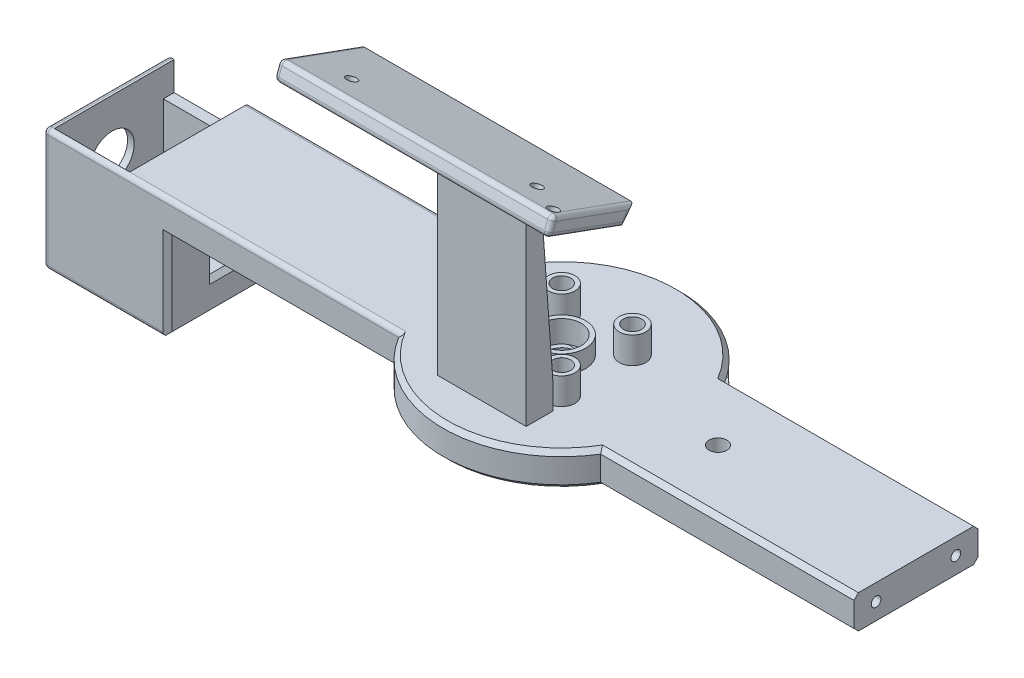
ISO-10303-21;
HEADER;
FILE_DESCRIPTION(('STEP AP214'),'2;1');
FILE_NAME('part.step','',(''),(''),'','','');
FILE_SCHEMA(('AUTOMOTIVE_DESIGN { 1 0 10303 214 1 1 1 1 }'));
ENDSEC;
DATA;
#1=APPLICATION_CONTEXT('core data for automotive mechanical design processes');
#2=APPLICATION_PROTOCOL_DEFINITION('international standard','automotive_design',2000,#1);
#3=PRODUCT_CONTEXT('',#1,'mechanical');
#4=PRODUCT('Part','Part','',(#3));
#5=PRODUCT_RELATED_PRODUCT_CATEGORY('part','',(#4));
#6=PRODUCT_DEFINITION_FORMATION('','',#4);
#7=PRODUCT_DEFINITION_CONTEXT('part definition',#1,'design');
#8=PRODUCT_DEFINITION('design','',#6,#7);
#9=PRODUCT_DEFINITION_SHAPE('','',#8);
#10=(LENGTH_UNIT() NAMED_UNIT(*) SI_UNIT(.MILLI.,.METRE.));
#11=(NAMED_UNIT(*) PLANE_ANGLE_UNIT() SI_UNIT($,.RADIAN.));
#12=(NAMED_UNIT(*) SI_UNIT($,.STERADIAN.) SOLID_ANGLE_UNIT());
#13=UNCERTAINTY_MEASURE_WITH_UNIT(LENGTH_MEASURE(1.E-05),#10,'distance_accuracy_value','');
#14=(GEOMETRIC_REPRESENTATION_CONTEXT(3) GLOBAL_UNCERTAINTY_ASSIGNED_CONTEXT((#13)) GLOBAL_UNIT_ASSIGNED_CONTEXT((#10,
#11,#12)) REPRESENTATION_CONTEXT('',''));
#15=CARTESIAN_POINT('',(0.,0.,0.));
#16=DIRECTION('',(0.,0.,1.));
#17=DIRECTION('',(1.,0.,0.));
#18=AXIS2_PLACEMENT_3D('',#15,#16,#17);
#19=CARTESIAN_POINT('',(-84.5,7.5,13.));
#20=DIRECTION('',(1.,0.,0.));
#21=DIRECTION('',(0.,0.,-1.));
#22=AXIS2_PLACEMENT_3D('',#19,#20,#21);
#23=PLANE('',#22);
#24=CARTESIAN_POINT('',(-84.5,-4.5,0.));
#25=DIRECTION('',(1.,0.,0.));
#26=DIRECTION('',(0.,0.,-1.));
#27=AXIS2_PLACEMENT_3D('',#24,#25,#26);
#28=CIRCLE('',#27,2.1);
#29=CARTESIAN_POINT('',(-84.5,-4.5,-2.1));
#30=VERTEX_POINT('',#29);
#31=EDGE_CURVE('E637',#30,#30,#28,.F.);
#32=ORIENTED_EDGE('',*,*,#31,.F.);
#33=EDGE_LOOP('',(#32));
#34=FACE_BOUND('',#33,.T.);
#35=DIRECTION('',(0.,1.,0.));
#36=VECTOR('',#35,1.);
#37=CARTESIAN_POINT('',(-84.5,1.02730080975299,-11.5740710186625));
#38=LINE('',#37,#36);
#39=CARTESIAN_POINT('',(-84.5,-20.,-11.5740710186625));
#40=VERTEX_POINT('',#39);
#41=CARTESIAN_POINT('',(-84.5,1.02730080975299,-11.5740710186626));
#42=VERTEX_POINT('',#41);
#43=EDGE_CURVE('E57',#40,#42,#38,.T.);
#44=ORIENTED_EDGE('',*,*,#43,.F.);
#45=DIRECTION('',(0.,0.,-1.));
#46=VECTOR('',#45,1.);
#47=CARTESIAN_POINT('',(-84.5,-20.,13.));
#48=LINE('',#47,#46);
#49=CARTESIAN_POINT('',(-84.5,-20.,13.));
#50=VERTEX_POINT('',#49);
#51=EDGE_CURVE('E632',#50,#40,#48,.T.);
#52=ORIENTED_EDGE('',*,*,#51,.F.);
#53=DIRECTION('',(0.,-1.,0.));
#54=VECTOR('',#53,1.);
#55=CARTESIAN_POINT('',(-84.5,7.5,13.));
#56=LINE('',#55,#54);
#57=CARTESIAN_POINT('',(-84.5,7.5,13.));
#58=VERTEX_POINT('',#57);
#59=EDGE_CURVE('E619',#58,#50,#56,.T.);
#60=ORIENTED_EDGE('',*,*,#59,.F.);
#61=DIRECTION('',(0.,0.,-1.));
#62=VECTOR('',#61,1.);
#63=CARTESIAN_POINT('',(-84.5,7.5,13.));
#64=LINE('',#63,#62);
#65=CARTESIAN_POINT('',(-84.5,7.5,-13.));
#66=VERTEX_POINT('',#65);
#67=EDGE_CURVE('E634',#58,#66,#64,.T.);
#68=ORIENTED_EDGE('',*,*,#67,.T.);
#69=CARTESIAN_POINT('',(-84.5,6.5,-13.));
#70=DIRECTION('',(1.,0.,0.));
#71=DIRECTION('',(0.,0.,-1.));
#72=AXIS2_PLACEMENT_3D('',#69,#70,#71);
#73=CIRCLE('',#72,1.);
#74=CARTESIAN_POINT('',(-84.5,6.49999999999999,-14.));
#75=VERTEX_POINT('',#74);
#76=EDGE_CURVE('E1399',#66,#75,#73,.F.);
#77=ORIENTED_EDGE('',*,*,#76,.T.);
#78=DIRECTION('',(0.,0.,-1.));
#79=VECTOR('',#78,1.);
#80=CARTESIAN_POINT('',(-84.5,6.49999999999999,-20.7566453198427));
#81=LINE('',#80,#79);
#82=CARTESIAN_POINT('',(-84.5,6.49999999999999,-3.75664531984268));
#83=VERTEX_POINT('',#82);
#84=EDGE_CURVE('E567',#83,#75,#81,.T.);
#85=ORIENTED_EDGE('',*,*,#84,.F.);
#86=DIRECTION('',(0.,1.,0.));
#87=VECTOR('',#86,1.);
#88=CARTESIAN_POINT('',(-84.5,6.49999999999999,-3.75664531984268));
#89=LINE('',#88,#87);
#90=CARTESIAN_POINT('',(-84.5,1.02730080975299,-3.75664531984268));
#91=VERTEX_POINT('',#90);
#92=EDGE_CURVE('E563',#91,#83,#89,.T.);
#93=ORIENTED_EDGE('',*,*,#92,.F.);
#94=DIRECTION('',(0.,0.,-1.));
#95=VECTOR('',#94,1.);
#96=CARTESIAN_POINT('',(-84.5,1.02730080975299,13.));
#97=LINE('',#96,#95);
#98=EDGE_CURVE('E62',#91,#42,#97,.T.);
#99=ORIENTED_EDGE('',*,*,#98,.T.);
#100=EDGE_LOOP('',(#44,#52,#60,#68,#77,#85,#93,#99));
#101=FACE_BOUND('',#100,.T.);
#102=ADVANCED_FACE('F39',(#34,#101),#23,.F.);
#103=CARTESIAN_POINT('',(-101.5,7.5,13.));
#104=DIRECTION('',(-1.,0.,0.));
#105=DIRECTION('',(0.,0.,1.));
#106=AXIS2_PLACEMENT_3D('',#103,#104,#105);
#107=PLANE('',#106);
#108=CARTESIAN_POINT('',(-101.5,-4.5,0.));
#109=DIRECTION('',(-1.,0.,0.));
#110=DIRECTION('',(0.,0.,1.));
#111=AXIS2_PLACEMENT_3D('',#108,#109,#110);
#112=CIRCLE('',#111,5.);
#113=CARTESIAN_POINT('',(-101.5,-4.5,5.));
#114=VERTEX_POINT('',#113);
#115=EDGE_CURVE('E618',#114,#114,#112,.T.);
#116=ORIENTED_EDGE('',*,*,#115,.T.);
#117=EDGE_LOOP('',(#116));
#118=FACE_BOUND('',#117,.T.);
#119=DIRECTION('',(0.,1.,0.));
#120=VECTOR('',#119,1.);
#121=CARTESIAN_POINT('',(-101.5,1.02730080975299,-11.5740710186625));
#122=LINE('',#121,#120);
#123=CARTESIAN_POINT('',(-101.5,-20.,-11.5740710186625));
#124=VERTEX_POINT('',#123);
#125=CARTESIAN_POINT('',(-101.5,1.02730080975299,-11.5740710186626));
#126=VERTEX_POINT('',#125);
#127=EDGE_CURVE('E500',#124,#126,#122,.T.);
#128=ORIENTED_EDGE('',*,*,#127,.T.);
#129=DIRECTION('',(0.,0.,-1.));
#130=VECTOR('',#129,1.);
#131=CARTESIAN_POINT('',(-101.5,1.02730080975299,-14.));
#132=LINE('',#131,#130);
#133=CARTESIAN_POINT('',(-101.5,1.02730080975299,-14.));
#134=VERTEX_POINT('',#133);
#135=EDGE_CURVE('E502',#126,#134,#132,.T.);
#136=ORIENTED_EDGE('',*,*,#135,.T.);
#137=DIRECTION('',(0.,1.,0.));
#138=VECTOR('',#137,1.);
#139=CARTESIAN_POINT('',(-101.5,7.5,-14.));
#140=LINE('',#139,#138);
#141=CARTESIAN_POINT('',(-101.5,7.5,-14.));
#142=VERTEX_POINT('',#141);
#143=EDGE_CURVE('E623',#134,#142,#140,.T.);
#144=ORIENTED_EDGE('',*,*,#143,.T.);
#145=DIRECTION('',(0.,0.,-1.));
#146=VECTOR('',#145,1.);
#147=CARTESIAN_POINT('',(-101.5,7.5,13.));
#148=LINE('',#147,#146);
#149=CARTESIAN_POINT('',(-101.5,7.5,13.));
#150=VERTEX_POINT('',#149);
#151=EDGE_CURVE('E638',#150,#142,#148,.T.);
#152=ORIENTED_EDGE('',*,*,#151,.F.);
#153=DIRECTION('',(0.,1.,0.));
#154=VECTOR('',#153,1.);
#155=CARTESIAN_POINT('',(-101.5,7.5,13.));
#156=LINE('',#155,#154);
#157=CARTESIAN_POINT('',(-101.5,-20.,13.));
#158=VERTEX_POINT('',#157);
#159=EDGE_CURVE('E626',#158,#150,#156,.T.);
#160=ORIENTED_EDGE('',*,*,#159,.F.);
#161=DIRECTION('',(0.,0.,-1.));
#162=VECTOR('',#161,1.);
#163=CARTESIAN_POINT('',(-101.5,-20.,13.));
#164=LINE('',#163,#162);
#165=EDGE_CURVE('E641',#158,#124,#164,.T.);
#166=ORIENTED_EDGE('',*,*,#165,.T.);
#167=EDGE_LOOP('',(#128,#136,#144,#152,#160,#166));
#168=FACE_BOUND('',#167,.T.);
#169=ADVANCED_FACE('F1080',(#118,#168),#107,.F.);
#170=CARTESIAN_POINT('',(0.,7.5,0.));
#171=DIRECTION('',(0.,1.,0.));
#172=DIRECTION('',(0.,0.,1.));
#173=AXIS2_PLACEMENT_3D('',#170,#171,#172);
#174=PLANE('',#173);
#175=CARTESIAN_POINT('',(0.,7.5,0.));
#176=DIRECTION('',(0.,1.,0.));
#177=DIRECTION('',(0.,0.,1.));
#178=AXIS2_PLACEMENT_3D('',#175,#176,#177);
#179=CIRCLE('',#178,5.4);
#180=CARTESIAN_POINT('',(0.,7.5,5.4));
#181=VERTEX_POINT('',#180);
#182=EDGE_CURVE('E728',#181,#181,#179,.T.);
#183=ORIENTED_EDGE('',*,*,#182,.F.);
#184=EDGE_LOOP('',(#183));
#185=FACE_BOUND('',#184,.T.);
#186=CARTESIAN_POINT('',(8.,7.5,8.));
#187=DIRECTION('',(0.,1.,0.));
#188=DIRECTION('',(0.,0.,1.));
#189=AXIS2_PLACEMENT_3D('',#186,#187,#188);
#190=CIRCLE('',#189,3.);
#191=CARTESIAN_POINT('',(8.,7.5,11.));
#192=VERTEX_POINT('',#191);
#193=EDGE_CURVE('E735',#192,#192,#190,.T.);
#194=ORIENTED_EDGE('',*,*,#193,.F.);
#195=EDGE_LOOP('',(#194));
#196=FACE_BOUND('',#195,.T.);
#197=CARTESIAN_POINT('',(-8.,7.5,8.));
#198=DIRECTION('',(0.,1.,0.));
#199=DIRECTION('',(0.,0.,1.));
#200=AXIS2_PLACEMENT_3D('',#197,#198,#199);
#201=CIRCLE('',#200,3.);
#202=CARTESIAN_POINT('',(-8.,7.5,11.));
#203=VERTEX_POINT('',#202);
#204=EDGE_CURVE('E744',#203,#203,#201,.T.);
#205=ORIENTED_EDGE('',*,*,#204,.F.);
#206=EDGE_LOOP('',(#205));
#207=FACE_BOUND('',#206,.T.);
#208=CARTESIAN_POINT('',(8.,7.5,-8.));
#209=DIRECTION('',(0.,1.,0.));
#210=DIRECTION('',(0.,0.,1.));
#211=AXIS2_PLACEMENT_3D('',#208,#209,#210);
#212=CIRCLE('',#211,3.);
#213=CARTESIAN_POINT('',(8.,7.5,-5.));
#214=VERTEX_POINT('',#213);
#215=EDGE_CURVE('E753',#214,#214,#212,.T.);
#216=ORIENTED_EDGE('',*,*,#215,.F.);
#217=EDGE_LOOP('',(#216));
#218=FACE_BOUND('',#217,.T.);
#219=CARTESIAN_POINT('',(-8.,7.5,-8.));
#220=DIRECTION('',(0.,1.,0.));
#221=DIRECTION('',(0.,0.,1.));
#222=AXIS2_PLACEMENT_3D('',#219,#220,#221);
#223=CIRCLE('',#222,3.);
#224=CARTESIAN_POINT('',(-8.,7.5,-5.));
#225=VERTEX_POINT('',#224);
#226=EDGE_CURVE('E764',#225,#225,#223,.T.);
#227=ORIENTED_EDGE('',*,*,#226,.F.);
#228=EDGE_LOOP('',(#227));
#229=FACE_BOUND('',#228,.T.);
#230=CARTESIAN_POINT('',(35.3024782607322,7.5,0.));
#231=DIRECTION('',(0.,1.,0.));
#232=DIRECTION('',(0.,0.,1.));
#233=AXIS2_PLACEMENT_3D('',#230,#231,#232);
#234=CIRCLE('',#233,2.);
#235=CARTESIAN_POINT('',(35.3024782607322,7.5,2.));
#236=VERTEX_POINT('',#235);
#237=EDGE_CURVE('E719',#236,#236,#234,.T.);
#238=ORIENTED_EDGE('',*,*,#237,.F.);
#239=EDGE_LOOP('',(#238));
#240=FACE_BOUND('',#239,.T.);
#241=DIRECTION('',(0.,0.,-1.));
#242=VECTOR('',#241,1.);
#243=CARTESIAN_POINT('',(10.,7.5,12.));
#244=LINE('',#243,#242);
#245=CARTESIAN_POINT('',(10.,7.5,18.));
#246=VERTEX_POINT('',#245);
#247=CARTESIAN_POINT('',(10.,7.5,12.));
#248=VERTEX_POINT('',#247);
#249=EDGE_CURVE('E699',#246,#248,#244,.T.);
#250=ORIENTED_EDGE('',*,*,#249,.F.);
#251=DIRECTION('',(1.,0.,0.));
#252=VECTOR('',#251,1.);
#253=CARTESIAN_POINT('',(-10.,7.5,18.));
#254=LINE('',#253,#252);
#255=CARTESIAN_POINT('',(-10.,7.5,18.));
#256=VERTEX_POINT('',#255);
#257=EDGE_CURVE('E692',#256,#246,#254,.T.);
#258=ORIENTED_EDGE('',*,*,#257,.F.);
#259=DIRECTION('',(0.,0.,1.));
#260=VECTOR('',#259,1.);
#261=CARTESIAN_POINT('',(-10.,7.5,12.));
#262=LINE('',#261,#260);
#263=CARTESIAN_POINT('',(-10.,7.5,12.));
#264=VERTEX_POINT('',#263);
#265=EDGE_CURVE('E711',#264,#256,#262,.T.);
#266=ORIENTED_EDGE('',*,*,#265,.F.);
#267=DIRECTION('',(-1.,0.,0.));
#268=VECTOR('',#267,1.);
#269=CARTESIAN_POINT('',(-10.,7.5,12.));
#270=LINE('',#269,#268);
#271=EDGE_CURVE('E708',#248,#264,#270,.T.);
#272=ORIENTED_EDGE('',*,*,#271,.F.);
#273=EDGE_LOOP('',(#250,#258,#266,#272));
#274=FACE_BOUND('',#273,.T.);
#275=ORIENTED_EDGE('',*,*,#67,.F.);
#276=DIRECTION('',(-1.,0.,0.));
#277=VECTOR('',#276,1.);
#278=CARTESIAN_POINT('',(-21.6195462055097,7.5,13.));
#279=LINE('',#278,#277);
#280=CARTESIAN_POINT('',(-22.2352148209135,7.5,13.));
#281=VERTEX_POINT('',#280);
#282=EDGE_CURVE('E1385',#58,#281,#279,.F.);
#283=ORIENTED_EDGE('',*,*,#282,.T.);
#284=CARTESIAN_POINT('',(0.,7.5,0.));
#285=DIRECTION('',(0.,1.,0.));
#286=DIRECTION('',(0.,0.,1.));
#287=AXIS2_PLACEMENT_3D('',#284,#285,#286);
#288=CIRCLE('',#287,25.7566453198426);
#289=CARTESIAN_POINT('',(22.2352148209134,7.5,13.));
#290=VERTEX_POINT('',#289);
#291=EDGE_CURVE('E853',#281,#290,#288,.T.);
#292=ORIENTED_EDGE('',*,*,#291,.T.);
#293=DIRECTION('',(1.,0.,0.));
#294=VECTOR('',#293,1.);
#295=CARTESIAN_POINT('',(80.,7.5,13.));
#296=LINE('',#295,#294);
#297=CARTESIAN_POINT('',(80.,7.5,13.));
#298=VERTEX_POINT('',#297);
#299=EDGE_CURVE('E851',#290,#298,#296,.T.);
#300=ORIENTED_EDGE('',*,*,#299,.T.);
#301=DIRECTION('',(0.,0.,1.));
#302=VECTOR('',#301,1.);
#303=CARTESIAN_POINT('',(80.,7.5,-14.));
#304=LINE('',#303,#302);
#305=CARTESIAN_POINT('',(80.,7.5,-13.));
#306=VERTEX_POINT('',#305);
#307=EDGE_CURVE('E821',#306,#298,#304,.T.);
#308=ORIENTED_EDGE('',*,*,#307,.F.);
#309=DIRECTION('',(-1.,0.,0.));
#310=VECTOR('',#309,1.);
#311=CARTESIAN_POINT('',(0.,7.5,-13.));
#312=LINE('',#311,#310);
#313=CARTESIAN_POINT('',(22.2352148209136,7.5,-13.));
#314=VERTEX_POINT('',#313);
#315=EDGE_CURVE('E849',#306,#314,#312,.T.);
#316=ORIENTED_EDGE('',*,*,#315,.T.);
#317=CARTESIAN_POINT('',(0.,7.5,0.));
#318=DIRECTION('',(0.,1.,0.));
#319=DIRECTION('',(0.,0.,1.));
#320=AXIS2_PLACEMENT_3D('',#317,#318,#319);
#321=CIRCLE('',#320,25.7566453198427);
#322=CARTESIAN_POINT('',(-22.2352148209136,7.5,-13.));
#323=VERTEX_POINT('',#322);
#324=EDGE_CURVE('E845',#314,#323,#321,.T.);
#325=ORIENTED_EDGE('',*,*,#324,.T.);
#326=DIRECTION('',(1.,0.,0.));
#327=VECTOR('',#326,1.);
#328=CARTESIAN_POINT('',(-84.5,7.5,-13.));
#329=LINE('',#328,#327);
#330=EDGE_CURVE('E1383',#323,#66,#329,.F.);
#331=ORIENTED_EDGE('',*,*,#330,.T.);
#332=EDGE_LOOP('',(#275,#283,#292,#300,#308,#316,#325,#331));
#333=FACE_BOUND('',#332,.T.);
#334=ADVANCED_FACE('F1087',(#185,#196,#207,#218,#229,#240,#274,#333),#174,.T.);
#335=CARTESIAN_POINT('',(25.5,6.49999999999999,-20.7566453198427));
#336=DIRECTION('',(0.,1.,0.));
#337=DIRECTION('',(0.,0.,1.));
#338=AXIS2_PLACEMENT_3D('',#335,#336,#337);
#339=PLANE('',#338);
#340=DIRECTION('',(0.,0.,-1.));
#341=VECTOR('',#340,1.);
#342=CARTESIAN_POINT('',(-44.2177819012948,6.49999999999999,-20.7566453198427));
#343=LINE('',#342,#341);
#344=CARTESIAN_POINT('',(-44.2177819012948,6.49999999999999,-13.));
#345=VERTEX_POINT('',#344);
#346=CARTESIAN_POINT('',(-44.2177819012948,6.49999999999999,-14.));
#347=VERTEX_POINT('',#346);
#348=EDGE_CURVE('E534',#345,#347,#343,.T.);
#349=ORIENTED_EDGE('',*,*,#348,.F.);
#350=DIRECTION('',(-1.,0.,0.));
#351=VECTOR('',#350,1.);
#352=CARTESIAN_POINT('',(25.5,6.49999999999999,-13.));
#353=LINE('',#352,#351);
#354=CARTESIAN_POINT('',(-34.2177819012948,6.49999999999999,-13.));
#355=VERTEX_POINT('',#354);
#356=EDGE_CURVE('E537',#355,#345,#353,.T.);
#357=ORIENTED_EDGE('',*,*,#356,.F.);
#358=DIRECTION('',(0.,0.,1.));
#359=VECTOR('',#358,1.);
#360=CARTESIAN_POINT('',(-34.2177819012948,6.49999999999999,-20.7566453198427));
#361=LINE('',#360,#359);
#362=CARTESIAN_POINT('',(-34.2177819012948,6.49999999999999,-14.));
#363=VERTEX_POINT('',#362);
#364=EDGE_CURVE('E532',#363,#355,#361,.T.);
#365=ORIENTED_EDGE('',*,*,#364,.F.);
#366=DIRECTION('',(-1.,0.,0.));
#367=VECTOR('',#366,1.);
#368=CARTESIAN_POINT('',(-50.,6.49999999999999,-14.));
#369=LINE('',#368,#367);
#370=CARTESIAN_POINT('',(-22.8017119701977,6.49999999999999,-14.));
#371=VERTEX_POINT('',#370);
#372=EDGE_CURVE('E605',#371,#363,#369,.T.);
#373=ORIENTED_EDGE('',*,*,#372,.F.);
#374=CARTESIAN_POINT('',(0.,6.49999999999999,0.));
#375=DIRECTION('',(0.,1.,0.));
#376=DIRECTION('',(0.,0.,1.));
#377=AXIS2_PLACEMENT_3D('',#374,#375,#376);
#378=CIRCLE('',#377,26.7566453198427);
#379=CARTESIAN_POINT('',(-16.8843046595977,6.49999999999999,-20.7566453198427));
#380=VERTEX_POINT('',#379);
#381=EDGE_CURVE('E882',#371,#380,#378,.F.);
#382=ORIENTED_EDGE('',*,*,#381,.T.);
#383=DIRECTION('',(-1.,0.,0.));
#384=VECTOR('',#383,1.);
#385=CARTESIAN_POINT('',(25.5,6.49999999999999,-20.7566453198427));
#386=LINE('',#385,#384);
#387=CARTESIAN_POINT('',(16.8843046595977,6.49999999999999,-20.7566453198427));
#388=VERTEX_POINT('',#387);
#389=EDGE_CURVE('E578',#388,#380,#386,.T.);
#390=ORIENTED_EDGE('',*,*,#389,.F.);
#391=CARTESIAN_POINT('',(0.,6.49999999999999,0.));
#392=DIRECTION('',(0.,1.,0.));
#393=DIRECTION('',(0.,0.,1.));
#394=AXIS2_PLACEMENT_3D('',#391,#392,#393);
#395=CIRCLE('',#394,26.7566453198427);
#396=CARTESIAN_POINT('',(22.8017119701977,6.49999999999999,-14.));
#397=VERTEX_POINT('',#396);
#398=EDGE_CURVE('E602',#388,#397,#395,.F.);
#399=ORIENTED_EDGE('',*,*,#398,.T.);
#400=DIRECTION('',(1.,0.,0.));
#401=VECTOR('',#400,1.);
#402=CARTESIAN_POINT('',(22.8017119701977,6.49999999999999,-14.));
#403=LINE('',#402,#401);
#404=CARTESIAN_POINT('',(26.5,6.49999999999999,-14.));
#405=VERTEX_POINT('',#404);
#406=EDGE_CURVE('E876',#397,#405,#403,.T.);
#407=ORIENTED_EDGE('',*,*,#406,.T.);
#408=CARTESIAN_POINT('',(26.5,6.49999999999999,-13.));
#409=DIRECTION('',(0.,1.,0.));
#410=DIRECTION('',(0.,0.,1.));
#411=AXIS2_PLACEMENT_3D('',#408,#409,#410);
#412=CIRCLE('',#411,1.);
#413=CARTESIAN_POINT('',(25.5,6.49999999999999,-13.));
#414=VERTEX_POINT('',#413);
#415=EDGE_CURVE('E1035',#405,#414,#412,.T.);
#416=ORIENTED_EDGE('',*,*,#415,.T.);
#417=DIRECTION('',(0.,0.,-1.));
#418=VECTOR('',#417,1.);
#419=CARTESIAN_POINT('',(25.5,6.49999999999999,-20.7566453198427));
#420=LINE('',#419,#418);
#421=CARTESIAN_POINT('',(25.5,6.49999999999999,-3.75664531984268));
#422=VERTEX_POINT('',#421);
#423=EDGE_CURVE('E570',#422,#414,#420,.T.);
#424=ORIENTED_EDGE('',*,*,#423,.F.);
#425=DIRECTION('',(-1.,0.,0.));
#426=VECTOR('',#425,1.);
#427=CARTESIAN_POINT('',(25.5,6.49999999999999,-3.75664531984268));
#428=LINE('',#427,#426);
#429=CARTESIAN_POINT('',(2.29076754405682,6.49999999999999,-3.75664531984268));
#430=VERTEX_POINT('',#429);
#431=EDGE_CURVE('E582',#422,#430,#428,.T.);
#432=ORIENTED_EDGE('',*,*,#431,.T.);
#433=CARTESIAN_POINT('',(0.,6.5,0.));
#434=DIRECTION('',(0.,1.,0.));
#435=DIRECTION('',(0.,0.,1.));
#436=AXIS2_PLACEMENT_3D('',#433,#434,#435);
#437=CIRCLE('',#436,4.4);
#438=CARTESIAN_POINT('',(-2.29076754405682,6.5,-3.75664531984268));
#439=VERTEX_POINT('',#438);
#440=EDGE_CURVE('E791',#430,#439,#437,.T.);
#441=ORIENTED_EDGE('',*,*,#440,.T.);
#442=EDGE_CURVE('E586',#439,#83,#428,.T.);
#443=ORIENTED_EDGE('',*,*,#442,.T.);
#444=ORIENTED_EDGE('',*,*,#84,.T.);
#445=CARTESIAN_POINT('',(-75.3933875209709,6.49999999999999,-14.));
#446=VERTEX_POINT('',#445);
#447=EDGE_CURVE('E604',#446,#75,#369,.T.);
#448=ORIENTED_EDGE('',*,*,#447,.F.);
#449=DIRECTION('',(0.,0.,-1.));
#450=VECTOR('',#449,1.);
#451=CARTESIAN_POINT('',(-75.3933875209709,6.49999999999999,-20.7566453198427));
#452=LINE('',#451,#450);
#453=CARTESIAN_POINT('',(-75.3933875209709,6.49999999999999,-13.));
#454=VERTEX_POINT('',#453);
#455=EDGE_CURVE('E560',#454,#446,#452,.T.);
#456=ORIENTED_EDGE('',*,*,#455,.F.);
#457=DIRECTION('',(-1.,0.,0.));
#458=VECTOR('',#457,1.);
#459=CARTESIAN_POINT('',(25.5,6.49999999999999,-13.));
#460=LINE('',#459,#458);
#461=CARTESIAN_POINT('',(-65.3933875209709,6.49999999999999,-13.));
#462=VERTEX_POINT('',#461);
#463=EDGE_CURVE('E558',#462,#454,#460,.T.);
#464=ORIENTED_EDGE('',*,*,#463,.F.);
#465=DIRECTION('',(0.,0.,1.));
#466=VECTOR('',#465,1.);
#467=CARTESIAN_POINT('',(-65.3933875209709,6.49999999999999,-20.7566453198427));
#468=LINE('',#467,#466);
#469=CARTESIAN_POINT('',(-65.3933875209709,6.49999999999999,-14.));
#470=VERTEX_POINT('',#469);
#471=EDGE_CURVE('E556',#470,#462,#468,.T.);
#472=ORIENTED_EDGE('',*,*,#471,.F.);
#473=EDGE_CURVE('E609',#347,#470,#369,.T.);
#474=ORIENTED_EDGE('',*,*,#473,.F.);
#475=EDGE_LOOP('',(#349,#357,#365,#373,#382,#390,#399,#407,#416,#424,#432,#441,#443,#444,#448,
#456,#464,#472,#474));
#476=FACE_BOUND('',#475,.T.);
#477=ADVANCED_FACE('F1649',(#476),#339,.F.);
#478=CARTESIAN_POINT('',(25.5,1.02730080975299,-20.7566453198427));
#479=DIRECTION('',(0.,-1.,0.));
#480=DIRECTION('',(0.,0.,-1.));
#481=AXIS2_PLACEMENT_3D('',#478,#479,#480);
#482=PLANE('',#481);
#483=DIRECTION('',(0.,0.,1.));
#484=VECTOR('',#483,1.);
#485=CARTESIAN_POINT('',(-44.2177819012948,1.02730080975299,-14.));
#486=LINE('',#485,#484);
#487=CARTESIAN_POINT('',(-44.2177819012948,1.02730080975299,-14.));
#488=VERTEX_POINT('',#487);
#489=CARTESIAN_POINT('',(-44.2177819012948,1.02730080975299,-13.));
#490=VERTEX_POINT('',#489);
#491=EDGE_CURVE('E529',#488,#490,#486,.T.);
#492=ORIENTED_EDGE('',*,*,#491,.F.);
#493=DIRECTION('',(1.,0.,0.));
#494=VECTOR('',#493,1.);
#495=CARTESIAN_POINT('',(-50.,1.02730080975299,-14.));
#496=LINE('',#495,#494);
#497=CARTESIAN_POINT('',(-65.3933875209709,1.02730080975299,-14.));
#498=VERTEX_POINT('',#497);
#499=EDGE_CURVE('E599',#498,#488,#496,.T.);
#500=ORIENTED_EDGE('',*,*,#499,.F.);
#501=DIRECTION('',(0.,0.,-1.));
#502=VECTOR('',#501,1.);
#503=CARTESIAN_POINT('',(-65.3933875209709,1.02730080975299,-14.));
#504=LINE('',#503,#502);
#505=CARTESIAN_POINT('',(-65.3933875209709,1.02730080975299,-13.));
#506=VERTEX_POINT('',#505);
#507=EDGE_CURVE('E545',#506,#498,#504,.T.);
#508=ORIENTED_EDGE('',*,*,#507,.F.);
#509=DIRECTION('',(1.,0.,0.));
#510=VECTOR('',#509,1.);
#511=CARTESIAN_POINT('',(-75.3933875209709,1.02730080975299,-13.));
#512=LINE('',#511,#510);
#513=CARTESIAN_POINT('',(-75.3933875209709,1.02730080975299,-13.));
#514=VERTEX_POINT('',#513);
#515=EDGE_CURVE('E542',#514,#506,#512,.T.);
#516=ORIENTED_EDGE('',*,*,#515,.F.);
#517=DIRECTION('',(0.,0.,1.));
#518=VECTOR('',#517,1.);
#519=CARTESIAN_POINT('',(-75.3933875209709,1.02730080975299,-14.));
#520=LINE('',#519,#518);
#521=CARTESIAN_POINT('',(-75.3933875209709,1.02730080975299,-14.));
#522=VERTEX_POINT('',#521);
#523=EDGE_CURVE('E539',#522,#514,#520,.T.);
#524=ORIENTED_EDGE('',*,*,#523,.F.);
#525=EDGE_CURVE('E596',#134,#522,#496,.T.);
#526=ORIENTED_EDGE('',*,*,#525,.F.);
#527=ORIENTED_EDGE('',*,*,#135,.F.);
#528=DIRECTION('',(1.,0.,0.));
#529=VECTOR('',#528,1.);
#530=CARTESIAN_POINT('',(-101.5,1.02730080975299,-11.5740710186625));
#531=LINE('',#530,#529);
#532=EDGE_CURVE('E507',#126,#42,#531,.T.);
#533=ORIENTED_EDGE('',*,*,#532,.T.);
#534=ORIENTED_EDGE('',*,*,#98,.F.);
#535=DIRECTION('',(-1.,0.,0.));
#536=VECTOR('',#535,1.);
#537=CARTESIAN_POINT('',(25.5,1.02730080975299,-3.75664531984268));
#538=LINE('',#537,#536);
#539=CARTESIAN_POINT('',(25.5,1.02730080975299,-3.75664531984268));
#540=VERTEX_POINT('',#539);
#541=EDGE_CURVE('E587',#540,#91,#538,.T.);
#542=ORIENTED_EDGE('',*,*,#541,.F.);
#543=DIRECTION('',(0.,0.,1.));
#544=VECTOR('',#543,1.);
#545=CARTESIAN_POINT('',(25.5,1.02730080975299,-20.7566453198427));
#546=LINE('',#545,#544);
#547=CARTESIAN_POINT('',(25.5,1.02730080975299,-13.));
#548=VERTEX_POINT('',#547);
#549=EDGE_CURVE('E564',#548,#540,#546,.T.);
#550=ORIENTED_EDGE('',*,*,#549,.F.);
#551=CARTESIAN_POINT('',(26.5,1.02730080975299,-13.));
#552=DIRECTION('',(0.,-1.,0.));
#553=DIRECTION('',(0.,0.,-1.));
#554=AXIS2_PLACEMENT_3D('',#551,#552,#553);
#555=CIRCLE('',#554,1.);
#556=CARTESIAN_POINT('',(26.5,1.02730080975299,-14.));
#557=VERTEX_POINT('',#556);
#558=EDGE_CURVE('E1041',#548,#557,#555,.T.);
#559=ORIENTED_EDGE('',*,*,#558,.T.);
#560=DIRECTION('',(-1.,0.,0.));
#561=VECTOR('',#560,1.);
#562=CARTESIAN_POINT('',(22.8017119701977,1.02730080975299,-14.));
#563=LINE('',#562,#561);
#564=CARTESIAN_POINT('',(22.8017119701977,1.02730080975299,-14.));
#565=VERTEX_POINT('',#564);
#566=EDGE_CURVE('E600',#557,#565,#563,.T.);
#567=ORIENTED_EDGE('',*,*,#566,.T.);
#568=CARTESIAN_POINT('',(0.,1.02730080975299,0.));
#569=DIRECTION('',(0.,-1.,0.));
#570=DIRECTION('',(0.,0.,-1.));
#571=AXIS2_PLACEMENT_3D('',#568,#569,#570);
#572=CIRCLE('',#571,26.7566453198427);
#573=CARTESIAN_POINT('',(16.8843046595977,1.02730080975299,-20.7566453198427));
#574=VERTEX_POINT('',#573);
#575=EDGE_CURVE('E595',#574,#565,#572,.T.);
#576=ORIENTED_EDGE('',*,*,#575,.F.);
#577=DIRECTION('',(-1.,0.,0.));
#578=VECTOR('',#577,1.);
#579=CARTESIAN_POINT('',(25.5,1.02730080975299,-20.7566453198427));
#580=LINE('',#579,#578);
#581=CARTESIAN_POINT('',(-16.8843046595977,1.02730080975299,-20.7566453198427));
#582=VERTEX_POINT('',#581);
#583=EDGE_CURVE('E573',#574,#582,#580,.T.);
#584=ORIENTED_EDGE('',*,*,#583,.T.);
#585=CARTESIAN_POINT('',(-22.8017119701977,1.02730080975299,-14.));
#586=VERTEX_POINT('',#585);
#587=EDGE_CURVE('E581',#586,#582,#572,.T.);
#588=ORIENTED_EDGE('',*,*,#587,.F.);
#589=CARTESIAN_POINT('',(-34.2177819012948,1.02730080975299,-14.));
#590=VERTEX_POINT('',#589);
#591=EDGE_CURVE('E594',#590,#586,#496,.T.);
#592=ORIENTED_EDGE('',*,*,#591,.F.);
#593=DIRECTION('',(0.,0.,-1.));
#594=VECTOR('',#593,1.);
#595=CARTESIAN_POINT('',(-34.2177819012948,1.02730080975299,-14.));
#596=LINE('',#595,#594);
#597=CARTESIAN_POINT('',(-34.2177819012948,1.02730080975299,-13.));
#598=VERTEX_POINT('',#597);
#599=EDGE_CURVE('E524',#598,#590,#596,.T.);
#600=ORIENTED_EDGE('',*,*,#599,.F.);
#601=DIRECTION('',(1.,0.,0.));
#602=VECTOR('',#601,1.);
#603=CARTESIAN_POINT('',(-44.2177819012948,1.02730080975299,-13.));
#604=LINE('',#603,#602);
#605=EDGE_CURVE('E526',#490,#598,#604,.T.);
#606=ORIENTED_EDGE('',*,*,#605,.F.);
#607=EDGE_LOOP('',(#492,#500,#508,#516,#524,#526,#527,#533,#534,#542,#550,#559,#567,#576,#584,
#588,#592,#600,#606));
#608=FACE_BOUND('',#607,.T.);
#609=ADVANCED_FACE('F1161',(#608),#482,.F.);
#610=CARTESIAN_POINT('',(-10.,87.5,12.));
#611=DIRECTION('',(1.,0.,0.));
#612=DIRECTION('',(0.,0.,-1.));
#613=AXIS2_PLACEMENT_3D('',#610,#611,#612);
#614=PLANE('',#613);
#615=DIRECTION('',(0.,-0.79070670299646,0.61219515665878));
#616=VECTOR('',#615,1.);
#617=CARTESIAN_POINT('',(-10.,57.5,18.));
#618=LINE('',#617,#616);
#619=CARTESIAN_POINT('',(-10.,60.8208866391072,15.4288434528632));
#620=VERTEX_POINT('',#619);
#621=CARTESIAN_POINT('',(-10.,57.5,18.));
#622=VERTEX_POINT('',#621);
#623=EDGE_CURVE('E651',#620,#622,#618,.T.);
#624=ORIENTED_EDGE('',*,*,#623,.F.);
#625=DIRECTION('',(0.,-0.997359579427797,-0.072621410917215));
#626=VECTOR('',#625,1.);
#627=CARTESIAN_POINT('',(-10.,60.8208866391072,15.4288434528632));
#628=LINE('',#627,#626);
#629=CARTESIAN_POINT('',(-10.,13.7302308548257,12.));
#630=VERTEX_POINT('',#629);
#631=EDGE_CURVE('E688',#620,#630,#628,.T.);
#632=ORIENTED_EDGE('',*,*,#631,.T.);
#633=DIRECTION('',(0.,-1.,0.));
#634=VECTOR('',#633,1.);
#635=CARTESIAN_POINT('',(-10.,87.5,12.));
#636=LINE('',#635,#634);
#637=EDGE_CURVE('E714',#630,#264,#636,.T.);
#638=ORIENTED_EDGE('',*,*,#637,.T.);
#639=ORIENTED_EDGE('',*,*,#265,.T.);
#640=DIRECTION('',(0.,1.,0.));
#641=VECTOR('',#640,1.);
#642=CARTESIAN_POINT('',(-10.,7.5,18.));
#643=LINE('',#642,#641);
#644=EDGE_CURVE('E685',#256,#622,#643,.T.);
#645=ORIENTED_EDGE('',*,*,#644,.T.);
#646=EDGE_LOOP('',(#624,#632,#638,#639,#645));
#647=FACE_BOUND('',#646,.T.);
#648=ADVANCED_FACE('F1157',(#647),#614,.F.);
#649=CARTESIAN_POINT('',(10.,87.5,12.));
#650=DIRECTION('',(-1.,0.,0.));
#651=DIRECTION('',(0.,0.,1.));
#652=AXIS2_PLACEMENT_3D('',#649,#650,#651);
#653=PLANE('',#652);
#654=DIRECTION('',(0.,0.79070670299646,-0.61219515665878));
#655=VECTOR('',#654,1.);
#656=CARTESIAN_POINT('',(10.,60.8208866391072,15.4288434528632));
#657=LINE('',#656,#655);
#658=CARTESIAN_POINT('',(10.,57.5,18.));
#659=VERTEX_POINT('',#658);
#660=CARTESIAN_POINT('',(10.,60.8208866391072,15.4288434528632));
#661=VERTEX_POINT('',#660);
#662=EDGE_CURVE('E677',#659,#661,#657,.T.);
#663=ORIENTED_EDGE('',*,*,#662,.F.);
#664=DIRECTION('',(0.,1.,0.));
#665=VECTOR('',#664,1.);
#666=CARTESIAN_POINT('',(10.,7.5,18.));
#667=LINE('',#666,#665);
#668=EDGE_CURVE('E684',#246,#659,#667,.T.);
#669=ORIENTED_EDGE('',*,*,#668,.F.);
#670=ORIENTED_EDGE('',*,*,#249,.T.);
#671=DIRECTION('',(0.,-1.,0.));
#672=VECTOR('',#671,1.);
#673=CARTESIAN_POINT('',(10.,87.5,12.));
#674=LINE('',#673,#672);
#675=CARTESIAN_POINT('',(10.,13.7302308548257,12.));
#676=VERTEX_POINT('',#675);
#677=EDGE_CURVE('E716',#676,#248,#674,.T.);
#678=ORIENTED_EDGE('',*,*,#677,.F.);
#679=DIRECTION('',(0.,-0.997359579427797,-0.072621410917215));
#680=VECTOR('',#679,1.);
#681=CARTESIAN_POINT('',(10.,60.8208866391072,15.4288434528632));
#682=LINE('',#681,#680);
#683=EDGE_CURVE('E689',#661,#676,#682,.T.);
#684=ORIENTED_EDGE('',*,*,#683,.F.);
#685=EDGE_LOOP('',(#663,#669,#670,#678,#684));
#686=FACE_BOUND('',#685,.T.);
#687=ADVANCED_FACE('F1160',(#686),#653,.F.);
#688=DIRECTION('',(0.,0.,-1.));
#689=VECTOR('',#688,1.);
#690=CARTESIAN_POINT('',(-102.,7.5,0.));
#691=LINE('',#690,#689);
#692=CARTESIAN_POINT('',(-102.,7.5,-14.));
#693=VERTEX_POINT('',#692);
#694=CARTESIAN_POINT('',(-102.,7.5,13.));
#695=VERTEX_POINT('',#694);
#696=EDGE_CURVE('E1022',#693,#695,#691,.F.);
#697=ORIENTED_EDGE('',*,*,#696,.T.);
#698=DIRECTION('',(-1.,0.,0.));
#699=VECTOR('',#698,1.);
#700=CARTESIAN_POINT('',(-21.6195462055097,7.5,13.));
#701=LINE('',#700,#699);
#702=EDGE_CURVE('E1381',#695,#150,#701,.F.);
#703=ORIENTED_EDGE('',*,*,#702,.T.);
#704=ORIENTED_EDGE('',*,*,#151,.T.);
#705=DIRECTION('',(1.,0.,0.));
#706=VECTOR('',#705,1.);
#707=CARTESIAN_POINT('',(-50.,7.5,-14.));
#708=LINE('',#707,#706);
#709=EDGE_CURVE('E824',#693,#142,#708,.T.);
#710=ORIENTED_EDGE('',*,*,#709,.F.);
#711=EDGE_LOOP('',(#697,#703,#704,#710));
#712=FACE_BOUND('',#711,.T.);
#713=ADVANCED_FACE('F1169',(#712),#174,.T.);
#714=CARTESIAN_POINT('',(80.,7.5,-14.));
#715=DIRECTION('',(1.,0.,0.));
#716=DIRECTION('',(0.,0.,-1.));
#717=AXIS2_PLACEMENT_3D('',#714,#715,#716);
#718=PLANE('',#717);
#719=ORIENTED_EDGE('',*,*,#307,.T.);
#720=DIRECTION('',(0.,-0.707106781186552,0.707106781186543));
#721=VECTOR('',#720,1.);
#722=CARTESIAN_POINT('',(80.,21.,-0.49999999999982));
#723=LINE('',#722,#721);
#724=CARTESIAN_POINT('',(80.,6.49999999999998,14.));
#725=VERTEX_POINT('',#724);
#726=EDGE_CURVE('E866',#298,#725,#723,.T.);
#727=ORIENTED_EDGE('',*,*,#726,.T.);
#728=DIRECTION('',(0.,-1.,0.));
#729=VECTOR('',#728,1.);
#730=CARTESIAN_POINT('',(80.,7.5,14.));
#731=LINE('',#730,#729);
#732=CARTESIAN_POINT('',(80.,0.999999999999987,14.));
#733=VERTEX_POINT('',#732);
#734=EDGE_CURVE('E836',#725,#733,#731,.T.);
#735=ORIENTED_EDGE('',*,*,#734,.T.);
#736=DIRECTION('',(0.,0.707106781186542,0.707106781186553));
#737=VECTOR('',#736,1.);
#738=CARTESIAN_POINT('',(80.,-9.75000000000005,3.24999999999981));
#739=LINE('',#738,#737);
#740=CARTESIAN_POINT('',(80.,0.,13.));
#741=VERTEX_POINT('',#740);
#742=EDGE_CURVE('E860',#733,#741,#739,.F.);
#743=ORIENTED_EDGE('',*,*,#742,.T.);
#744=DIRECTION('',(0.,0.,1.));
#745=VECTOR('',#744,1.);
#746=CARTESIAN_POINT('',(80.,0.,-14.));
#747=LINE('',#746,#745);
#748=CARTESIAN_POINT('',(80.,0.,-13.));
#749=VERTEX_POINT('',#748);
#750=EDGE_CURVE('E485',#749,#741,#747,.T.);
#751=ORIENTED_EDGE('',*,*,#750,.F.);
#752=DIRECTION('',(0.,0.707106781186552,-0.707106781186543));
#753=VECTOR('',#752,1.);
#754=CARTESIAN_POINT('',(80.,4.25000000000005,-17.25));
#755=LINE('',#754,#753);
#756=CARTESIAN_POINT('',(80.,1.,-14.));
#757=VERTEX_POINT('',#756);
#758=EDGE_CURVE('E862',#749,#757,#755,.T.);
#759=ORIENTED_EDGE('',*,*,#758,.T.);
#760=DIRECTION('',(0.,-1.,0.));
#761=VECTOR('',#760,1.);
#762=CARTESIAN_POINT('',(80.,7.5,-14.));
#763=LINE('',#762,#761);
#764=CARTESIAN_POINT('',(80.,6.49999999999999,-14.));
#765=VERTEX_POINT('',#764);
#766=EDGE_CURVE('E833',#765,#757,#763,.T.);
#767=ORIENTED_EDGE('',*,*,#766,.F.);
#768=DIRECTION('',(0.,-0.70710678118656,-0.707106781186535));
#769=VECTOR('',#768,1.);
#770=CARTESIAN_POINT('',(80.,7.00000000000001,-13.5));
#771=LINE('',#770,#769);
#772=EDGE_CURVE('E864',#765,#306,#771,.F.);
#773=ORIENTED_EDGE('',*,*,#772,.T.);
#774=EDGE_LOOP('',(#719,#727,#735,#743,#751,#759,#767,#773));
#775=FACE_BOUND('',#774,.T.);
#776=CARTESIAN_POINT('',(80.,3.75,9.));
#777=DIRECTION('',(1.,0.,0.));
#778=DIRECTION('',(0.,0.,-1.));
#779=AXIS2_PLACEMENT_3D('',#776,#777,#778);
#780=CIRCLE('',#779,1.1);
#781=CARTESIAN_POINT('',(80.,3.75,7.9));
#782=VERTEX_POINT('',#781);
#783=EDGE_CURVE('E781',#782,#782,#780,.T.);
#784=ORIENTED_EDGE('',*,*,#783,.F.);
#785=EDGE_LOOP('',(#784));
#786=FACE_BOUND('',#785,.T.);
#787=CARTESIAN_POINT('',(80.,3.75,-9.));
#788=DIRECTION('',(-1.,0.,0.));
#789=DIRECTION('',(0.,0.,1.));
#790=AXIS2_PLACEMENT_3D('',#787,#788,#789);
#791=CIRCLE('',#790,1.1);
#792=CARTESIAN_POINT('',(80.,3.75,-7.9));
#793=VERTEX_POINT('',#792);
#794=EDGE_CURVE('E778',#793,#793,#791,.T.);
#795=ORIENTED_EDGE('',*,*,#794,.T.);
#796=EDGE_LOOP('',(#795));
#797=FACE_BOUND('',#796,.T.);
#798=ADVANCED_FACE('F1302',(#775,#786,#797),#718,.T.);
#799=CARTESIAN_POINT('',(0.,0.,0.));
#800=DIRECTION('',(0.,1.,0.));
#801=DIRECTION('',(0.,0.,1.));
#802=AXIS2_PLACEMENT_3D('',#799,#800,#801);
#803=PLANE('',#802);
#804=CARTESIAN_POINT('',(-17.,0.,0.));
#805=DIRECTION('',(0.,1.,0.));
#806=DIRECTION('',(0.,0.,1.));
#807=AXIS2_PLACEMENT_3D('',#804,#805,#806);
#808=CIRCLE('',#807,2.);
#809=CARTESIAN_POINT('',(-17.,0.,2.));
#810=VERTEX_POINT('',#809);
#811=EDGE_CURVE('E930',#810,#810,#808,.F.);
#812=ORIENTED_EDGE('',*,*,#811,.F.);
#813=EDGE_LOOP('',(#812));
#814=FACE_BOUND('',#813,.T.);
#815=CARTESIAN_POINT('',(0.,0.,0.));
#816=DIRECTION('',(0.,1.,0.));
#817=DIRECTION('',(0.,0.,1.));
#818=AXIS2_PLACEMENT_3D('',#815,#816,#817);
#819=CIRCLE('',#818,3.4);
#820=CARTESIAN_POINT('',(0.,0.,3.4));
#821=VERTEX_POINT('',#820);
#822=EDGE_CURVE('E789',#821,#821,#819,.T.);
#823=ORIENTED_EDGE('',*,*,#822,.T.);
#824=EDGE_LOOP('',(#823));
#825=FACE_BOUND('',#824,.T.);
#826=CARTESIAN_POINT('',(0.,0.,0.));
#827=DIRECTION('',(0.,1.,0.));
#828=DIRECTION('',(0.,0.,1.));
#829=AXIS2_PLACEMENT_3D('',#826,#827,#828);
#830=CIRCLE('',#829,25.7566453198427);
#831=CARTESIAN_POINT('',(-22.2352148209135,0.,-13.));
#832=VERTEX_POINT('',#831);
#833=CARTESIAN_POINT('',(22.2352148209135,0.,-13.));
#834=VERTEX_POINT('',#833);
#835=EDGE_CURVE('E892',#832,#834,#830,.F.);
#836=ORIENTED_EDGE('',*,*,#835,.T.);
#837=DIRECTION('',(1.,0.,0.));
#838=VECTOR('',#837,1.);
#839=CARTESIAN_POINT('',(80.,0.,-13.));
#840=LINE('',#839,#838);
#841=EDGE_CURVE('E894',#834,#749,#840,.T.);
#842=ORIENTED_EDGE('',*,*,#841,.T.);
#843=ORIENTED_EDGE('',*,*,#750,.T.);
#844=DIRECTION('',(-1.,0.,0.));
#845=VECTOR('',#844,1.);
#846=CARTESIAN_POINT('',(0.,0.,13.));
#847=LINE('',#846,#845);
#848=CARTESIAN_POINT('',(22.2352148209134,0.,13.));
#849=VERTEX_POINT('',#848);
#850=EDGE_CURVE('E888',#741,#849,#847,.T.);
#851=ORIENTED_EDGE('',*,*,#850,.T.);
#852=CARTESIAN_POINT('',(0.,0.,0.));
#853=DIRECTION('',(0.,1.,0.));
#854=DIRECTION('',(0.,0.,1.));
#855=AXIS2_PLACEMENT_3D('',#852,#853,#854);
#856=CIRCLE('',#855,25.7566453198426);
#857=CARTESIAN_POINT('',(-22.2352148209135,0.,13.));
#858=VERTEX_POINT('',#857);
#859=EDGE_CURVE('E886',#849,#858,#856,.F.);
#860=ORIENTED_EDGE('',*,*,#859,.T.);
#861=DIRECTION('',(-1.,0.,0.));
#862=VECTOR('',#861,1.);
#863=CARTESIAN_POINT('',(0.,0.,13.));
#864=LINE('',#863,#862);
#865=CARTESIAN_POINT('',(-75.,0.,13.));
#866=VERTEX_POINT('',#865);
#867=EDGE_CURVE('E884',#858,#866,#864,.T.);
#868=ORIENTED_EDGE('',*,*,#867,.T.);
#869=DIRECTION('',(0.,0.,1.));
#870=VECTOR('',#869,1.);
#871=CARTESIAN_POINT('',(-75.,0.,14.));
#872=LINE('',#871,#870);
#873=CARTESIAN_POINT('',(-75.,0.,-13.));
#874=VERTEX_POINT('',#873);
#875=EDGE_CURVE('E486',#874,#866,#872,.T.);
#876=ORIENTED_EDGE('',*,*,#875,.F.);
#877=DIRECTION('',(1.,0.,0.));
#878=VECTOR('',#877,1.);
#879=CARTESIAN_POINT('',(0.,0.,-13.));
#880=LINE('',#879,#878);
#881=EDGE_CURVE('E890',#874,#832,#880,.T.);
#882=ORIENTED_EDGE('',*,*,#881,.T.);
#883=EDGE_LOOP('',(#836,#842,#843,#851,#860,#868,#876,#882));
#884=FACE_BOUND('',#883,.T.);
#885=ADVANCED_FACE('F1304',(#814,#825,#884),#803,.F.);
#886=CARTESIAN_POINT('',(-50.,7.5,14.));
#887=DIRECTION('',(0.,0.,-1.));
#888=DIRECTION('',(-1.,0.,0.));
#889=AXIS2_PLACEMENT_3D('',#886,#887,#888);
#890=PLANE('',#889);
#891=DIRECTION('',(0.,1.,0.));
#892=VECTOR('',#891,1.);
#893=CARTESIAN_POINT('',(-102.,-20.,14.));
#894=LINE('',#893,#892);
#895=CARTESIAN_POINT('',(-102.,6.5,14.));
#896=VERTEX_POINT('',#895);
#897=CARTESIAN_POINT('',(-102.,-19.,14.));
#898=VERTEX_POINT('',#897);
#899=EDGE_CURVE('E1334',#896,#898,#894,.F.);
#900=ORIENTED_EDGE('',*,*,#899,.T.);
#901=DIRECTION('',(-1.,0.,0.));
#902=VECTOR('',#901,1.);
#903=CARTESIAN_POINT('',(-76.,-19.,14.));
#904=LINE('',#903,#902);
#905=CARTESIAN_POINT('',(-76.,-19.,14.));
#906=VERTEX_POINT('',#905);
#907=EDGE_CURVE('E1337',#898,#906,#904,.F.);
#908=ORIENTED_EDGE('',*,*,#907,.T.);
#909=DIRECTION('',(0.,1.,0.));
#910=VECTOR('',#909,1.);
#911=CARTESIAN_POINT('',(-76.,7.5,14.));
#912=LINE('',#911,#910);
#913=CARTESIAN_POINT('',(-76.,0.999999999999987,14.));
#914=VERTEX_POINT('',#913);
#915=EDGE_CURVE('E899',#906,#914,#912,.T.);
#916=ORIENTED_EDGE('',*,*,#915,.T.);
#917=DIRECTION('',(1.,0.,0.));
#918=VECTOR('',#917,1.);
#919=CARTESIAN_POINT('',(-50.,0.999999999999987,14.));
#920=LINE('',#919,#918);
#921=CARTESIAN_POINT('',(-22.8017119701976,0.999999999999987,14.));
#922=VERTEX_POINT('',#921);
#923=EDGE_CURVE('E901',#914,#922,#920,.T.);
#924=ORIENTED_EDGE('',*,*,#923,.T.);
#925=DIRECTION('',(0.,-1.,0.));
#926=VECTOR('',#925,1.);
#927=CARTESIAN_POINT('',(-22.8017119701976,7.5,14.));
#928=LINE('',#927,#926);
#929=CARTESIAN_POINT('',(-22.8017119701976,6.49999999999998,14.));
#930=VERTEX_POINT('',#929);
#931=EDGE_CURVE('E842',#930,#922,#928,.T.);
#932=ORIENTED_EDGE('',*,*,#931,.F.);
#933=DIRECTION('',(-1.,0.,0.));
#934=VECTOR('',#933,1.);
#935=CARTESIAN_POINT('',(-103.,6.5,14.));
#936=LINE('',#935,#934);
#937=EDGE_CURVE('E1341',#930,#896,#936,.T.);
#938=ORIENTED_EDGE('',*,*,#937,.T.);
#939=EDGE_LOOP('',(#900,#908,#916,#924,#932,#938));
#940=FACE_BOUND('',#939,.T.);
#941=ADVANCED_FACE('F1307',(#940),#890,.F.);
#942=CARTESIAN_POINT('',(0.,7.5,0.));
#943=DIRECTION('',(0.,-1.,0.));
#944=DIRECTION('',(0.,0.,-1.));
#945=AXIS2_PLACEMENT_3D('',#942,#943,#944);
#946=CYLINDRICAL_SURFACE('',#945,26.7566453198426);
#947=DIRECTION('',(0.,-1.,0.));
#948=VECTOR('',#947,1.);
#949=CARTESIAN_POINT('',(22.8017119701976,7.5,14.));
#950=LINE('',#949,#948);
#951=CARTESIAN_POINT('',(22.8017119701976,6.49999999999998,14.));
#952=VERTEX_POINT('',#951);
#953=CARTESIAN_POINT('',(22.8017119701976,0.999999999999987,14.));
#954=VERTEX_POINT('',#953);
#955=EDGE_CURVE('E839',#952,#954,#950,.T.);
#956=ORIENTED_EDGE('',*,*,#955,.F.);
#957=CARTESIAN_POINT('',(0.,6.49999999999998,0.));
#958=DIRECTION('',(0.,1.,0.));
#959=DIRECTION('',(0.,0.,1.));
#960=AXIS2_PLACEMENT_3D('',#957,#958,#959);
#961=CIRCLE('',#960,26.7566453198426);
#962=EDGE_CURVE('E857',#952,#930,#961,.F.);
#963=ORIENTED_EDGE('',*,*,#962,.T.);
#964=ORIENTED_EDGE('',*,*,#931,.T.);
#965=CARTESIAN_POINT('',(0.,0.999999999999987,0.));
#966=DIRECTION('',(0.,1.,0.));
#967=DIRECTION('',(0.,0.,1.));
#968=AXIS2_PLACEMENT_3D('',#965,#966,#967);
#969=CIRCLE('',#968,26.7566453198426);
#970=EDGE_CURVE('E855',#922,#954,#969,.T.);
#971=ORIENTED_EDGE('',*,*,#970,.T.);
#972=EDGE_LOOP('',(#956,#963,#964,#971));
#973=FACE_BOUND('',#972,.T.);
#974=ADVANCED_FACE('F1325',(#973),#946,.T.);
#975=CARTESIAN_POINT('',(50.,7.5,14.));
#976=DIRECTION('',(0.,0.,-1.));
#977=DIRECTION('',(-1.,0.,0.));
#978=AXIS2_PLACEMENT_3D('',#975,#976,#977);
#979=PLANE('',#978);
#980=ORIENTED_EDGE('',*,*,#734,.F.);
#981=DIRECTION('',(-1.,0.,0.));
#982=VECTOR('',#981,1.);
#983=CARTESIAN_POINT('',(22.8017119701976,6.49999999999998,14.));
#984=LINE('',#983,#982);
#985=EDGE_CURVE('E870',#725,#952,#984,.T.);
#986=ORIENTED_EDGE('',*,*,#985,.T.);
#987=ORIENTED_EDGE('',*,*,#955,.T.);
#988=DIRECTION('',(1.,0.,0.));
#989=VECTOR('',#988,1.);
#990=CARTESIAN_POINT('',(50.,0.999999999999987,14.));
#991=LINE('',#990,#989);
#992=EDGE_CURVE('E868',#954,#733,#991,.T.);
#993=ORIENTED_EDGE('',*,*,#992,.T.);
#994=EDGE_LOOP('',(#980,#986,#987,#993));
#995=FACE_BOUND('',#994,.T.);
#996=ADVANCED_FACE('F1318',(#995),#979,.F.);
#997=CARTESIAN_POINT('',(22.8017119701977,7.5,-14.));
#998=DIRECTION('',(0.,0.,-1.));
#999=DIRECTION('',(-1.,0.,0.));
#1000=AXIS2_PLACEMENT_3D('',#997,#998,#999);
#1001=PLANE('',#1000);
#1002=ORIENTED_EDGE('',*,*,#566,.F.);
#1003=DIRECTION('',(0.,1.,0.));
#1004=VECTOR('',#1003,1.);
#1005=CARTESIAN_POINT('',(26.5,7.5,-14.));
#1006=LINE('',#1005,#1004);
#1007=EDGE_CURVE('E1365',#557,#405,#1006,.T.);
#1008=ORIENTED_EDGE('',*,*,#1007,.T.);
#1009=EDGE_CURVE('E875',#405,#765,#403,.T.);
#1010=ORIENTED_EDGE('',*,*,#1009,.T.);
#1011=ORIENTED_EDGE('',*,*,#766,.T.);
#1012=DIRECTION('',(-1.,0.,0.));
#1013=VECTOR('',#1012,1.);
#1014=CARTESIAN_POINT('',(22.8017119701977,1.,-14.));
#1015=LINE('',#1014,#1013);
#1016=CARTESIAN_POINT('',(22.8017119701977,0.999999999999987,-14.));
#1017=VERTEX_POINT('',#1016);
#1018=EDGE_CURVE('E872',#757,#1017,#1015,.T.);
#1019=ORIENTED_EDGE('',*,*,#1018,.T.);
#1020=DIRECTION('',(0.,-1.,0.));
#1021=VECTOR('',#1020,1.);
#1022=CARTESIAN_POINT('',(22.8017119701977,7.5,-14.));
#1023=LINE('',#1022,#1021);
#1024=EDGE_CURVE('E831',#565,#1017,#1023,.T.);
#1025=ORIENTED_EDGE('',*,*,#1024,.F.);
#1026=EDGE_LOOP('',(#1002,#1008,#1010,#1011,#1019,#1025));
#1027=FACE_BOUND('',#1026,.T.);
#1028=ADVANCED_FACE('F1314',(#1027),#1001,.T.);
#1029=CARTESIAN_POINT('',(0.,7.5,0.));
#1030=DIRECTION('',(0.,-1.,0.));
#1031=DIRECTION('',(0.,0.,-1.));
#1032=AXIS2_PLACEMENT_3D('',#1029,#1030,#1031);
#1033=CYLINDRICAL_SURFACE('',#1032,26.7566453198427);
#1034=EDGE_CURVE('E881',#380,#388,#378,.F.);
#1035=ORIENTED_EDGE('',*,*,#1034,.T.);
#1036=DIRECTION('',(0.,-1.,0.));
#1037=VECTOR('',#1036,1.);
#1038=CARTESIAN_POINT('',(16.8843046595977,7.50000000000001,-20.7566453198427));
#1039=LINE('',#1038,#1037);
#1040=EDGE_CURVE('E612',#388,#574,#1039,.T.);
#1041=ORIENTED_EDGE('',*,*,#1040,.T.);
#1042=ORIENTED_EDGE('',*,*,#575,.T.);
#1043=ORIENTED_EDGE('',*,*,#1024,.T.);
#1044=CARTESIAN_POINT('',(0.,0.999999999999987,0.));
#1045=DIRECTION('',(0.,1.,0.));
#1046=DIRECTION('',(0.,0.,1.));
#1047=AXIS2_PLACEMENT_3D('',#1044,#1045,#1046);
#1048=CIRCLE('',#1047,26.7566453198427);
#1049=CARTESIAN_POINT('',(-22.8017119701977,1.,-14.));
#1050=VERTEX_POINT('',#1049);
#1051=EDGE_CURVE('E878',#1017,#1050,#1048,.T.);
#1052=ORIENTED_EDGE('',*,*,#1051,.T.);
#1053=DIRECTION('',(0.,-1.,0.));
#1054=VECTOR('',#1053,1.);
#1055=CARTESIAN_POINT('',(-22.8017119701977,7.5,-14.));
#1056=LINE('',#1055,#1054);
#1057=EDGE_CURVE('E827',#586,#1050,#1056,.T.);
#1058=ORIENTED_EDGE('',*,*,#1057,.F.);
#1059=ORIENTED_EDGE('',*,*,#587,.T.);
#1060=DIRECTION('',(0.,-1.,0.));
#1061=VECTOR('',#1060,1.);
#1062=CARTESIAN_POINT('',(-16.8843046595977,7.50000000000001,-20.7566453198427));
#1063=LINE('',#1062,#1061);
#1064=EDGE_CURVE('E608',#582,#380,#1063,.F.);
#1065=ORIENTED_EDGE('',*,*,#1064,.T.);
#1066=EDGE_LOOP('',(#1035,#1041,#1042,#1043,#1052,#1058,#1059,#1065));
#1067=FACE_BOUND('',#1066,.T.);
#1068=ADVANCED_FACE('F1311',(#1067),#1033,.T.);
#1069=CARTESIAN_POINT('',(-50.,7.5,-14.));
#1070=DIRECTION('',(0.,0.,1.));
#1071=DIRECTION('',(1.,0.,0.));
#1072=AXIS2_PLACEMENT_3D('',#1069,#1070,#1071);
#1073=PLANE('',#1072);
#1074=ORIENTED_EDGE('',*,*,#143,.F.);
#1075=ORIENTED_EDGE('',*,*,#525,.T.);
#1076=DIRECTION('',(0.,-1.,0.));
#1077=VECTOR('',#1076,1.);
#1078=CARTESIAN_POINT('',(-75.3933875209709,7.02730080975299,-14.));
#1079=LINE('',#1078,#1077);
#1080=EDGE_CURVE('E547',#446,#522,#1079,.T.);
#1081=ORIENTED_EDGE('',*,*,#1080,.F.);
#1082=DIRECTION('',(1.,0.,0.));
#1083=VECTOR('',#1082,1.);
#1084=CARTESIAN_POINT('',(-21.6195462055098,6.5,-14.));
#1085=LINE('',#1084,#1083);
#1086=EDGE_CURVE('E1394',#446,#470,#1085,.T.);
#1087=ORIENTED_EDGE('',*,*,#1086,.T.);
#1088=DIRECTION('',(0.,-1.,0.));
#1089=VECTOR('',#1088,1.);
#1090=CARTESIAN_POINT('',(-65.3933875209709,7.02730080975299,-14.));
#1091=LINE('',#1090,#1089);
#1092=EDGE_CURVE('E549',#470,#498,#1091,.T.);
#1093=ORIENTED_EDGE('',*,*,#1092,.T.);
#1094=ORIENTED_EDGE('',*,*,#499,.T.);
#1095=DIRECTION('',(0.,-1.,0.));
#1096=VECTOR('',#1095,1.);
#1097=CARTESIAN_POINT('',(-44.2177819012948,7.02730080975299,-14.));
#1098=LINE('',#1097,#1096);
#1099=EDGE_CURVE('E522',#347,#488,#1098,.T.);
#1100=ORIENTED_EDGE('',*,*,#1099,.F.);
#1101=DIRECTION('',(1.,0.,0.));
#1102=VECTOR('',#1101,1.);
#1103=CARTESIAN_POINT('',(-21.6195462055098,6.5,-14.));
#1104=LINE('',#1103,#1102);
#1105=EDGE_CURVE('E1392',#347,#363,#1104,.T.);
#1106=ORIENTED_EDGE('',*,*,#1105,.T.);
#1107=DIRECTION('',(0.,-1.,0.));
#1108=VECTOR('',#1107,1.);
#1109=CARTESIAN_POINT('',(-34.2177819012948,7.02730080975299,-14.));
#1110=LINE('',#1109,#1108);
#1111=EDGE_CURVE('E519',#363,#590,#1110,.T.);
#1112=ORIENTED_EDGE('',*,*,#1111,.T.);
#1113=ORIENTED_EDGE('',*,*,#591,.T.);
#1114=ORIENTED_EDGE('',*,*,#1057,.T.);
#1115=DIRECTION('',(-1.,0.,0.));
#1116=VECTOR('',#1115,1.);
#1117=CARTESIAN_POINT('',(-50.,1.,-14.));
#1118=LINE('',#1117,#1116);
#1119=CARTESIAN_POINT('',(-76.4142135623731,1.,-14.));
#1120=VERTEX_POINT('',#1119);
#1121=EDGE_CURVE('E897',#1050,#1120,#1118,.T.);
#1122=ORIENTED_EDGE('',*,*,#1121,.T.);
#1123=DIRECTION('',(0.,1.,0.));
#1124=VECTOR('',#1123,1.);
#1125=CARTESIAN_POINT('',(-76.4142135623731,-20.,-14.));
#1126=LINE('',#1125,#1124);
#1127=CARTESIAN_POINT('',(-76.4142135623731,-20.,-14.));
#1128=VERTEX_POINT('',#1127);
#1129=EDGE_CURVE('E482',#1120,#1128,#1126,.F.);
#1130=ORIENTED_EDGE('',*,*,#1129,.T.);
#1131=DIRECTION('',(1.,0.,0.));
#1132=VECTOR('',#1131,1.);
#1133=CARTESIAN_POINT('',(-85.,-20.,-14.));
#1134=LINE('',#1133,#1132);
#1135=CARTESIAN_POINT('',(-101.5,-20.,-14.));
#1136=VERTEX_POINT('',#1135);
#1137=EDGE_CURVE('E476',#1136,#1128,#1134,.T.);
#1138=ORIENTED_EDGE('',*,*,#1137,.F.);
#1139=DIRECTION('',(0.,-1.,0.));
#1140=VECTOR('',#1139,1.);
#1141=CARTESIAN_POINT('',(-101.5,1.02730080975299,-14.));
#1142=LINE('',#1141,#1140);
#1143=CARTESIAN_POINT('',(-101.5,-19.,-14.));
#1144=VERTEX_POINT('',#1143);
#1145=EDGE_CURVE('E480',#1144,#1136,#1142,.T.);
#1146=ORIENTED_EDGE('',*,*,#1145,.F.);
#1147=DIRECTION('',(1.,0.,0.));
#1148=VECTOR('',#1147,1.);
#1149=CARTESIAN_POINT('',(-103.,-19.,-14.));
#1150=LINE('',#1149,#1148);
#1151=CARTESIAN_POINT('',(-102.,-19.,-14.));
#1152=VERTEX_POINT('',#1151);
#1153=EDGE_CURVE('E1390',#1144,#1152,#1150,.F.);
#1154=ORIENTED_EDGE('',*,*,#1153,.T.);
#1155=DIRECTION('',(0.,-1.,0.));
#1156=VECTOR('',#1155,1.);
#1157=CARTESIAN_POINT('',(-102.,7.5,-14.));
#1158=LINE('',#1157,#1156);
#1159=EDGE_CURVE('E1028',#1152,#693,#1158,.F.);
#1160=ORIENTED_EDGE('',*,*,#1159,.T.);
#1161=ORIENTED_EDGE('',*,*,#709,.T.);
#1162=EDGE_LOOP('',(#1074,#1075,#1081,#1087,#1093,#1094,#1100,#1106,#1112,#1113,#1114,#1122,
#1130,#1138,#1146,#1154,#1160,#1161));
#1163=FACE_BOUND('',#1162,.T.);
#1164=ADVANCED_FACE('F479',(#1163),#1073,.F.);
#1165=CARTESIAN_POINT('',(-75.,-20.,14.));
#1166=DIRECTION('',(-1.,0.,0.));
#1167=DIRECTION('',(0.,0.,1.));
#1168=AXIS2_PLACEMENT_3D('',#1165,#1166,#1167);
#1169=PLANE('',#1168);
#1170=DIRECTION('',(0.,-1.,0.));
#1171=VECTOR('',#1170,1.);
#1172=CARTESIAN_POINT('',(-75.,-20.,-4.49999999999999));
#1173=LINE('',#1172,#1171);
#1174=CARTESIAN_POINT('',(-75.,-7.00000000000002,-4.49999999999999));
#1175=VERTEX_POINT('',#1174);
#1176=CARTESIAN_POINT('',(-75.,-14.,-4.49999999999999));
#1177=VERTEX_POINT('',#1176);
#1178=EDGE_CURVE('E907',#1175,#1177,#1173,.T.);
#1179=ORIENTED_EDGE('',*,*,#1178,.T.);
#1180=DIRECTION('',(0.,0.,1.));
#1181=VECTOR('',#1180,1.);
#1182=CARTESIAN_POINT('',(-75.,-14.,14.));
#1183=LINE('',#1182,#1181);
#1184=CARTESIAN_POINT('',(-75.,-14.,4.49999999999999));
#1185=VERTEX_POINT('',#1184);
#1186=EDGE_CURVE('E909',#1177,#1185,#1183,.T.);
#1187=ORIENTED_EDGE('',*,*,#1186,.T.);
#1188=DIRECTION('',(0.,1.,0.));
#1189=VECTOR('',#1188,1.);
#1190=CARTESIAN_POINT('',(-75.,-20.,4.49999999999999));
#1191=LINE('',#1190,#1189);
#1192=CARTESIAN_POINT('',(-75.,-7.00000000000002,4.49999999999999));
#1193=VERTEX_POINT('',#1192);
#1194=EDGE_CURVE('E905',#1185,#1193,#1191,.T.);
#1195=ORIENTED_EDGE('',*,*,#1194,.T.);
#1196=DIRECTION('',(0.,0.,-1.));
#1197=VECTOR('',#1196,1.);
#1198=CARTESIAN_POINT('',(-75.,-7.00000000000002,14.));
#1199=LINE('',#1198,#1197);
#1200=EDGE_CURVE('E903',#1193,#1175,#1199,.T.);
#1201=ORIENTED_EDGE('',*,*,#1200,.T.);
#1202=EDGE_LOOP('',(#1179,#1187,#1195,#1201));
#1203=FACE_BOUND('',#1202,.T.);
#1204=ORIENTED_EDGE('',*,*,#875,.T.);
#1205=DIRECTION('',(0.,-1.,0.));
#1206=VECTOR('',#1205,1.);
#1207=CARTESIAN_POINT('',(-75.,-20.,13.));
#1208=LINE('',#1207,#1206);
#1209=CARTESIAN_POINT('',(-75.,-19.,13.));
#1210=VERTEX_POINT('',#1209);
#1211=EDGE_CURVE('E916',#866,#1210,#1208,.T.);
#1212=ORIENTED_EDGE('',*,*,#1211,.T.);
#1213=DIRECTION('',(0.,0.,-1.));
#1214=VECTOR('',#1213,1.);
#1215=CARTESIAN_POINT('',(-75.,-19.,-14.));
#1216=LINE('',#1215,#1214);
#1217=CARTESIAN_POINT('',(-75.,-19.,-13.));
#1218=VERTEX_POINT('',#1217);
#1219=EDGE_CURVE('E914',#1210,#1218,#1216,.T.);
#1220=ORIENTED_EDGE('',*,*,#1219,.T.);
#1221=DIRECTION('',(0.,1.,0.));
#1222=VECTOR('',#1221,1.);
#1223=CARTESIAN_POINT('',(-75.,-20.,-13.));
#1224=LINE('',#1223,#1222);
#1225=EDGE_CURVE('E912',#1218,#874,#1224,.T.);
#1226=ORIENTED_EDGE('',*,*,#1225,.T.);
#1227=EDGE_LOOP('',(#1204,#1212,#1220,#1226));
#1228=FACE_BOUND('',#1227,.T.);
#1229=ADVANCED_FACE('F1296',(#1203,#1228),#1169,.F.);
#1230=CARTESIAN_POINT('',(0.,-20.,0.));
#1231=DIRECTION('',(0.,-1.,0.));
#1232=DIRECTION('',(0.,0.,-1.));
#1233=AXIS2_PLACEMENT_3D('',#1230,#1231,#1232);
#1234=PLANE('',#1233);
#1235=ORIENTED_EDGE('',*,*,#165,.F.);
#1236=DIRECTION('',(-1.,0.,0.));
#1237=VECTOR('',#1236,1.);
#1238=CARTESIAN_POINT('',(-103.,-20.,13.));
#1239=LINE('',#1238,#1237);
#1240=CARTESIAN_POINT('',(-102.,-20.,13.));
#1241=VERTEX_POINT('',#1240);
#1242=EDGE_CURVE('E1363',#158,#1241,#1239,.T.);
#1243=ORIENTED_EDGE('',*,*,#1242,.T.);
#1244=DIRECTION('',(0.,0.,1.));
#1245=VECTOR('',#1244,1.);
#1246=CARTESIAN_POINT('',(-102.,-20.,0.));
#1247=LINE('',#1246,#1245);
#1248=CARTESIAN_POINT('',(-102.,-20.,-13.));
#1249=VERTEX_POINT('',#1248);
#1250=EDGE_CURVE('E1360',#1241,#1249,#1247,.F.);
#1251=ORIENTED_EDGE('',*,*,#1250,.T.);
#1252=DIRECTION('',(1.,0.,0.));
#1253=VECTOR('',#1252,1.);
#1254=CARTESIAN_POINT('',(-101.5,-20.,-13.));
#1255=LINE('',#1254,#1253);
#1256=CARTESIAN_POINT('',(-101.5,-20.,-13.));
#1257=VERTEX_POINT('',#1256);
#1258=EDGE_CURVE('E499',#1249,#1257,#1255,.T.);
#1259=ORIENTED_EDGE('',*,*,#1258,.T.);
#1260=DIRECTION('',(0.,0.,1.));
#1261=VECTOR('',#1260,1.);
#1262=CARTESIAN_POINT('',(-101.5,-20.,-14.));
#1263=LINE('',#1262,#1261);
#1264=EDGE_CURVE('E492',#1136,#1257,#1263,.T.);
#1265=ORIENTED_EDGE('',*,*,#1264,.F.);
#1266=ORIENTED_EDGE('',*,*,#1137,.T.);
#1267=CARTESIAN_POINT('',(-76.4142135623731,-20.,-13.));
#1268=DIRECTION('',(0.,-1.,0.));
#1269=DIRECTION('',(0.,0.,-1.));
#1270=AXIS2_PLACEMENT_3D('',#1267,#1268,#1269);
#1271=CIRCLE('',#1270,1.);
#1272=CARTESIAN_POINT('',(-76.,-20.,-13.9101797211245));
#1273=VERTEX_POINT('',#1272);
#1274=EDGE_CURVE('E1370',#1128,#1273,#1271,.T.);
#1275=ORIENTED_EDGE('',*,*,#1274,.T.);
#1276=DIRECTION('',(0.,0.,1.));
#1277=VECTOR('',#1276,1.);
#1278=CARTESIAN_POINT('',(-76.,-20.,14.));
#1279=LINE('',#1278,#1277);
#1280=CARTESIAN_POINT('',(-76.,-20.,13.));
#1281=VERTEX_POINT('',#1280);
#1282=EDGE_CURVE('E918',#1273,#1281,#1279,.T.);
#1283=ORIENTED_EDGE('',*,*,#1282,.T.);
#1284=DIRECTION('',(-1.,0.,0.));
#1285=VECTOR('',#1284,1.);
#1286=CARTESIAN_POINT('',(-103.,-20.,13.));
#1287=LINE('',#1286,#1285);
#1288=EDGE_CURVE('E1344',#1281,#50,#1287,.T.);
#1289=ORIENTED_EDGE('',*,*,#1288,.T.);
#1290=ORIENTED_EDGE('',*,*,#51,.T.);
#1291=DIRECTION('',(1.,0.,0.));
#1292=VECTOR('',#1291,1.);
#1293=CARTESIAN_POINT('',(-101.5,-20.,-11.5740710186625));
#1294=LINE('',#1293,#1292);
#1295=EDGE_CURVE('E511',#124,#40,#1294,.T.);
#1296=ORIENTED_EDGE('',*,*,#1295,.F.);
#1297=EDGE_LOOP('',(#1235,#1243,#1251,#1259,#1265,#1266,#1275,#1283,#1289,#1290,#1296));
#1298=FACE_BOUND('',#1297,.T.);
#1299=ADVANCED_FACE('F497',(#1298),#1234,.T.);
#1300=CARTESIAN_POINT('',(-81.5,-8.,3.5));
#1301=DIRECTION('',(0.,0.,1.));
#1302=DIRECTION('',(1.,0.,0.));
#1303=AXIS2_PLACEMENT_3D('',#1300,#1301,#1302);
#1304=PLANE('',#1303);
#1305=DIRECTION('',(1.,0.,0.));
#1306=VECTOR('',#1305,1.);
#1307=CARTESIAN_POINT('',(-81.5,-8.,3.5));
#1308=LINE('',#1307,#1306);
#1309=CARTESIAN_POINT('',(-81.5,-8.,3.5));
#1310=VERTEX_POINT('',#1309);
#1311=CARTESIAN_POINT('',(-76.,-8.,3.5));
#1312=VERTEX_POINT('',#1311);
#1313=EDGE_CURVE('E808',#1310,#1312,#1308,.T.);
#1314=ORIENTED_EDGE('',*,*,#1313,.T.);
#1315=DIRECTION('',(0.,-1.,0.));
#1316=VECTOR('',#1315,1.);
#1317=CARTESIAN_POINT('',(-76.,-8.,3.5));
#1318=LINE('',#1317,#1316);
#1319=CARTESIAN_POINT('',(-76.,-13.,3.5));
#1320=VERTEX_POINT('',#1319);
#1321=EDGE_CURVE('E926',#1312,#1320,#1318,.T.);
#1322=ORIENTED_EDGE('',*,*,#1321,.T.);
#1323=DIRECTION('',(1.,0.,0.));
#1324=VECTOR('',#1323,1.);
#1325=CARTESIAN_POINT('',(-81.5,-13.,3.5));
#1326=LINE('',#1325,#1324);
#1327=CARTESIAN_POINT('',(-81.5,-13.,3.5));
#1328=VERTEX_POINT('',#1327);
#1329=EDGE_CURVE('E807',#1328,#1320,#1326,.T.);
#1330=ORIENTED_EDGE('',*,*,#1329,.F.);
#1331=DIRECTION('',(0.,-1.,0.));
#1332=VECTOR('',#1331,1.);
#1333=CARTESIAN_POINT('',(-81.5,-8.,3.5));
#1334=LINE('',#1333,#1332);
#1335=EDGE_CURVE('E794',#1310,#1328,#1334,.T.);
#1336=ORIENTED_EDGE('',*,*,#1335,.F.);
#1337=EDGE_LOOP('',(#1314,#1322,#1330,#1336));
#1338=FACE_BOUND('',#1337,.T.);
#1339=ADVANCED_FACE('F1283',(#1338),#1304,.F.);
#1340=CARTESIAN_POINT('',(-81.5,-8.,3.5));
#1341=DIRECTION('',(0.,1.,0.));
#1342=DIRECTION('',(0.,0.,1.));
#1343=AXIS2_PLACEMENT_3D('',#1340,#1341,#1342);
#1344=PLANE('',#1343);
#1345=DIRECTION('',(1.,0.,0.));
#1346=VECTOR('',#1345,1.);
#1347=CARTESIAN_POINT('',(-81.5,-8.,-3.5));
#1348=LINE('',#1347,#1346);
#1349=CARTESIAN_POINT('',(-81.5,-8.,-3.5));
#1350=VERTEX_POINT('',#1349);
#1351=CARTESIAN_POINT('',(-76.,-8.,-3.5));
#1352=VERTEX_POINT('',#1351);
#1353=EDGE_CURVE('E811',#1350,#1352,#1348,.T.);
#1354=ORIENTED_EDGE('',*,*,#1353,.T.);
#1355=DIRECTION('',(0.,0.,1.));
#1356=VECTOR('',#1355,1.);
#1357=CARTESIAN_POINT('',(-76.,-8.,3.5));
#1358=LINE('',#1357,#1356);
#1359=EDGE_CURVE('E928',#1352,#1312,#1358,.T.);
#1360=ORIENTED_EDGE('',*,*,#1359,.T.);
#1361=ORIENTED_EDGE('',*,*,#1313,.F.);
#1362=DIRECTION('',(0.,0.,1.));
#1363=VECTOR('',#1362,1.);
#1364=CARTESIAN_POINT('',(-81.5,-8.,3.5));
#1365=LINE('',#1364,#1363);
#1366=EDGE_CURVE('E804',#1350,#1310,#1365,.T.);
#1367=ORIENTED_EDGE('',*,*,#1366,.F.);
#1368=EDGE_LOOP('',(#1354,#1360,#1361,#1367));
#1369=FACE_BOUND('',#1368,.T.);
#1370=ADVANCED_FACE('F1279',(#1369),#1344,.F.);
#1371=CARTESIAN_POINT('',(-81.5,-8.,-3.5));
#1372=DIRECTION('',(0.,0.,-1.));
#1373=DIRECTION('',(-1.,0.,0.));
#1374=AXIS2_PLACEMENT_3D('',#1371,#1372,#1373);
#1375=PLANE('',#1374);
#1376=DIRECTION('',(1.,0.,0.));
#1377=VECTOR('',#1376,1.);
#1378=CARTESIAN_POINT('',(-81.5,-13.,-3.5));
#1379=LINE('',#1378,#1377);
#1380=CARTESIAN_POINT('',(-81.5,-13.,-3.5));
#1381=VERTEX_POINT('',#1380);
#1382=CARTESIAN_POINT('',(-76.,-13.,-3.5));
#1383=VERTEX_POINT('',#1382);
#1384=EDGE_CURVE('E814',#1381,#1383,#1379,.T.);
#1385=ORIENTED_EDGE('',*,*,#1384,.T.);
#1386=DIRECTION('',(0.,1.,0.));
#1387=VECTOR('',#1386,1.);
#1388=CARTESIAN_POINT('',(-76.,-8.,-3.5));
#1389=LINE('',#1388,#1387);
#1390=EDGE_CURVE('E924',#1383,#1352,#1389,.T.);
#1391=ORIENTED_EDGE('',*,*,#1390,.T.);
#1392=ORIENTED_EDGE('',*,*,#1353,.F.);
#1393=DIRECTION('',(0.,1.,0.));
#1394=VECTOR('',#1393,1.);
#1395=CARTESIAN_POINT('',(-81.5,-8.,-3.5));
#1396=LINE('',#1395,#1394);
#1397=EDGE_CURVE('E801',#1381,#1350,#1396,.T.);
#1398=ORIENTED_EDGE('',*,*,#1397,.F.);
#1399=EDGE_LOOP('',(#1385,#1391,#1392,#1398));
#1400=FACE_BOUND('',#1399,.T.);
#1401=ADVANCED_FACE('F1282',(#1400),#1375,.F.);
#1402=CARTESIAN_POINT('',(-81.5,-13.,3.5));
#1403=DIRECTION('',(0.,-1.,0.));
#1404=DIRECTION('',(0.,0.,-1.));
#1405=AXIS2_PLACEMENT_3D('',#1402,#1403,#1404);
#1406=PLANE('',#1405);
#1407=ORIENTED_EDGE('',*,*,#1329,.T.);
#1408=DIRECTION('',(0.,0.,-1.));
#1409=VECTOR('',#1408,1.);
#1410=CARTESIAN_POINT('',(-76.,-13.,3.5));
#1411=LINE('',#1410,#1409);
#1412=EDGE_CURVE('E921',#1320,#1383,#1411,.T.);
#1413=ORIENTED_EDGE('',*,*,#1412,.T.);
#1414=ORIENTED_EDGE('',*,*,#1384,.F.);
#1415=DIRECTION('',(0.,0.,-1.));
#1416=VECTOR('',#1415,1.);
#1417=CARTESIAN_POINT('',(-81.5,-13.,3.5));
#1418=LINE('',#1417,#1416);
#1419=EDGE_CURVE('E798',#1328,#1381,#1418,.T.);
#1420=ORIENTED_EDGE('',*,*,#1419,.F.);
#1421=EDGE_LOOP('',(#1407,#1413,#1414,#1420));
#1422=FACE_BOUND('',#1421,.T.);
#1423=ADVANCED_FACE('F1277',(#1422),#1406,.F.);
#1424=CARTESIAN_POINT('',(-81.5,0.,0.));
#1425=DIRECTION('',(1.,0.,0.));
#1426=DIRECTION('',(0.,0.,-1.));
#1427=AXIS2_PLACEMENT_3D('',#1424,#1425,#1426);
#1428=PLANE('',#1427);
#1429=ORIENTED_EDGE('',*,*,#1335,.T.);
#1430=ORIENTED_EDGE('',*,*,#1419,.T.);
#1431=ORIENTED_EDGE('',*,*,#1397,.T.);
#1432=ORIENTED_EDGE('',*,*,#1366,.T.);
#1433=EDGE_LOOP('',(#1429,#1430,#1431,#1432));
#1434=FACE_BOUND('',#1433,.T.);
#1435=ADVANCED_FACE('F1273',(#1434),#1428,.T.);
#1436=CARTESIAN_POINT('',(0.,6.5,0.));
#1437=DIRECTION('',(0.,1.,0.));
#1438=DIRECTION('',(0.,0.,1.));
#1439=AXIS2_PLACEMENT_3D('',#1436,#1437,#1438);
#1440=CYLINDRICAL_SURFACE('',#1439,4.4);
#1441=ORIENTED_EDGE('',*,*,#440,.F.);
#1442=EDGE_CURVE('E795',#439,#430,#437,.T.);
#1443=ORIENTED_EDGE('',*,*,#1442,.F.);
#1444=EDGE_LOOP('',(#1441,#1443));
#1445=FACE_BOUND('',#1444,.T.);
#1446=CARTESIAN_POINT('',(0.,11.5,0.));
#1447=DIRECTION('',(0.,1.,0.));
#1448=DIRECTION('',(0.,0.,1.));
#1449=AXIS2_PLACEMENT_3D('',#1446,#1447,#1448);
#1450=CIRCLE('',#1449,4.4);
#1451=CARTESIAN_POINT('',(0.,11.5,4.4));
#1452=VERTEX_POINT('',#1451);
#1453=EDGE_CURVE('E723',#1452,#1452,#1450,.T.);
#1454=ORIENTED_EDGE('',*,*,#1453,.T.);
#1455=EDGE_LOOP('',(#1454));
#1456=FACE_BOUND('',#1455,.T.);
#1457=ADVANCED_FACE('F1269',(#1445,#1456),#1440,.F.);
#1458=CARTESIAN_POINT('',(0.,6.5,0.));
#1459=DIRECTION('',(0.,1.,0.));
#1460=DIRECTION('',(0.,0.,1.));
#1461=AXIS2_PLACEMENT_3D('',#1458,#1459,#1460);
#1462=PLANE('',#1461);
#1463=EDGE_CURVE('E585',#430,#439,#428,.T.);
#1464=ORIENTED_EDGE('',*,*,#1463,.T.);
#1465=ORIENTED_EDGE('',*,*,#1442,.T.);
#1466=EDGE_LOOP('',(#1464,#1465));
#1467=FACE_BOUND('',#1466,.T.);
#1468=CARTESIAN_POINT('',(0.,6.5,0.));
#1469=DIRECTION('',(0.,1.,0.));
#1470=DIRECTION('',(0.,0.,1.));
#1471=AXIS2_PLACEMENT_3D('',#1468,#1469,#1470);
#1472=CIRCLE('',#1471,3.4);
#1473=CARTESIAN_POINT('',(0.,6.5,3.4));
#1474=VERTEX_POINT('',#1473);
#1475=EDGE_CURVE('E786',#1474,#1474,#1472,.T.);
#1476=ORIENTED_EDGE('',*,*,#1475,.F.);
#1477=EDGE_LOOP('',(#1476));
#1478=FACE_BOUND('',#1477,.T.);
#1479=ADVANCED_FACE('F1265',(#1467,#1478),#1462,.T.);
#1480=CARTESIAN_POINT('',(0.,-1.5,0.));
#1481=DIRECTION('',(0.,1.,0.));
#1482=DIRECTION('',(0.,0.,1.));
#1483=AXIS2_PLACEMENT_3D('',#1480,#1481,#1482);
#1484=CYLINDRICAL_SURFACE('',#1483,3.4);
#1485=ORIENTED_EDGE('',*,*,#1475,.T.);
#1486=EDGE_LOOP('',(#1485));
#1487=FACE_BOUND('',#1486,.T.);
#1488=ORIENTED_EDGE('',*,*,#822,.F.);
#1489=EDGE_LOOP('',(#1488));
#1490=FACE_BOUND('',#1489,.T.);
#1491=ADVANCED_FACE('F957',(#1487,#1490),#1484,.F.);
#1492=CARTESIAN_POINT('',(0.,7.5,13.));
#1493=DIRECTION('',(0.,0.707106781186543,0.707106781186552));
#1494=DIRECTION('',(-1.,0.,0.));
#1495=AXIS2_PLACEMENT_3D('',#1492,#1493,#1494);
#1496=PLANE('',#1495);
#1497=ORIENTED_EDGE('',*,*,#726,.F.);
#1498=ORIENTED_EDGE('',*,*,#299,.F.);
#1499=CARTESIAN_POINT('',(22.2352148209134,7.5,13.));
#1500=CARTESIAN_POINT('',(22.3306543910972,7.33362318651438,13.1663768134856));
#1501=CARTESIAN_POINT('',(22.4255822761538,7.16710143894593,13.3328985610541));
#1502=CARTESIAN_POINT('',(22.6144146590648,6.83376810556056,13.6662318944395));
#1503=CARTESIAN_POINT('',(22.7083191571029,6.66695651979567,13.8330434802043));
#1504=CARTESIAN_POINT('',(22.8017119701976,6.49999999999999,14.));
#1505=B_SPLINE_CURVE_WITH_KNOTS('',3,(#1499,#1500,#1501,#1502,#1503,#1504),.UNSPECIFIED.,.F.,
.F.,(4,2,4),(0.,0.761730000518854,1.52345986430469),.UNSPECIFIED.);
#1506=EDGE_CURVE('E790',#952,#290,#1505,.F.);
#1507=ORIENTED_EDGE('',*,*,#1506,.F.);
#1508=ORIENTED_EDGE('',*,*,#985,.F.);
#1509=EDGE_LOOP('',(#1497,#1498,#1507,#1508));
#1510=FACE_BOUND('',#1509,.T.);
#1511=ADVANCED_FACE('F952',(#1510),#1496,.T.);
#1512=CARTESIAN_POINT('',(0.,7.5,0.));
#1513=DIRECTION('',(0.,-1.,0.));
#1514=DIRECTION('',(0.,0.,-1.));
#1515=AXIS2_PLACEMENT_3D('',#1512,#1513,#1514);
#1516=CONICAL_SURFACE('',#1515,25.7566453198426,0.785398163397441);
#1517=ORIENTED_EDGE('',*,*,#291,.F.);
#1518=CARTESIAN_POINT('',(-22.2352148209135,7.5,13.));
#1519=CARTESIAN_POINT('',(-22.2148997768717,7.5000139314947,13.0347263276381));
#1520=CARTESIAN_POINT('',(-22.196016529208,7.49818939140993,13.0704455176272));
#1521=CARTESIAN_POINT('',(-22.1619446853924,7.49032950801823,13.1435465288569));
#1522=CARTESIAN_POINT('',(-22.1467920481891,7.48425519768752,13.1809407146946));
#1523=CARTESIAN_POINT('',(-22.1213432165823,7.4672865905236,13.2566489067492));
#1524=CARTESIAN_POINT('',(-22.1110798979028,7.45636059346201,13.294967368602));
#1525=CARTESIAN_POINT('',(-22.0966072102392,7.42955393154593,13.3708602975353));
#1526=CARTESIAN_POINT('',(-22.0923710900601,7.41369554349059,13.4084373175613));
#1527=CARTESIAN_POINT('',(-22.090495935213,7.37920057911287,13.477869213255));
#1528=CARTESIAN_POINT('',(-22.0922456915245,7.36099407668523,13.5099224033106));
#1529=CARTESIAN_POINT('',(-22.1009028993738,7.32150929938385,13.5713649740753));
#1530=CARTESIAN_POINT('',(-22.107816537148,7.30022736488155,13.6007511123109));
#1531=CARTESIAN_POINT('',(-22.1258274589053,7.25649818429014,13.6548794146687));
#1532=CARTESIAN_POINT('',(-22.1367163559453,7.23415042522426,13.6797735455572));
#1533=CARTESIAN_POINT('',(-22.1620190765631,7.18815142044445,13.7263052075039));
#1534=CARTESIAN_POINT('',(-22.1764329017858,7.16450017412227,13.7479427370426));
#1535=CARTESIAN_POINT('',(-22.2174874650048,7.10224249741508,13.799863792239));
#1536=CARTESIAN_POINT('',(-22.2463228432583,7.0630503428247,13.8277101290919));
#1537=CARTESIAN_POINT('',(-22.3090359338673,6.98419224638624,13.8761921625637));
#1538=CARTESIAN_POINT('',(-22.3429303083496,6.94452515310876,13.8968032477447));
#1539=CARTESIAN_POINT('',(-22.4346129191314,6.8428859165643,13.941839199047));
#1540=CARTESIAN_POINT('',(-22.4949435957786,6.78118815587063,13.9616553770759));
#1541=CARTESIAN_POINT('',(-22.6203021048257,6.6602062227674,13.9890293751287));
#1542=CARTESIAN_POINT('',(-22.6853299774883,6.60092207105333,13.996587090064));
#1543=CARTESIAN_POINT('',(-22.7682989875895,6.52863089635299,13.9996922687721));
#1544=CARTESIAN_POINT('',(-22.7849709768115,6.51426845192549,13.9999962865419));
#1545=CARTESIAN_POINT('',(-22.8017119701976,6.49999999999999,14.));
#1546=B_SPLINE_CURVE_WITH_KNOTS('',3,(#1518,#1519,#1520,#1521,#1522,#1523,#1524,#1525,#1526,
#1527,#1528,#1529,#1530,#1531,#1532,#1533,#1534,#1535,#1536,#1537,#1538,#1539,#1540,#1541,#1542,
#1543,#1544,#1545),.UNSPECIFIED.,.F.,.F.,(4,2,2,2,2,2,2,2,2,2,2,2,2,4),(0.,0.120822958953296,
0.242768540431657,0.365522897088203,0.487730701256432,0.597848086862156,0.708097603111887,
0.813245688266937,0.918393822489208,1.08561858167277,1.25340678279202,1.51756406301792,
1.78172360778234,1.84773197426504),.UNSPECIFIED.);
#1547=EDGE_CURVE('E1043',#281,#930,#1546,.T.);
#1548=ORIENTED_EDGE('',*,*,#1547,.T.);
#1549=ORIENTED_EDGE('',*,*,#962,.F.);
#1550=ORIENTED_EDGE('',*,*,#1506,.T.);
#1551=EDGE_LOOP('',(#1517,#1548,#1549,#1550));
#1552=FACE_BOUND('',#1551,.T.);
#1553=ADVANCED_FACE('F948',(#1552),#1516,.T.);
#1554=CARTESIAN_POINT('',(0.,7.5,0.));
#1555=DIRECTION('',(0.,-1.,0.));
#1556=DIRECTION('',(0.,0.,-1.));
#1557=AXIS2_PLACEMENT_3D('',#1554,#1555,#1556);
#1558=CONICAL_SURFACE('',#1557,25.7566453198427,0.785398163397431);
#1559=ORIENTED_EDGE('',*,*,#381,.F.);
#1560=CARTESIAN_POINT('',(-22.8017119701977,6.5,-14.));
#1561=CARTESIAN_POINT('',(-22.7698713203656,6.52713846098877,-13.9999919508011));
#1562=CARTESIAN_POINT('',(-22.7382930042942,6.55460778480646,-13.9988945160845));
#1563=CARTESIAN_POINT('',(-22.6757998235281,6.61021625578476,-13.9943021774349));
#1564=CARTESIAN_POINT('',(-22.6448864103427,6.6383566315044,-13.9908024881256));
#1565=CARTESIAN_POINT('',(-22.5836275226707,6.6955454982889,-13.9811279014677));
#1566=CARTESIAN_POINT('',(-22.5532932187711,6.72460081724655,-13.974921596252));
#1567=CARTESIAN_POINT('',(-22.4938993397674,6.78318136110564,-13.959544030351));
#1568=CARTESIAN_POINT('',(-22.464838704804,6.81270616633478,-13.9503752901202));
#1569=CARTESIAN_POINT('',(-22.4008011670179,6.88005218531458,-13.9258330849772));
#1570=CARTESIAN_POINT('',(-22.3663131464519,6.9179862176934,-13.9094570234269));
#1571=CARTESIAN_POINT('',(-22.301140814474,6.99385975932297,-13.8705814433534));
#1572=CARTESIAN_POINT('',(-22.2704452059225,7.03179889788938,-13.8481007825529));
#1573=CARTESIAN_POINT('',(-22.2193199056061,7.10023999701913,-13.8007027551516));
#1574=CARTESIAN_POINT('',(-22.1980344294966,7.13087364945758,-13.7769141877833));
#1575=CARTESIAN_POINT('',(-22.1602919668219,7.19071967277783,-13.7242157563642));
#1576=CARTESIAN_POINT('',(-22.1438290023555,7.2199337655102,-13.6953123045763));
#1577=CARTESIAN_POINT('',(-22.1195834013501,7.27046718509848,-13.6383919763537));
#1578=CARTESIAN_POINT('',(-22.1107511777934,7.29223873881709,-13.6112281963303));
#1579=CARTESIAN_POINT('',(-22.0977744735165,7.33324758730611,-13.5540160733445));
#1580=CARTESIAN_POINT('',(-22.0936267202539,7.35248664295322,-13.5239697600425));
#1581=CARTESIAN_POINT('',(-22.0903274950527,7.38775892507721,-13.461700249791));
#1582=CARTESIAN_POINT('',(-22.0911871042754,7.40378496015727,-13.4294723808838));
#1583=CARTESIAN_POINT('',(-22.0978039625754,7.43211959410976,-13.363909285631));
#1584=CARTESIAN_POINT('',(-22.1035628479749,7.44442694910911,-13.3305736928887));
#1585=CARTESIAN_POINT('',(-22.119293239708,7.46498737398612,-13.2645207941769));
#1586=CARTESIAN_POINT('',(-22.1291694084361,7.47332358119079,-13.2318059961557));
#1587=CARTESIAN_POINT('',(-22.1524642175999,7.48651962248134,-13.1669603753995));
#1588=CARTESIAN_POINT('',(-22.1658851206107,7.49137722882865,-13.1348299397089));
#1589=CARTESIAN_POINT('',(-22.1972679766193,7.49830564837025,-13.0680864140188));
#1590=CARTESIAN_POINT('',(-22.2155678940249,7.50000908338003,-13.0335914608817));
#1591=CARTESIAN_POINT('',(-22.2352148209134,7.50000000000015,-13.));
#1592=B_SPLINE_CURVE_WITH_KNOTS('',3,(#1560,#1561,#1562,#1563,#1564,#1565,#1566,#1567,#1568,
#1569,#1570,#1571,#1572,#1573,#1574,#1575,#1576,#1577,#1578,#1579,#1580,#1581,#1582,#1583,#1584,
#1585,#1586,#1587,#1588,#1589,#1590,#1591),.UNSPECIFIED.,.F.,.F.,(4,2,2,2,2,2,2,2,2,2,2,2,2,2,2,
4),(0.,0.125516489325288,0.251283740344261,0.378550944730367,0.505710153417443,
0.666778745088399,0.82735533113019,0.959614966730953,1.09170995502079,1.19899480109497,
1.30620465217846,1.41365184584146,1.52113494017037,1.6262564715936,1.73144526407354,
1.8482608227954),.UNSPECIFIED.);
#1593=EDGE_CURVE('E11',#371,#323,#1592,.T.);
#1594=ORIENTED_EDGE('',*,*,#1593,.T.);
#1595=ORIENTED_EDGE('',*,*,#324,.F.);
#1596=CARTESIAN_POINT('',(22.2352148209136,7.5,-13.));
#1597=CARTESIAN_POINT('',(22.3306543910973,7.33362318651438,-13.1663768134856));
#1598=CARTESIAN_POINT('',(22.4255822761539,7.16710143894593,-13.3328985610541));
#1599=CARTESIAN_POINT('',(22.614414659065,6.83376810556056,-13.6662318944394));
#1600=CARTESIAN_POINT('',(22.7083191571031,6.66695651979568,-13.8330434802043));
#1601=CARTESIAN_POINT('',(22.8017119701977,6.49999999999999,-14.));
#1602=B_SPLINE_CURVE_WITH_KNOTS('',3,(#1596,#1597,#1598,#1599,#1600,#1601),.UNSPECIFIED.,.F.,
.F.,(4,2,4),(0.,0.761730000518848,1.52345986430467),.UNSPECIFIED.);
#1603=EDGE_CURVE('E939',#397,#314,#1602,.F.);
#1604=ORIENTED_EDGE('',*,*,#1603,.F.);
#1605=ORIENTED_EDGE('',*,*,#398,.F.);
#1606=ORIENTED_EDGE('',*,*,#1034,.F.);
#1607=EDGE_LOOP('',(#1559,#1594,#1595,#1604,#1605,#1606));
#1608=FACE_BOUND('',#1607,.T.);
#1609=ADVANCED_FACE('F968',(#1608),#1558,.T.);
#1610=CARTESIAN_POINT('',(22.8017119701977,6.49999999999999,-14.));
#1611=DIRECTION('',(0.,-0.707106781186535,0.70710678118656));
#1612=DIRECTION('',(1.,0.,0.));
#1613=AXIS2_PLACEMENT_3D('',#1610,#1611,#1612);
#1614=PLANE('',#1613);
#1615=ORIENTED_EDGE('',*,*,#1603,.T.);
#1616=ORIENTED_EDGE('',*,*,#315,.F.);
#1617=ORIENTED_EDGE('',*,*,#772,.F.);
#1618=ORIENTED_EDGE('',*,*,#1009,.F.);
#1619=ORIENTED_EDGE('',*,*,#406,.F.);
#1620=EDGE_LOOP('',(#1615,#1616,#1617,#1618,#1619));
#1621=FACE_BOUND('',#1620,.T.);
#1622=ADVANCED_FACE('F960',(#1621),#1614,.F.);
#1623=CARTESIAN_POINT('',(50.,0.999999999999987,14.));
#1624=DIRECTION('',(0.,0.707106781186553,-0.707106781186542));
#1625=DIRECTION('',(1.,0.,0.));
#1626=AXIS2_PLACEMENT_3D('',#1623,#1624,#1625);
#1627=PLANE('',#1626);
#1628=ORIENTED_EDGE('',*,*,#742,.F.);
#1629=ORIENTED_EDGE('',*,*,#992,.F.);
#1630=CARTESIAN_POINT('',(22.2352148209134,0.,13.));
#1631=CARTESIAN_POINT('',(22.3306543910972,0.166376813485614,13.1663768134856));
#1632=CARTESIAN_POINT('',(22.4255822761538,0.332898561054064,13.3328985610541));
#1633=CARTESIAN_POINT('',(22.6144146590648,0.666231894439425,13.6662318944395));
#1634=CARTESIAN_POINT('',(22.7083191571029,0.833043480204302,13.8330434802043));
#1635=CARTESIAN_POINT('',(22.8017119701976,0.999999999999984,14.));
#1636=B_SPLINE_CURVE_WITH_KNOTS('',3,(#1630,#1631,#1632,#1633,#1634,#1635),.UNSPECIFIED.,.F.,
.F.,(4,2,4),(0.,0.761730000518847,1.52345986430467),.UNSPECIFIED.);
#1637=EDGE_CURVE('E1513',#849,#954,#1636,.T.);
#1638=ORIENTED_EDGE('',*,*,#1637,.F.);
#1639=ORIENTED_EDGE('',*,*,#850,.F.);
#1640=EDGE_LOOP('',(#1628,#1629,#1638,#1639));
#1641=FACE_BOUND('',#1640,.T.);
#1642=ADVANCED_FACE('F967',(#1641),#1627,.F.);
#1643=CARTESIAN_POINT('',(0.,0.999999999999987,0.));
#1644=DIRECTION('',(0.,1.,0.));
#1645=DIRECTION('',(0.,0.,1.));
#1646=AXIS2_PLACEMENT_3D('',#1643,#1644,#1645);
#1647=CONICAL_SURFACE('',#1646,26.7566453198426,0.785398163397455);
#1648=ORIENTED_EDGE('',*,*,#1637,.T.);
#1649=ORIENTED_EDGE('',*,*,#970,.F.);
#1650=CARTESIAN_POINT('',(-22.2352148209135,0.,13.));
#1651=CARTESIAN_POINT('',(-22.3306543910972,0.166376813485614,13.1663768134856));
#1652=CARTESIAN_POINT('',(-22.4255822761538,0.332898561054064,13.3328985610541));
#1653=CARTESIAN_POINT('',(-22.6144146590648,0.666231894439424,13.6662318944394));
#1654=CARTESIAN_POINT('',(-22.7083191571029,0.833043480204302,13.8330434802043));
#1655=CARTESIAN_POINT('',(-22.8017119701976,0.999999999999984,14.));
#1656=B_SPLINE_CURVE_WITH_KNOTS('',3,(#1650,#1651,#1652,#1653,#1654,#1655),.UNSPECIFIED.,.F.,
.F.,(4,2,4),(0.,0.761730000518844,1.52345986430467),.UNSPECIFIED.);
#1657=EDGE_CURVE('E1506',#858,#922,#1656,.T.);
#1658=ORIENTED_EDGE('',*,*,#1657,.F.);
#1659=ORIENTED_EDGE('',*,*,#859,.F.);
#1660=EDGE_LOOP('',(#1648,#1649,#1658,#1659));
#1661=FACE_BOUND('',#1660,.T.);
#1662=ADVANCED_FACE('F1494',(#1661),#1647,.T.);
#1663=CARTESIAN_POINT('',(-50.,0.999999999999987,14.));
#1664=DIRECTION('',(0.,0.707106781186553,-0.707106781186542));
#1665=DIRECTION('',(1.,0.,0.));
#1666=AXIS2_PLACEMENT_3D('',#1663,#1664,#1665);
#1667=PLANE('',#1666);
#1668=ORIENTED_EDGE('',*,*,#1657,.T.);
#1669=ORIENTED_EDGE('',*,*,#923,.F.);
#1670=DIRECTION('',(-0.577350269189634,0.577350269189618,0.577350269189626));
#1671=VECTOR('',#1670,1.);
#1672=CARTESIAN_POINT('',(-67.3333333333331,-7.66666666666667,5.33333333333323));
#1673=LINE('',#1672,#1671);
#1674=EDGE_CURVE('E2926',#866,#914,#1673,.T.);
#1675=ORIENTED_EDGE('',*,*,#1674,.F.);
#1676=ORIENTED_EDGE('',*,*,#867,.F.);
#1677=EDGE_LOOP('',(#1668,#1669,#1675,#1676));
#1678=FACE_BOUND('',#1677,.T.);
#1679=ADVANCED_FACE('F1492',(#1678),#1667,.F.);
#1680=CARTESIAN_POINT('',(-76.,7.5,14.));
#1681=DIRECTION('',(-0.707106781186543,0.,-0.707106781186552));
#1682=DIRECTION('',(0.,1.,0.));
#1683=AXIS2_PLACEMENT_3D('',#1680,#1681,#1682);
#1684=PLANE('',#1683);
#1685=ORIENTED_EDGE('',*,*,#915,.F.);
#1686=CARTESIAN_POINT('',(-75.,-19.,13.));
#1687=DIRECTION('',(-0.707106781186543,0.,-0.707106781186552));
#1688=DIRECTION('',(0.707106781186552,0.,-0.707106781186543));
#1689=AXIS2_PLACEMENT_3D('',#1686,#1687,#1688);
#1690=ELLIPSE('',#1689,1.41421356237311,1.);
#1691=CARTESIAN_POINT('',(-75.7071067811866,-19.7071067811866,13.7071067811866));
#1692=VERTEX_POINT('',#1691);
#1693=EDGE_CURVE('E1354',#906,#1692,#1690,.F.);
#1694=ORIENTED_EDGE('',*,*,#1693,.T.);
#1695=DIRECTION('',(0.577350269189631,0.577350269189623,-0.577350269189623));
#1696=VECTOR('',#1695,1.);
#1697=CARTESIAN_POINT('',(-71.3333333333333,-15.3333333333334,9.33333333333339));
#1698=LINE('',#1697,#1696);
#1699=EDGE_CURVE('E1691',#1210,#1692,#1698,.F.);
#1700=ORIENTED_EDGE('',*,*,#1699,.F.);
#1701=ORIENTED_EDGE('',*,*,#1211,.F.);
#1702=ORIENTED_EDGE('',*,*,#1674,.T.);
#1703=EDGE_LOOP('',(#1685,#1694,#1700,#1701,#1702));
#1704=FACE_BOUND('',#1703,.T.);
#1705=ADVANCED_FACE('F1485',(#1704),#1684,.F.);
#1706=CARTESIAN_POINT('',(-76.,-20.,0.));
#1707=DIRECTION('',(0.707106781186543,-0.707106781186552,0.));
#1708=DIRECTION('',(0.,0.,-1.));
#1709=AXIS2_PLACEMENT_3D('',#1706,#1707,#1708);
#1710=PLANE('',#1709);
#1711=ORIENTED_EDGE('',*,*,#1699,.T.);
#1712=CARTESIAN_POINT('',(-75.,-19.,13.));
#1713=DIRECTION('',(0.707106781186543,-0.707106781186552,0.));
#1714=DIRECTION('',(0.707106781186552,0.707106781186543,0.));
#1715=AXIS2_PLACEMENT_3D('',#1712,#1713,#1714);
#1716=ELLIPSE('',#1715,1.4142135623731,1.);
#1717=EDGE_CURVE('E1378',#1692,#1281,#1716,.T.);
#1718=ORIENTED_EDGE('',*,*,#1717,.T.);
#1719=ORIENTED_EDGE('',*,*,#1282,.F.);
#1720=CARTESIAN_POINT('',(-76.4142135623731,-20.4142135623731,-13.));
#1721=DIRECTION('',(0.707106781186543,-0.707106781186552,0.));
#1722=DIRECTION('',(-0.707106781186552,-0.707106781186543,0.));
#1723=AXIS2_PLACEMENT_3D('',#1720,#1721,#1722);
#1724=ELLIPSE('',#1723,1.41421356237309,1.);
#1725=CARTESIAN_POINT('',(-75.7071067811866,-19.7071067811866,-13.7071067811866));
#1726=VERTEX_POINT('',#1725);
#1727=EDGE_CURVE('E1376',#1273,#1726,#1724,.T.);
#1728=ORIENTED_EDGE('',*,*,#1727,.T.);
#1729=DIRECTION('',(0.577350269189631,0.577350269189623,0.577350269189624));
#1730=VECTOR('',#1729,1.);
#1731=CARTESIAN_POINT('',(-75.3333333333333,-19.3333333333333,-13.3333333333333));
#1732=LINE('',#1731,#1730);
#1733=EDGE_CURVE('E1682',#1218,#1726,#1732,.F.);
#1734=ORIENTED_EDGE('',*,*,#1733,.F.);
#1735=ORIENTED_EDGE('',*,*,#1219,.F.);
#1736=EDGE_LOOP('',(#1711,#1718,#1719,#1728,#1734,#1735));
#1737=FACE_BOUND('',#1736,.T.);
#1738=ADVANCED_FACE('F1478',(#1737),#1710,.T.);
#1739=CARTESIAN_POINT('',(-75.,-20.,-13.));
#1740=DIRECTION('',(-0.707106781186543,0.,0.707106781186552));
#1741=DIRECTION('',(0.,1.,0.));
#1742=AXIS2_PLACEMENT_3D('',#1739,#1740,#1741);
#1743=PLANE('',#1742);
#1744=ORIENTED_EDGE('',*,*,#1733,.T.);
#1745=DIRECTION('',(0.,-1.,0.));
#1746=VECTOR('',#1745,1.);
#1747=CARTESIAN_POINT('',(-75.7071067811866,1.,-13.7071067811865));
#1748=LINE('',#1747,#1746);
#1749=CARTESIAN_POINT('',(-75.7071067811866,0.707106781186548,-13.7071067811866));
#1750=VERTEX_POINT('',#1749);
#1751=EDGE_CURVE('E1397',#1726,#1750,#1748,.F.);
#1752=ORIENTED_EDGE('',*,*,#1751,.T.);
#1753=DIRECTION('',(0.577350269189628,-0.577350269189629,0.577350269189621));
#1754=VECTOR('',#1753,1.);
#1755=CARTESIAN_POINT('',(-67.3333333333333,-7.66666666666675,-5.33333333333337));
#1756=LINE('',#1755,#1754);
#1757=EDGE_CURVE('E1441',#874,#1750,#1756,.F.);
#1758=ORIENTED_EDGE('',*,*,#1757,.F.);
#1759=ORIENTED_EDGE('',*,*,#1225,.F.);
#1760=EDGE_LOOP('',(#1744,#1752,#1758,#1759));
#1761=FACE_BOUND('',#1760,.T.);
#1762=ADVANCED_FACE('F1471',(#1761),#1743,.F.);
#1763=CARTESIAN_POINT('',(-50.,1.,-14.));
#1764=DIRECTION('',(0.,0.707106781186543,0.707106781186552));
#1765=DIRECTION('',(-1.,0.,0.));
#1766=AXIS2_PLACEMENT_3D('',#1763,#1764,#1765);
#1767=PLANE('',#1766);
#1768=ORIENTED_EDGE('',*,*,#1757,.T.);
#1769=CARTESIAN_POINT('',(-76.4142135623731,0.,-13.));
#1770=DIRECTION('',(0.,0.707106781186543,0.707106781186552));
#1771=DIRECTION('',(0.,-0.707106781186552,0.707106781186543));
#1772=AXIS2_PLACEMENT_3D('',#1769,#1770,#1771);
#1773=ELLIPSE('',#1772,1.4142135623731,1.);
#1774=EDGE_CURVE('E49',#1750,#1120,#1773,.T.);
#1775=ORIENTED_EDGE('',*,*,#1774,.T.);
#1776=ORIENTED_EDGE('',*,*,#1121,.F.);
#1777=CARTESIAN_POINT('',(-22.8017119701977,1.,-14.));
#1778=CARTESIAN_POINT('',(-22.7083191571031,0.833043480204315,-13.8330434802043));
#1779=CARTESIAN_POINT('',(-22.614414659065,0.666231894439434,-13.6662318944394));
#1780=CARTESIAN_POINT('',(-22.4255822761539,0.332898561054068,-13.3328985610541));
#1781=CARTESIAN_POINT('',(-22.3306543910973,0.166376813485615,-13.1663768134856));
#1782=CARTESIAN_POINT('',(-22.2352148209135,0.,-13.));
#1783=B_SPLINE_CURVE_WITH_KNOTS('',3,(#1777,#1778,#1779,#1780,#1781,#1782),.UNSPECIFIED.,.F.,
.F.,(4,2,4),(0.,0.761729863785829,1.52345986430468),.UNSPECIFIED.);
#1784=EDGE_CURVE('E1438',#832,#1050,#1783,.F.);
#1785=ORIENTED_EDGE('',*,*,#1784,.F.);
#1786=ORIENTED_EDGE('',*,*,#881,.F.);
#1787=EDGE_LOOP('',(#1768,#1775,#1776,#1785,#1786));
#1788=FACE_BOUND('',#1787,.T.);
#1789=ADVANCED_FACE('F1463',(#1788),#1767,.F.);
#1790=CARTESIAN_POINT('',(0.,0.999999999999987,0.));
#1791=DIRECTION('',(0.,1.,0.));
#1792=DIRECTION('',(0.,0.,1.));
#1793=AXIS2_PLACEMENT_3D('',#1790,#1791,#1792);
#1794=CONICAL_SURFACE('',#1793,26.7566453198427,0.785398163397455);
#1795=ORIENTED_EDGE('',*,*,#1784,.T.);
#1796=ORIENTED_EDGE('',*,*,#1051,.F.);
#1797=CARTESIAN_POINT('',(22.8017119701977,0.999999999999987,-14.));
#1798=CARTESIAN_POINT('',(22.7083191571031,0.833043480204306,-13.8330434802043));
#1799=CARTESIAN_POINT('',(22.614414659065,0.666231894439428,-13.6662318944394));
#1800=CARTESIAN_POINT('',(22.4255822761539,0.332898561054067,-13.3328985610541));
#1801=CARTESIAN_POINT('',(22.3306543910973,0.166376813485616,-13.1663768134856));
#1802=CARTESIAN_POINT('',(22.2352148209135,0.,-13.));
#1803=B_SPLINE_CURVE_WITH_KNOTS('',3,(#1797,#1798,#1799,#1800,#1801,#1802),.UNSPECIFIED.,.F.,
.F.,(4,2,4),(0.,0.761729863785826,1.52345986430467),.UNSPECIFIED.);
#1804=EDGE_CURVE('E1435',#834,#1017,#1803,.F.);
#1805=ORIENTED_EDGE('',*,*,#1804,.F.);
#1806=ORIENTED_EDGE('',*,*,#835,.F.);
#1807=EDGE_LOOP('',(#1795,#1796,#1805,#1806));
#1808=FACE_BOUND('',#1807,.T.);
#1809=ADVANCED_FACE('F1457',(#1808),#1794,.T.);
#1810=CARTESIAN_POINT('',(0.,0.,-13.));
#1811=DIRECTION('',(0.,-0.707106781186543,-0.707106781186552));
#1812=DIRECTION('',(-1.,0.,0.));
#1813=AXIS2_PLACEMENT_3D('',#1810,#1811,#1812);
#1814=PLANE('',#1813);
#1815=ORIENTED_EDGE('',*,*,#1804,.T.);
#1816=ORIENTED_EDGE('',*,*,#1018,.F.);
#1817=ORIENTED_EDGE('',*,*,#758,.F.);
#1818=ORIENTED_EDGE('',*,*,#841,.F.);
#1819=EDGE_LOOP('',(#1815,#1816,#1817,#1818));
#1820=FACE_BOUND('',#1819,.T.);
#1821=ADVANCED_FACE('F977',(#1820),#1814,.T.);
#1822=CARTESIAN_POINT('',(-76.,-8.,3.5));
#1823=DIRECTION('',(-0.707106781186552,0.707106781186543,0.));
#1824=DIRECTION('',(0.,0.,1.));
#1825=AXIS2_PLACEMENT_3D('',#1822,#1823,#1824);
#1826=PLANE('',#1825);
#1827=DIRECTION('',(0.577350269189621,0.577350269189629,-0.577350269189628));
#1828=VECTOR('',#1827,1.);
#1829=CARTESIAN_POINT('',(-76.,-8.,-3.5));
#1830=LINE('',#1829,#1828);
#1831=EDGE_CURVE('E1444',#1175,#1352,#1830,.F.);
#1832=ORIENTED_EDGE('',*,*,#1831,.F.);
#1833=ORIENTED_EDGE('',*,*,#1200,.F.);
#1834=DIRECTION('',(-0.577350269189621,-0.577350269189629,-0.577350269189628));
#1835=VECTOR('',#1834,1.);
#1836=CARTESIAN_POINT('',(-76.,-8.,3.5));
#1837=LINE('',#1836,#1835);
#1838=EDGE_CURVE('E1439',#1312,#1193,#1837,.F.);
#1839=ORIENTED_EDGE('',*,*,#1838,.F.);
#1840=ORIENTED_EDGE('',*,*,#1359,.F.);
#1841=EDGE_LOOP('',(#1832,#1833,#1839,#1840));
#1842=FACE_BOUND('',#1841,.T.);
#1843=ADVANCED_FACE('F1547',(#1842),#1826,.F.);
#1844=CARTESIAN_POINT('',(-76.,-8.,3.5));
#1845=DIRECTION('',(-0.707106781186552,0.,0.707106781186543));
#1846=DIRECTION('',(0.,-1.,0.));
#1847=AXIS2_PLACEMENT_3D('',#1844,#1845,#1846);
#1848=PLANE('',#1847);
#1849=ORIENTED_EDGE('',*,*,#1838,.T.);
#1850=ORIENTED_EDGE('',*,*,#1194,.F.);
#1851=DIRECTION('',(-0.577350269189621,0.577350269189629,-0.577350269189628));
#1852=VECTOR('',#1851,1.);
#1853=CARTESIAN_POINT('',(-76.,-13.,3.5));
#1854=LINE('',#1853,#1852);
#1855=EDGE_CURVE('E2903',#1320,#1185,#1854,.F.);
#1856=ORIENTED_EDGE('',*,*,#1855,.F.);
#1857=ORIENTED_EDGE('',*,*,#1321,.F.);
#1858=EDGE_LOOP('',(#1849,#1850,#1856,#1857));
#1859=FACE_BOUND('',#1858,.T.);
#1860=ADVANCED_FACE('F1540',(#1859),#1848,.F.);
#1861=CARTESIAN_POINT('',(-76.,-8.,-3.5));
#1862=DIRECTION('',(-0.707106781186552,0.,-0.707106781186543));
#1863=DIRECTION('',(0.,1.,0.));
#1864=AXIS2_PLACEMENT_3D('',#1861,#1862,#1863);
#1865=PLANE('',#1864);
#1866=ORIENTED_EDGE('',*,*,#1831,.T.);
#1867=ORIENTED_EDGE('',*,*,#1390,.F.);
#1868=DIRECTION('',(0.577350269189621,-0.577350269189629,-0.577350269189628));
#1869=VECTOR('',#1868,1.);
#1870=CARTESIAN_POINT('',(-78.3333333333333,-10.6666666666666,-1.16666666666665));
#1871=LINE('',#1870,#1869);
#1872=EDGE_CURVE('E777',#1177,#1383,#1871,.F.);
#1873=ORIENTED_EDGE('',*,*,#1872,.F.);
#1874=ORIENTED_EDGE('',*,*,#1178,.F.);
#1875=EDGE_LOOP('',(#1866,#1867,#1873,#1874));
#1876=FACE_BOUND('',#1875,.T.);
#1877=ADVANCED_FACE('F1533',(#1876),#1865,.F.);
#1878=CARTESIAN_POINT('',(-76.,-13.,3.5));
#1879=DIRECTION('',(-0.707106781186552,-0.707106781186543,0.));
#1880=DIRECTION('',(0.,0.,-1.));
#1881=AXIS2_PLACEMENT_3D('',#1878,#1879,#1880);
#1882=PLANE('',#1881);
#1883=ORIENTED_EDGE('',*,*,#1855,.T.);
#1884=ORIENTED_EDGE('',*,*,#1186,.F.);
#1885=ORIENTED_EDGE('',*,*,#1872,.T.);
#1886=ORIENTED_EDGE('',*,*,#1412,.F.);
#1887=EDGE_LOOP('',(#1883,#1884,#1885,#1886));
#1888=FACE_BOUND('',#1887,.T.);
#1889=ADVANCED_FACE('F1258',(#1888),#1882,.F.);
#1890=CARTESIAN_POINT('',(76.,3.75,9.));
#1891=DIRECTION('',(1.,0.,0.));
#1892=DIRECTION('',(0.,0.,-1.));
#1893=AXIS2_PLACEMENT_3D('',#1890,#1891,#1892);
#1894=CYLINDRICAL_SURFACE('',#1893,1.1);
#1895=CARTESIAN_POINT('',(76.,3.75,9.));
#1896=DIRECTION('',(1.,0.,0.));
#1897=DIRECTION('',(0.,0.,-1.));
#1898=AXIS2_PLACEMENT_3D('',#1895,#1896,#1897);
#1899=CIRCLE('',#1898,1.1);
#1900=CARTESIAN_POINT('',(76.,3.75,7.9));
#1901=VERTEX_POINT('',#1900);
#1902=EDGE_CURVE('E773',#1901,#1901,#1899,.T.);
#1903=ORIENTED_EDGE('',*,*,#1902,.F.);
#1904=EDGE_LOOP('',(#1903));
#1905=FACE_BOUND('',#1904,.T.);
#1906=ORIENTED_EDGE('',*,*,#783,.T.);
#1907=EDGE_LOOP('',(#1906));
#1908=FACE_BOUND('',#1907,.T.);
#1909=ADVANCED_FACE('F1255',(#1905,#1908),#1894,.F.);
#1910=CARTESIAN_POINT('',(76.,3.75,9.));
#1911=DIRECTION('',(1.,0.,0.));
#1912=DIRECTION('',(0.,0.,-1.));
#1913=AXIS2_PLACEMENT_3D('',#1910,#1911,#1912);
#1914=PLANE('',#1913);
#1915=ORIENTED_EDGE('',*,*,#1902,.T.);
#1916=EDGE_LOOP('',(#1915));
#1917=FACE_BOUND('',#1916,.T.);
#1918=ADVANCED_FACE('F1253',(#1917),#1914,.T.);
#1919=CARTESIAN_POINT('',(76.,3.75,-9.));
#1920=DIRECTION('',(1.,0.,0.));
#1921=DIRECTION('',(0.,0.,-1.));
#1922=AXIS2_PLACEMENT_3D('',#1919,#1920,#1921);
#1923=CYLINDRICAL_SURFACE('',#1922,1.1);
#1924=CARTESIAN_POINT('',(76.,3.75,-9.));
#1925=DIRECTION('',(-1.,0.,0.));
#1926=DIRECTION('',(0.,0.,1.));
#1927=AXIS2_PLACEMENT_3D('',#1924,#1925,#1926);
#1928=CIRCLE('',#1927,1.1);
#1929=CARTESIAN_POINT('',(76.,3.75,-7.9));
#1930=VERTEX_POINT('',#1929);
#1931=EDGE_CURVE('E774',#1930,#1930,#1928,.T.);
#1932=ORIENTED_EDGE('',*,*,#1931,.T.);
#1933=EDGE_LOOP('',(#1932));
#1934=FACE_BOUND('',#1933,.T.);
#1935=ORIENTED_EDGE('',*,*,#794,.F.);
#1936=EDGE_LOOP('',(#1935));
#1937=FACE_BOUND('',#1936,.T.);
#1938=ADVANCED_FACE('F1249',(#1934,#1937),#1923,.F.);
#1939=CARTESIAN_POINT('',(76.,3.75,-9.));
#1940=DIRECTION('',(-1.,0.,0.));
#1941=DIRECTION('',(0.,0.,1.));
#1942=AXIS2_PLACEMENT_3D('',#1939,#1940,#1941);
#1943=PLANE('',#1942);
#1944=ORIENTED_EDGE('',*,*,#1931,.F.);
#1945=EDGE_LOOP('',(#1944));
#1946=FACE_BOUND('',#1945,.T.);
#1947=ADVANCED_FACE('F1245',(#1946),#1943,.F.);
#1948=CARTESIAN_POINT('',(-17.,-2.5,0.));
#1949=DIRECTION('',(0.,1.,0.));
#1950=DIRECTION('',(0.,0.,1.));
#1951=AXIS2_PLACEMENT_3D('',#1948,#1949,#1950);
#1952=CYLINDRICAL_SURFACE('',#1951,2.);
#1953=CARTESIAN_POINT('',(-17.,-2.5,0.));
#1954=DIRECTION('',(0.,-1.,0.));
#1955=DIRECTION('',(0.,0.,-1.));
#1956=AXIS2_PLACEMENT_3D('',#1953,#1954,#1955);
#1957=CIRCLE('',#1956,2.);
#1958=CARTESIAN_POINT('',(-17.,-2.5,-2.));
#1959=VERTEX_POINT('',#1958);
#1960=EDGE_CURVE('E768',#1959,#1959,#1957,.T.);
#1961=ORIENTED_EDGE('',*,*,#1960,.F.);
#1962=EDGE_LOOP('',(#1961));
#1963=FACE_BOUND('',#1962,.T.);
#1964=ORIENTED_EDGE('',*,*,#811,.T.);
#1965=EDGE_LOOP('',(#1964));
#1966=FACE_BOUND('',#1965,.T.);
#1967=ADVANCED_FACE('F1241',(#1963,#1966),#1952,.T.);
#1968=CARTESIAN_POINT('',(-17.,-2.5,0.));
#1969=DIRECTION('',(0.,-1.,0.));
#1970=DIRECTION('',(0.,0.,-1.));
#1971=AXIS2_PLACEMENT_3D('',#1968,#1969,#1970);
#1972=PLANE('',#1971);
#1973=ORIENTED_EDGE('',*,*,#1960,.T.);
#1974=EDGE_LOOP('',(#1973));
#1975=FACE_BOUND('',#1974,.T.);
#1976=ADVANCED_FACE('F1234',(#1975),#1972,.T.);
#1977=CARTESIAN_POINT('',(-8.,13.5,-8.));
#1978=DIRECTION('',(0.,1.,0.));
#1979=DIRECTION('',(0.,0.,1.));
#1980=AXIS2_PLACEMENT_3D('',#1977,#1978,#1979);
#1981=PLANE('',#1980);
#1982=CARTESIAN_POINT('',(-8.,13.5,-8.));
#1983=DIRECTION('',(0.,1.,0.));
#1984=DIRECTION('',(0.,0.,1.));
#1985=AXIS2_PLACEMENT_3D('',#1982,#1983,#1984);
#1986=CIRCLE('',#1985,3.);
#1987=CARTESIAN_POINT('',(-8.,13.5,-5.));
#1988=VERTEX_POINT('',#1987);
#1989=EDGE_CURVE('E765',#1988,#1988,#1986,.T.);
#1990=ORIENTED_EDGE('',*,*,#1989,.T.);
#1991=EDGE_LOOP('',(#1990));
#1992=FACE_BOUND('',#1991,.T.);
#1993=CARTESIAN_POINT('',(-8.,13.5,-8.));
#1994=DIRECTION('',(0.,1.,0.));
#1995=DIRECTION('',(0.,0.,1.));
#1996=AXIS2_PLACEMENT_3D('',#1993,#1994,#1995);
#1997=CIRCLE('',#1996,2.05);
#1998=CARTESIAN_POINT('',(-8.,13.5,-5.95));
#1999=VERTEX_POINT('',#1998);
#2000=EDGE_CURVE('E761',#1999,#1999,#1997,.T.);
#2001=ORIENTED_EDGE('',*,*,#2000,.F.);
#2002=EDGE_LOOP('',(#2001));
#2003=FACE_BOUND('',#2002,.T.);
#2004=ADVANCED_FACE('F1231',(#1992,#2003),#1981,.T.);
#2005=CARTESIAN_POINT('',(-8.,13.5,-8.));
#2006=DIRECTION('',(0.,-1.,0.));
#2007=DIRECTION('',(0.,0.,-1.));
#2008=AXIS2_PLACEMENT_3D('',#2005,#2006,#2007);
#2009=CYLINDRICAL_SURFACE('',#2008,3.);
#2010=ORIENTED_EDGE('',*,*,#1989,.F.);
#2011=EDGE_LOOP('',(#2010));
#2012=FACE_BOUND('',#2011,.T.);
#2013=ORIENTED_EDGE('',*,*,#226,.T.);
#2014=EDGE_LOOP('',(#2013));
#2015=FACE_BOUND('',#2014,.T.);
#2016=ADVANCED_FACE('F1229',(#2012,#2015),#2009,.T.);
#2017=CARTESIAN_POINT('',(-8.,13.5,-8.));
#2018=DIRECTION('',(0.,-1.,0.));
#2019=DIRECTION('',(0.,0.,-1.));
#2020=AXIS2_PLACEMENT_3D('',#2017,#2018,#2019);
#2021=CYLINDRICAL_SURFACE('',#2020,2.05);
#2022=ORIENTED_EDGE('',*,*,#2000,.T.);
#2023=EDGE_LOOP('',(#2022));
#2024=FACE_BOUND('',#2023,.T.);
#2025=CARTESIAN_POINT('',(-8.,7.5,-8.));
#2026=DIRECTION('',(0.,1.,0.));
#2027=DIRECTION('',(0.,0.,1.));
#2028=AXIS2_PLACEMENT_3D('',#2025,#2026,#2027);
#2029=CIRCLE('',#2028,2.05);
#2030=CARTESIAN_POINT('',(-8.,7.5,-5.95));
#2031=VERTEX_POINT('',#2030);
#2032=EDGE_CURVE('E2897',#2031,#2031,#2029,.F.);
#2033=ORIENTED_EDGE('',*,*,#2032,.T.);
#2034=EDGE_LOOP('',(#2033));
#2035=FACE_BOUND('',#2034,.T.);
#2036=ADVANCED_FACE('F1226',(#2024,#2035),#2021,.F.);
#2037=ORIENTED_EDGE('',*,*,#2032,.F.);
#2038=EDGE_LOOP('',(#2037));
#2039=FACE_BOUND('',#2038,.T.);
#2040=ADVANCED_FACE('F1221',(#2039),#174,.T.);
#2041=CARTESIAN_POINT('',(8.,13.5,-8.));
#2042=DIRECTION('',(0.,1.,0.));
#2043=DIRECTION('',(0.,0.,1.));
#2044=AXIS2_PLACEMENT_3D('',#2041,#2042,#2043);
#2045=PLANE('',#2044);
#2046=CARTESIAN_POINT('',(8.,13.5,-8.));
#2047=DIRECTION('',(0.,1.,0.));
#2048=DIRECTION('',(0.,0.,1.));
#2049=AXIS2_PLACEMENT_3D('',#2046,#2047,#2048);
#2050=CIRCLE('',#2049,3.);
#2051=CARTESIAN_POINT('',(8.,13.5,-5.));
#2052=VERTEX_POINT('',#2051);
#2053=EDGE_CURVE('E752',#2052,#2052,#2050,.T.);
#2054=ORIENTED_EDGE('',*,*,#2053,.T.);
#2055=EDGE_LOOP('',(#2054));
#2056=FACE_BOUND('',#2055,.T.);
#2057=CARTESIAN_POINT('',(8.,13.5,-8.));
#2058=DIRECTION('',(0.,1.,0.));
#2059=DIRECTION('',(0.,0.,1.));
#2060=AXIS2_PLACEMENT_3D('',#2057,#2058,#2059);
#2061=CIRCLE('',#2060,2.05);
#2062=CARTESIAN_POINT('',(8.,13.5,-5.95));
#2063=VERTEX_POINT('',#2062);
#2064=EDGE_CURVE('E756',#2063,#2063,#2061,.T.);
#2065=ORIENTED_EDGE('',*,*,#2064,.F.);
#2066=EDGE_LOOP('',(#2065));
#2067=FACE_BOUND('',#2066,.T.);
#2068=ADVANCED_FACE('F1217',(#2056,#2067),#2045,.T.);
#2069=CARTESIAN_POINT('',(8.,13.5,-8.));
#2070=DIRECTION('',(0.,-1.,0.));
#2071=DIRECTION('',(0.,0.,-1.));
#2072=AXIS2_PLACEMENT_3D('',#2069,#2070,#2071);
#2073=CYLINDRICAL_SURFACE('',#2072,3.);
#2074=ORIENTED_EDGE('',*,*,#2053,.F.);
#2075=EDGE_LOOP('',(#2074));
#2076=FACE_BOUND('',#2075,.T.);
#2077=ORIENTED_EDGE('',*,*,#215,.T.);
#2078=EDGE_LOOP('',(#2077));
#2079=FACE_BOUND('',#2078,.T.);
#2080=ADVANCED_FACE('F1213',(#2076,#2079),#2073,.T.);
#2081=CARTESIAN_POINT('',(8.,13.5,-8.));
#2082=DIRECTION('',(0.,-1.,0.));
#2083=DIRECTION('',(0.,0.,-1.));
#2084=AXIS2_PLACEMENT_3D('',#2081,#2082,#2083);
#2085=CYLINDRICAL_SURFACE('',#2084,2.05);
#2086=ORIENTED_EDGE('',*,*,#2064,.T.);
#2087=EDGE_LOOP('',(#2086));
#2088=FACE_BOUND('',#2087,.T.);
#2089=CARTESIAN_POINT('',(8.,7.5,-8.));
#2090=DIRECTION('',(0.,1.,0.));
#2091=DIRECTION('',(0.,0.,1.));
#2092=AXIS2_PLACEMENT_3D('',#2089,#2090,#2091);
#2093=CIRCLE('',#2092,2.05);
#2094=CARTESIAN_POINT('',(8.,7.5,-5.95));
#2095=VERTEX_POINT('',#2094);
#2096=EDGE_CURVE('E2750',#2095,#2095,#2093,.F.);
#2097=ORIENTED_EDGE('',*,*,#2096,.T.);
#2098=EDGE_LOOP('',(#2097));
#2099=FACE_BOUND('',#2098,.T.);
#2100=ADVANCED_FACE('F1216',(#2088,#2099),#2085,.F.);
#2101=ORIENTED_EDGE('',*,*,#2096,.F.);
#2102=EDGE_LOOP('',(#2101));
#2103=FACE_BOUND('',#2102,.T.);
#2104=ADVANCED_FACE('F1208',(#2103),#174,.T.);
#2105=CARTESIAN_POINT('',(-8.,13.5,8.));
#2106=DIRECTION('',(0.,1.,0.));
#2107=DIRECTION('',(0.,0.,1.));
#2108=AXIS2_PLACEMENT_3D('',#2105,#2106,#2107);
#2109=PLANE('',#2108);
#2110=CARTESIAN_POINT('',(-8.,13.5,8.));
#2111=DIRECTION('',(0.,1.,0.));
#2112=DIRECTION('',(0.,0.,1.));
#2113=AXIS2_PLACEMENT_3D('',#2110,#2111,#2112);
#2114=CIRCLE('',#2113,3.);
#2115=CARTESIAN_POINT('',(-8.,13.5,11.));
#2116=VERTEX_POINT('',#2115);
#2117=EDGE_CURVE('E743',#2116,#2116,#2114,.T.);
#2118=ORIENTED_EDGE('',*,*,#2117,.T.);
#2119=EDGE_LOOP('',(#2118));
#2120=FACE_BOUND('',#2119,.T.);
#2121=CARTESIAN_POINT('',(-8.,13.5,8.));
#2122=DIRECTION('',(0.,1.,0.));
#2123=DIRECTION('',(0.,0.,1.));
#2124=AXIS2_PLACEMENT_3D('',#2121,#2122,#2123);
#2125=CIRCLE('',#2124,2.05);
#2126=CARTESIAN_POINT('',(-8.,13.5,10.05));
#2127=VERTEX_POINT('',#2126);
#2128=EDGE_CURVE('E747',#2127,#2127,#2125,.T.);
#2129=ORIENTED_EDGE('',*,*,#2128,.F.);
#2130=EDGE_LOOP('',(#2129));
#2131=FACE_BOUND('',#2130,.T.);
#2132=ADVANCED_FACE('F1204',(#2120,#2131),#2109,.T.);
#2133=CARTESIAN_POINT('',(-8.,13.5,8.));
#2134=DIRECTION('',(0.,-1.,0.));
#2135=DIRECTION('',(0.,0.,-1.));
#2136=AXIS2_PLACEMENT_3D('',#2133,#2134,#2135);
#2137=CYLINDRICAL_SURFACE('',#2136,3.);
#2138=ORIENTED_EDGE('',*,*,#2117,.F.);
#2139=EDGE_LOOP('',(#2138));
#2140=FACE_BOUND('',#2139,.T.);
#2141=ORIENTED_EDGE('',*,*,#204,.T.);
#2142=EDGE_LOOP('',(#2141));
#2143=FACE_BOUND('',#2142,.T.);
#2144=ADVANCED_FACE('F1200',(#2140,#2143),#2137,.T.);
#2145=CARTESIAN_POINT('',(-8.,13.5,8.));
#2146=DIRECTION('',(0.,-1.,0.));
#2147=DIRECTION('',(0.,0.,-1.));
#2148=AXIS2_PLACEMENT_3D('',#2145,#2146,#2147);
#2149=CYLINDRICAL_SURFACE('',#2148,2.05);
#2150=ORIENTED_EDGE('',*,*,#2128,.T.);
#2151=EDGE_LOOP('',(#2150));
#2152=FACE_BOUND('',#2151,.T.);
#2153=CARTESIAN_POINT('',(-8.,7.5,8.));
#2154=DIRECTION('',(0.,1.,0.));
#2155=DIRECTION('',(0.,0.,1.));
#2156=AXIS2_PLACEMENT_3D('',#2153,#2154,#2155);
#2157=CIRCLE('',#2156,2.05);
#2158=CARTESIAN_POINT('',(-8.,7.5,10.05));
#2159=VERTEX_POINT('',#2158);
#2160=EDGE_CURVE('E2745',#2159,#2159,#2157,.F.);
#2161=ORIENTED_EDGE('',*,*,#2160,.T.);
#2162=EDGE_LOOP('',(#2161));
#2163=FACE_BOUND('',#2162,.T.);
#2164=ADVANCED_FACE('F1203',(#2152,#2163),#2149,.F.);
#2165=ORIENTED_EDGE('',*,*,#2160,.F.);
#2166=EDGE_LOOP('',(#2165));
#2167=FACE_BOUND('',#2166,.T.);
#2168=ADVANCED_FACE('F1195',(#2167),#174,.T.);
#2169=CARTESIAN_POINT('',(8.,13.5,8.));
#2170=DIRECTION('',(0.,1.,0.));
#2171=DIRECTION('',(0.,0.,1.));
#2172=AXIS2_PLACEMENT_3D('',#2169,#2170,#2171);
#2173=PLANE('',#2172);
#2174=CARTESIAN_POINT('',(8.,13.5,8.));
#2175=DIRECTION('',(0.,1.,0.));
#2176=DIRECTION('',(0.,0.,1.));
#2177=AXIS2_PLACEMENT_3D('',#2174,#2175,#2176);
#2178=CIRCLE('',#2177,3.);
#2179=CARTESIAN_POINT('',(8.,13.5,11.));
#2180=VERTEX_POINT('',#2179);
#2181=EDGE_CURVE('E732',#2180,#2180,#2178,.T.);
#2182=ORIENTED_EDGE('',*,*,#2181,.T.);
#2183=EDGE_LOOP('',(#2182));
#2184=FACE_BOUND('',#2183,.T.);
#2185=CARTESIAN_POINT('',(8.,13.5,8.));
#2186=DIRECTION('',(0.,1.,0.));
#2187=DIRECTION('',(0.,0.,1.));
#2188=AXIS2_PLACEMENT_3D('',#2185,#2186,#2187);
#2189=CIRCLE('',#2188,2.05);
#2190=CARTESIAN_POINT('',(8.,13.5,10.05));
#2191=VERTEX_POINT('',#2190);
#2192=EDGE_CURVE('E738',#2191,#2191,#2189,.T.);
#2193=ORIENTED_EDGE('',*,*,#2192,.F.);
#2194=EDGE_LOOP('',(#2193));
#2195=FACE_BOUND('',#2194,.T.);
#2196=ADVANCED_FACE('F1191',(#2184,#2195),#2173,.T.);
#2197=CARTESIAN_POINT('',(8.,13.5,8.));
#2198=DIRECTION('',(0.,-1.,0.));
#2199=DIRECTION('',(0.,0.,-1.));
#2200=AXIS2_PLACEMENT_3D('',#2197,#2198,#2199);
#2201=CYLINDRICAL_SURFACE('',#2200,3.);
#2202=ORIENTED_EDGE('',*,*,#2181,.F.);
#2203=EDGE_LOOP('',(#2202));
#2204=FACE_BOUND('',#2203,.T.);
#2205=ORIENTED_EDGE('',*,*,#193,.T.);
#2206=EDGE_LOOP('',(#2205));
#2207=FACE_BOUND('',#2206,.T.);
#2208=ADVANCED_FACE('F1187',(#2204,#2207),#2201,.T.);
#2209=CARTESIAN_POINT('',(8.,13.5,8.));
#2210=DIRECTION('',(0.,-1.,0.));
#2211=DIRECTION('',(0.,0.,-1.));
#2212=AXIS2_PLACEMENT_3D('',#2209,#2210,#2211);
#2213=CYLINDRICAL_SURFACE('',#2212,2.05);
#2214=ORIENTED_EDGE('',*,*,#2192,.T.);
#2215=EDGE_LOOP('',(#2214));
#2216=FACE_BOUND('',#2215,.T.);
#2217=CARTESIAN_POINT('',(8.,7.5,8.));
#2218=DIRECTION('',(0.,1.,0.));
#2219=DIRECTION('',(0.,0.,1.));
#2220=AXIS2_PLACEMENT_3D('',#2217,#2218,#2219);
#2221=CIRCLE('',#2220,2.05);
#2222=CARTESIAN_POINT('',(8.,7.5,10.05));
#2223=VERTEX_POINT('',#2222);
#2224=EDGE_CURVE('E2742',#2223,#2223,#2221,.F.);
#2225=ORIENTED_EDGE('',*,*,#2224,.T.);
#2226=EDGE_LOOP('',(#2225));
#2227=FACE_BOUND('',#2226,.T.);
#2228=ADVANCED_FACE('F1190',(#2216,#2227),#2213,.F.);
#2229=ORIENTED_EDGE('',*,*,#2224,.F.);
#2230=EDGE_LOOP('',(#2229));
#2231=FACE_BOUND('',#2230,.T.);
#2232=ADVANCED_FACE('F1182',(#2231),#174,.T.);
#2233=CARTESIAN_POINT('',(0.,11.5,0.));
#2234=DIRECTION('',(0.,1.,0.));
#2235=DIRECTION('',(0.,0.,1.));
#2236=AXIS2_PLACEMENT_3D('',#2233,#2234,#2235);
#2237=PLANE('',#2236);
#2238=CARTESIAN_POINT('',(0.,11.5,0.));
#2239=DIRECTION('',(0.,1.,0.));
#2240=DIRECTION('',(0.,0.,1.));
#2241=AXIS2_PLACEMENT_3D('',#2238,#2239,#2240);
#2242=CIRCLE('',#2241,5.4);
#2243=CARTESIAN_POINT('',(0.,11.5,5.4));
#2244=VERTEX_POINT('',#2243);
#2245=EDGE_CURVE('E729',#2244,#2244,#2242,.T.);
#2246=ORIENTED_EDGE('',*,*,#2245,.T.);
#2247=EDGE_LOOP('',(#2246));
#2248=FACE_BOUND('',#2247,.T.);
#2249=ORIENTED_EDGE('',*,*,#1453,.F.);
#2250=EDGE_LOOP('',(#2249));
#2251=FACE_BOUND('',#2250,.T.);
#2252=ADVANCED_FACE('F1179',(#2248,#2251),#2237,.T.);
#2253=CARTESIAN_POINT('',(0.,11.5,0.));
#2254=DIRECTION('',(0.,-1.,0.));
#2255=DIRECTION('',(0.,0.,-1.));
#2256=AXIS2_PLACEMENT_3D('',#2253,#2254,#2255);
#2257=CYLINDRICAL_SURFACE('',#2256,5.4);
#2258=ORIENTED_EDGE('',*,*,#2245,.F.);
#2259=EDGE_LOOP('',(#2258));
#2260=FACE_BOUND('',#2259,.T.);
#2261=ORIENTED_EDGE('',*,*,#182,.T.);
#2262=EDGE_LOOP('',(#2261));
#2263=FACE_BOUND('',#2262,.T.);
#2264=ADVANCED_FACE('F1177',(#2260,#2263),#2257,.T.);
#2265=CARTESIAN_POINT('',(35.3024782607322,1.5,0.));
#2266=DIRECTION('',(0.,1.,0.));
#2267=DIRECTION('',(0.,0.,1.));
#2268=AXIS2_PLACEMENT_3D('',#2265,#2266,#2267);
#2269=CYLINDRICAL_SURFACE('',#2268,2.);
#2270=CARTESIAN_POINT('',(35.3024782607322,1.5,0.));
#2271=DIRECTION('',(0.,1.,0.));
#2272=DIRECTION('',(0.,0.,1.));
#2273=AXIS2_PLACEMENT_3D('',#2270,#2271,#2272);
#2274=CIRCLE('',#2273,2.);
#2275=CARTESIAN_POINT('',(35.3024782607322,1.5,2.));
#2276=VERTEX_POINT('',#2275);
#2277=EDGE_CURVE('E720',#2276,#2276,#2274,.T.);
#2278=ORIENTED_EDGE('',*,*,#2277,.F.);
#2279=EDGE_LOOP('',(#2278));
#2280=FACE_BOUND('',#2279,.T.);
#2281=ORIENTED_EDGE('',*,*,#237,.T.);
#2282=EDGE_LOOP('',(#2281));
#2283=FACE_BOUND('',#2282,.T.);
#2284=ADVANCED_FACE('F1173',(#2280,#2283),#2269,.F.);
#2285=CARTESIAN_POINT('',(35.3024782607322,1.5,0.));
#2286=DIRECTION('',(0.,1.,0.));
#2287=DIRECTION('',(0.,0.,1.));
#2288=AXIS2_PLACEMENT_3D('',#2285,#2286,#2287);
#2289=PLANE('',#2288);
#2290=ORIENTED_EDGE('',*,*,#2277,.T.);
#2291=EDGE_LOOP('',(#2290));
#2292=FACE_BOUND('',#2291,.T.);
#2293=ADVANCED_FACE('F1165',(#2292),#2289,.T.);
#2294=CARTESIAN_POINT('',(-10.,87.5,12.));
#2295=DIRECTION('',(0.,0.,1.));
#2296=DIRECTION('',(1.,0.,0.));
#2297=AXIS2_PLACEMENT_3D('',#2294,#2295,#2296);
#2298=PLANE('',#2297);
#2299=ORIENTED_EDGE('',*,*,#637,.F.);
#2300=DIRECTION('',(1.,0.,0.));
#2301=VECTOR('',#2300,1.);
#2302=CARTESIAN_POINT('',(-10.,13.7302308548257,12.));
#2303=LINE('',#2302,#2301);
#2304=EDGE_CURVE('E696',#630,#676,#2303,.T.);
#2305=ORIENTED_EDGE('',*,*,#2304,.T.);
#2306=ORIENTED_EDGE('',*,*,#677,.T.);
#2307=ORIENTED_EDGE('',*,*,#271,.T.);
#2308=EDGE_LOOP('',(#2299,#2305,#2306,#2307));
#2309=FACE_BOUND('',#2308,.T.);
#2310=ADVANCED_FACE('F1141',(#2309),#2298,.F.);
#2311=CARTESIAN_POINT('',(-10.,60.8208866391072,15.4288434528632));
#2312=DIRECTION('',(0.,-0.072621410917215,0.997359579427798));
#2313=DIRECTION('',(0.,-0.997359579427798,-0.072621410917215));
#2314=AXIS2_PLACEMENT_3D('',#2311,#2312,#2313);
#2315=PLANE('',#2314);
#2316=ORIENTED_EDGE('',*,*,#683,.T.);
#2317=ORIENTED_EDGE('',*,*,#2304,.F.);
#2318=ORIENTED_EDGE('',*,*,#631,.F.);
#2319=DIRECTION('',(1.,0.,0.));
#2320=VECTOR('',#2319,1.);
#2321=CARTESIAN_POINT('',(-10.,60.8208866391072,15.4288434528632));
#2322=LINE('',#2321,#2320);
#2323=EDGE_CURVE('E700',#620,#661,#2322,.T.);
#2324=ORIENTED_EDGE('',*,*,#2323,.T.);
#2325=EDGE_LOOP('',(#2316,#2317,#2318,#2324));
#2326=FACE_BOUND('',#2325,.T.);
#2327=ADVANCED_FACE('F1137',(#2326),#2315,.F.);
#2328=CARTESIAN_POINT('',(-10.,67.5140903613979,33.8182695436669));
#2329=DIRECTION('',(0.,-0.93969262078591,0.342020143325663));
#2330=DIRECTION('',(0.,-0.342020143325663,-0.93969262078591));
#2331=AXIS2_PLACEMENT_3D('',#2328,#2329,#2330);
#2332=PLANE('',#2331);
#2333=CARTESIAN_POINT('',(-20.,65.1883533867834,27.4283597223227));
#2334=DIRECTION('',(0.,-0.939692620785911,0.342020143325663));
#2335=DIRECTION('',(0.,-0.342020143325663,-0.939692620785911));
#2336=AXIS2_PLACEMENT_3D('',#2333,#2334,#2335);
#2337=CIRCLE('',#2336,1.2);
#2338=CARTESIAN_POINT('',(-20.,64.7779292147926,26.3007285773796));
#2339=VERTEX_POINT('',#2338);
#2340=EDGE_CURVE('E648',#2339,#2339,#2337,.T.);
#2341=ORIENTED_EDGE('',*,*,#2340,.T.);
#2342=EDGE_LOOP('',(#2341));
#2343=FACE_BOUND('',#2342,.T.);
#2344=CARTESIAN_POINT('',(21.9992532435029,65.222555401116,27.5223289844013));
#2345=DIRECTION('',(0.,-0.939692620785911,0.342020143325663));
#2346=DIRECTION('',(0.,-0.342020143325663,-0.939692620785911));
#2347=AXIS2_PLACEMENT_3D('',#2344,#2345,#2346);
#2348=CIRCLE('',#2347,1.2);
#2349=CARTESIAN_POINT('',(21.9992532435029,64.8121312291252,26.3946978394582));
#2350=VERTEX_POINT('',#2349);
#2351=EDGE_CURVE('E664',#2350,#2350,#2348,.T.);
#2352=ORIENTED_EDGE('',*,*,#2351,.T.);
#2353=EDGE_LOOP('',(#2352));
#2354=FACE_BOUND('',#2353,.T.);
#2355=CARTESIAN_POINT('',(29.8,66.7274440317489,31.6569765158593));
#2356=DIRECTION('',(0.,-0.939692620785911,0.342020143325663));
#2357=DIRECTION('',(0.,-0.342020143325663,-0.939692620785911));
#2358=AXIS2_PLACEMENT_3D('',#2355,#2356,#2357);
#2359=CIRCLE('',#2358,1.2);
#2360=CARTESIAN_POINT('',(31.,66.7274440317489,31.6569765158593));
#2361=VERTEX_POINT('',#2360);
#2362=EDGE_CURVE('E658',#2361,#2361,#2359,.T.);
#2363=ORIENTED_EDGE('',*,*,#2362,.T.);
#2364=DIRECTION('',(0.,0.342020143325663,0.93969262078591));
#2365=VECTOR('',#2364,1.);
#2366=CARTESIAN_POINT('',(31.,67.5140903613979,33.8182695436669));
#2367=LINE('',#2366,#2365);
#2368=CARTESIAN_POINT('',(31.,60.8208866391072,15.4288434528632));
#2369=VERTEX_POINT('',#2368);
#2370=EDGE_CURVE('E2773',#2361,#2369,#2367,.F.);
#2371=ORIENTED_EDGE('',*,*,#2370,.T.);
#2372=DIRECTION('',(-1.,0.,0.));
#2373=VECTOR('',#2372,1.);
#2374=CARTESIAN_POINT('',(32.,60.8208866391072,15.4288434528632));
#2375=LINE('',#2374,#2373);
#2376=EDGE_CURVE('E680',#2369,#661,#2375,.T.);
#2377=ORIENTED_EDGE('',*,*,#2376,.T.);
#2378=ORIENTED_EDGE('',*,*,#2323,.F.);
#2379=DIRECTION('',(1.,0.,0.));
#2380=VECTOR('',#2379,1.);
#2381=CARTESIAN_POINT('',(-30.,60.8208866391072,15.4288434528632));
#2382=LINE('',#2381,#2380);
#2383=CARTESIAN_POINT('',(-29.,60.8208866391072,15.4288434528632));
#2384=VERTEX_POINT('',#2383);
#2385=EDGE_CURVE('E671',#2384,#620,#2382,.T.);
#2386=ORIENTED_EDGE('',*,*,#2385,.F.);
#2387=DIRECTION('',(0.,-0.342020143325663,-0.93969262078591));
#2388=VECTOR('',#2387,1.);
#2389=CARTESIAN_POINT('',(-29.,67.5140903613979,33.8182695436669));
#2390=LINE('',#2389,#2388);
#2391=CARTESIAN_POINT('',(-29.,67.1720702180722,32.878576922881));
#2392=VERTEX_POINT('',#2391);
#2393=EDGE_CURVE('E2767',#2384,#2392,#2390,.F.);
#2394=ORIENTED_EDGE('',*,*,#2393,.T.);
#2395=DIRECTION('',(1.,0.,0.));
#2396=VECTOR('',#2395,1.);
#2397=CARTESIAN_POINT('',(-10.,67.1720702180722,32.878576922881));
#2398=LINE('',#2397,#2396);
#2399=CARTESIAN_POINT('',(31.,67.1720702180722,32.878576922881));
#2400=VERTEX_POINT('',#2399);
#2401=EDGE_CURVE('E2769',#2392,#2400,#2398,.T.);
#2402=ORIENTED_EDGE('',*,*,#2401,.T.);
#2403=DIRECTION('',(0.,0.342020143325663,0.93969262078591));
#2404=VECTOR('',#2403,1.);
#2405=CARTESIAN_POINT('',(31.,67.5140903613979,33.8182695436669));
#2406=LINE('',#2405,#2404);
#2407=EDGE_CURVE('E2771',#2400,#2361,#2406,.F.);
#2408=ORIENTED_EDGE('',*,*,#2407,.T.);
#2409=EDGE_LOOP('',(#2363,#2371,#2377,#2378,#2386,#2394,#2402,#2408));
#2410=FACE_BOUND('',#2409,.T.);
#2411=ADVANCED_FACE('F1140',(#2343,#2354,#2410),#2332,.F.);
#2412=CARTESIAN_POINT('',(-10.,63.7553198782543,35.1863501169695));
#2413=DIRECTION('',(0.,-0.342020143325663,-0.93969262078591));
#2414=DIRECTION('',(0.,0.93969262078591,-0.342020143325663));
#2415=AXIS2_PLACEMENT_3D('',#2412,#2413,#2414);
#2416=PLANE('',#2415);
#2417=DIRECTION('',(1.,0.,0.));
#2418=VECTOR('',#2417,1.);
#2419=CARTESIAN_POINT('',(-10.,66.574397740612,34.1602896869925));
#2420=LINE('',#2419,#2418);
#2421=CARTESIAN_POINT('',(31.,66.574397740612,34.1602896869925));
#2422=VERTEX_POINT('',#2421);
#2423=CARTESIAN_POINT('',(-29.,66.574397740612,34.1602896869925));
#2424=VERTEX_POINT('',#2423);
#2425=EDGE_CURVE('E2762',#2422,#2424,#2420,.F.);
#2426=ORIENTED_EDGE('',*,*,#2425,.T.);
#2427=DIRECTION('',(0.,0.93969262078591,-0.342020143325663));
#2428=VECTOR('',#2427,1.);
#2429=CARTESIAN_POINT('',(-29.,63.7553198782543,35.1863501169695));
#2430=LINE('',#2429,#2428);
#2431=CARTESIAN_POINT('',(-29.,64.6950124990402,34.8443299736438));
#2432=VERTEX_POINT('',#2431);
#2433=EDGE_CURVE('E2764',#2424,#2432,#2430,.F.);
#2434=ORIENTED_EDGE('',*,*,#2433,.T.);
#2435=DIRECTION('',(1.,0.,0.));
#2436=VECTOR('',#2435,1.);
#2437=CARTESIAN_POINT('',(-10.,64.6950124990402,34.8443299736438));
#2438=LINE('',#2437,#2436);
#2439=CARTESIAN_POINT('',(31.,64.6950124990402,34.8443299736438));
#2440=VERTEX_POINT('',#2439);
#2441=EDGE_CURVE('E2760',#2432,#2440,#2438,.T.);
#2442=ORIENTED_EDGE('',*,*,#2441,.T.);
#2443=DIRECTION('',(0.,-0.93969262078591,0.342020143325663));
#2444=VECTOR('',#2443,1.);
#2445=CARTESIAN_POINT('',(31.,63.7553198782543,35.1863501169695));
#2446=LINE('',#2445,#2444);
#2447=EDGE_CURVE('E2758',#2440,#2422,#2446,.F.);
#2448=ORIENTED_EDGE('',*,*,#2447,.T.);
#2449=EDGE_LOOP('',(#2426,#2434,#2442,#2448));
#2450=FACE_BOUND('',#2449,.T.);
#2451=ADVANCED_FACE('F1145',(#2450),#2416,.F.);
#2452=CARTESIAN_POINT('',(-10.,57.5,18.));
#2453=DIRECTION('',(0.,0.93969262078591,-0.342020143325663));
#2454=DIRECTION('',(0.,0.342020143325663,0.939692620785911));
#2455=AXIS2_PLACEMENT_3D('',#2452,#2453,#2454);
#2456=PLANE('',#2455);
#2457=CARTESIAN_POINT('',(-20.,61.4295829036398,28.7964402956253));
#2458=DIRECTION('',(0.,-0.939692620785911,0.342020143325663));
#2459=DIRECTION('',(0.,-0.342020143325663,-0.939692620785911));
#2460=AXIS2_PLACEMENT_3D('',#2457,#2458,#2459);
#2461=CIRCLE('',#2460,1.2);
#2462=CARTESIAN_POINT('',(-20.,61.019158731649,27.6688091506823));
#2463=VERTEX_POINT('',#2462);
#2464=EDGE_CURVE('E652',#2463,#2463,#2461,.T.);
#2465=ORIENTED_EDGE('',*,*,#2464,.F.);
#2466=EDGE_LOOP('',(#2465));
#2467=FACE_BOUND('',#2466,.T.);
#2468=DIRECTION('',(-1.,0.,0.));
#2469=VECTOR('',#2468,1.);
#2470=CARTESIAN_POINT('',(32.,57.5,18.));
#2471=LINE('',#2470,#2469);
#2472=CARTESIAN_POINT('',(31.,57.5,18.));
#2473=VERTEX_POINT('',#2472);
#2474=EDGE_CURVE('E682',#2473,#659,#2471,.T.);
#2475=ORIENTED_EDGE('',*,*,#2474,.F.);
#2476=DIRECTION('',(0.,-0.342020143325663,-0.939692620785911));
#2477=VECTOR('',#2476,1.);
#2478=CARTESIAN_POINT('',(31.,57.5,18.));
#2479=LINE('',#2478,#2477);
#2480=CARTESIAN_POINT('',(31.,62.9686735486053,33.025057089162));
#2481=VERTEX_POINT('',#2480);
#2482=EDGE_CURVE('E2781',#2473,#2481,#2479,.F.);
#2483=ORIENTED_EDGE('',*,*,#2482,.T.);
#2484=CARTESIAN_POINT('',(29.8,62.9686735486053,33.025057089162));
#2485=DIRECTION('',(0.,-0.939692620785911,0.342020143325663));
#2486=DIRECTION('',(0.,-0.342020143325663,-0.939692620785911));
#2487=AXIS2_PLACEMENT_3D('',#2484,#2485,#2486);
#2488=CIRCLE('',#2487,1.2);
#2489=EDGE_CURVE('E655',#2481,#2481,#2488,.T.);
#2490=ORIENTED_EDGE('',*,*,#2489,.F.);
#2491=DIRECTION('',(0.,-0.342020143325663,-0.939692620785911));
#2492=VECTOR('',#2491,1.);
#2493=CARTESIAN_POINT('',(31.,57.5,18.));
#2494=LINE('',#2493,#2492);
#2495=CARTESIAN_POINT('',(31.,63.4132997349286,34.2466574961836));
#2496=VERTEX_POINT('',#2495);
#2497=EDGE_CURVE('E2779',#2481,#2496,#2494,.F.);
#2498=ORIENTED_EDGE('',*,*,#2497,.T.);
#2499=DIRECTION('',(1.,0.,0.));
#2500=VECTOR('',#2499,1.);
#2501=CARTESIAN_POINT('',(-10.,63.4132997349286,34.2466574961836));
#2502=LINE('',#2501,#2500);
#2503=CARTESIAN_POINT('',(-29.,63.4132997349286,34.2466574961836));
#2504=VERTEX_POINT('',#2503);
#2505=EDGE_CURVE('E2777',#2496,#2504,#2502,.F.);
#2506=ORIENTED_EDGE('',*,*,#2505,.T.);
#2507=DIRECTION('',(0.,0.342020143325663,0.939692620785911));
#2508=VECTOR('',#2507,1.);
#2509=CARTESIAN_POINT('',(-29.,57.5,18.));
#2510=LINE('',#2509,#2508);
#2511=CARTESIAN_POINT('',(-29.,57.5,18.));
#2512=VERTEX_POINT('',#2511);
#2513=EDGE_CURVE('E2775',#2504,#2512,#2510,.F.);
#2514=ORIENTED_EDGE('',*,*,#2513,.T.);
#2515=DIRECTION('',(1.,0.,0.));
#2516=VECTOR('',#2515,1.);
#2517=CARTESIAN_POINT('',(-30.,57.5,18.));
#2518=LINE('',#2517,#2516);
#2519=EDGE_CURVE('E675',#2512,#622,#2518,.T.);
#2520=ORIENTED_EDGE('',*,*,#2519,.T.);
#2521=DIRECTION('',(1.,0.,0.));
#2522=VECTOR('',#2521,1.);
#2523=CARTESIAN_POINT('',(-10.,57.5,18.));
#2524=LINE('',#2523,#2522);
#2525=EDGE_CURVE('E703',#622,#659,#2524,.T.);
#2526=ORIENTED_EDGE('',*,*,#2525,.T.);
#2527=EDGE_LOOP('',(#2475,#2483,#2490,#2498,#2506,#2514,#2520,#2526));
#2528=FACE_BOUND('',#2527,.T.);
#2529=CARTESIAN_POINT('',(21.9992532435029,61.4637849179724,28.8904095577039));
#2530=DIRECTION('',(0.,-0.939692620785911,0.342020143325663));
#2531=DIRECTION('',(0.,-0.342020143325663,-0.939692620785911));
#2532=AXIS2_PLACEMENT_3D('',#2529,#2530,#2531);
#2533=CIRCLE('',#2532,1.2);
#2534=CARTESIAN_POINT('',(21.9992532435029,61.0533607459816,27.7627784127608));
#2535=VERTEX_POINT('',#2534);
#2536=EDGE_CURVE('E661',#2535,#2535,#2533,.T.);
#2537=ORIENTED_EDGE('',*,*,#2536,.F.);
#2538=EDGE_LOOP('',(#2537));
#2539=FACE_BOUND('',#2538,.T.);
#2540=ADVANCED_FACE('F1149',(#2467,#2528,#2539),#2456,.F.);
#2541=CARTESIAN_POINT('',(-10.,7.5,18.));
#2542=DIRECTION('',(0.,0.,-1.));
#2543=DIRECTION('',(-1.,0.,0.));
#2544=AXIS2_PLACEMENT_3D('',#2541,#2542,#2543);
#2545=PLANE('',#2544);
#2546=ORIENTED_EDGE('',*,*,#668,.T.);
#2547=ORIENTED_EDGE('',*,*,#2525,.F.);
#2548=ORIENTED_EDGE('',*,*,#644,.F.);
#2549=ORIENTED_EDGE('',*,*,#257,.T.);
#2550=EDGE_LOOP('',(#2546,#2547,#2548,#2549));
#2551=FACE_BOUND('',#2550,.T.);
#2552=ADVANCED_FACE('F1135',(#2551),#2545,.F.);
#2553=CARTESIAN_POINT('',(32.,60.8208866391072,15.4288434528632));
#2554=DIRECTION('',(0.,0.612195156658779,0.79070670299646));
#2555=DIRECTION('',(0.,-0.79070670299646,0.612195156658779));
#2556=AXIS2_PLACEMENT_3D('',#2553,#2554,#2555);
#2557=PLANE('',#2556);
#2558=ORIENTED_EDGE('',*,*,#2376,.F.);
#2559=DIRECTION('',(0.,0.79070670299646,-0.612195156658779));
#2560=VECTOR('',#2559,1.);
#2561=CARTESIAN_POINT('',(31.,60.8208866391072,15.4288434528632));
#2562=LINE('',#2561,#2560);
#2563=EDGE_CURVE('E2792',#2369,#2473,#2562,.F.);
#2564=ORIENTED_EDGE('',*,*,#2563,.T.);
#2565=ORIENTED_EDGE('',*,*,#2474,.T.);
#2566=ORIENTED_EDGE('',*,*,#662,.T.);
#2567=EDGE_LOOP('',(#2558,#2564,#2565,#2566));
#2568=FACE_BOUND('',#2567,.T.);
#2569=ADVANCED_FACE('F1131',(#2568),#2557,.F.);
#2570=CARTESIAN_POINT('',(32.,0.,0.));
#2571=DIRECTION('',(-1.,0.,0.));
#2572=DIRECTION('',(0.,0.,1.));
#2573=AXIS2_PLACEMENT_3D('',#2570,#2571,#2572);
#2574=PLANE('',#2573);
#2575=DIRECTION('',(0.,0.342020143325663,0.93969262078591));
#2576=VECTOR('',#2575,1.);
#2577=CARTESIAN_POINT('',(32.,47.8077671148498,-17.4006041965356));
#2578=LINE('',#2577,#2576);
#2579=CARTESIAN_POINT('',(32.,60.3497773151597,17.058285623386));
#2580=VERTEX_POINT('',#2579);
#2581=CARTESIAN_POINT('',(32.,66.2323775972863,33.2205970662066));
#2582=VERTEX_POINT('',#2581);
#2583=EDGE_CURVE('E2787',#2580,#2582,#2578,.T.);
#2584=ORIENTED_EDGE('',*,*,#2583,.T.);
#2585=DIRECTION('',(0.,-0.93969262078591,0.342020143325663));
#2586=VECTOR('',#2585,1.);
#2587=CARTESIAN_POINT('',(32.,18.4246104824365,50.6212012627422));
#2588=LINE('',#2587,#2586);
#2589=CARTESIAN_POINT('',(32.,64.3529923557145,33.904637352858));
#2590=VERTEX_POINT('',#2589);
#2591=EDGE_CURVE('E2789',#2582,#2590,#2588,.T.);
#2592=ORIENTED_EDGE('',*,*,#2591,.T.);
#2593=DIRECTION('',(0.,-0.342020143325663,-0.939692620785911));
#2594=VECTOR('',#2593,1.);
#2595=CARTESIAN_POINT('',(32.,45.928381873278,-16.7165639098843));
#2596=LINE('',#2595,#2594);
#2597=CARTESIAN_POINT('',(32.,58.6893339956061,18.3438638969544));
#2598=VERTEX_POINT('',#2597);
#2599=EDGE_CURVE('E2783',#2590,#2598,#2596,.T.);
#2600=ORIENTED_EDGE('',*,*,#2599,.T.);
#2601=DIRECTION('',(0.,0.79070670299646,-0.612195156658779));
#2602=VECTOR('',#2601,1.);
#2603=CARTESIAN_POINT('',(32.,30.8754151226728,39.8784561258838));
#2604=LINE('',#2603,#2602);
#2605=EDGE_CURVE('E2785',#2598,#2580,#2604,.T.);
#2606=ORIENTED_EDGE('',*,*,#2605,.T.);
#2607=EDGE_LOOP('',(#2584,#2592,#2600,#2606));
#2608=FACE_BOUND('',#2607,.T.);
#2609=ADVANCED_FACE('F1127',(#2608),#2574,.F.);
#2610=CARTESIAN_POINT('',(-30.,57.5,18.));
#2611=DIRECTION('',(0.,0.61219515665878,0.79070670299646));
#2612=DIRECTION('',(0.,-0.79070670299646,0.61219515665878));
#2613=AXIS2_PLACEMENT_3D('',#2610,#2611,#2612);
#2614=PLANE('',#2613);
#2615=DIRECTION('',(0.,-0.79070670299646,0.61219515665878));
#2616=VECTOR('',#2615,1.);
#2617=CARTESIAN_POINT('',(-30.,57.5,18.));
#2618=LINE('',#2617,#2616);
#2619=CARTESIAN_POINT('',(-30.,59.9906649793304,16.0716325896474));
#2620=VERTEX_POINT('',#2619);
#2621=CARTESIAN_POINT('',(-30.,58.3302216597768,17.3572108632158));
#2622=VERTEX_POINT('',#2621);
#2623=EDGE_CURVE('E668',#2620,#2622,#2618,.T.);
#2624=ORIENTED_EDGE('',*,*,#2623,.F.);
#2625=CARTESIAN_POINT('',(-29.,59.9906649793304,16.0716325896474));
#2626=DIRECTION('',(0.,0.61219515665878,0.79070670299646));
#2627=DIRECTION('',(0.,0.79070670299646,-0.61219515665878));
#2628=AXIS2_PLACEMENT_3D('',#2625,#2626,#2627);
#2629=ELLIPSE('',#2628,1.04997422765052,1.);
#2630=EDGE_CURVE('E1413',#2620,#2384,#2629,.F.);
#2631=ORIENTED_EDGE('',*,*,#2630,.T.);
#2632=ORIENTED_EDGE('',*,*,#2385,.T.);
#2633=ORIENTED_EDGE('',*,*,#623,.T.);
#2634=ORIENTED_EDGE('',*,*,#2519,.F.);
#2635=CARTESIAN_POINT('',(-29.,58.3302216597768,17.3572108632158));
#2636=DIRECTION('',(0.,0.61219515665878,0.79070670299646));
#2637=DIRECTION('',(0.,-0.79070670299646,0.61219515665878));
#2638=AXIS2_PLACEMENT_3D('',#2635,#2636,#2637);
#2639=ELLIPSE('',#2638,1.04997422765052,1.);
#2640=EDGE_CURVE('E2794',#2512,#2622,#2639,.F.);
#2641=ORIENTED_EDGE('',*,*,#2640,.T.);
#2642=EDGE_LOOP('',(#2624,#2631,#2632,#2633,#2634,#2641));
#2643=FACE_BOUND('',#2642,.T.);
#2644=ADVANCED_FACE('F1123',(#2643),#2614,.F.);
#2645=CARTESIAN_POINT('',(-30.,0.,0.));
#2646=DIRECTION('',(1.,0.,0.));
#2647=DIRECTION('',(0.,0.,-1.));
#2648=AXIS2_PLACEMENT_3D('',#2645,#2646,#2647);
#2649=PLANE('',#2648);
#2650=DIRECTION('',(0.,0.93969262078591,-0.342020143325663));
#2651=VECTOR('',#2650,1.);
#2652=CARTESIAN_POINT('',(-30.,18.4246104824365,50.6212012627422));
#2653=LINE('',#2652,#2651);
#2654=CARTESIAN_POINT('',(-30.,64.3529923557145,33.904637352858));
#2655=VERTEX_POINT('',#2654);
#2656=CARTESIAN_POINT('',(-30.,66.2323775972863,33.2205970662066));
#2657=VERTEX_POINT('',#2656);
#2658=EDGE_CURVE('E2747',#2655,#2657,#2653,.T.);
#2659=ORIENTED_EDGE('',*,*,#2658,.T.);
#2660=DIRECTION('',(0.,-0.342020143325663,-0.93969262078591));
#2661=VECTOR('',#2660,1.);
#2662=CARTESIAN_POINT('',(-30.,47.8077671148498,-17.4006041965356));
#2663=LINE('',#2662,#2661);
#2664=EDGE_CURVE('E2756',#2657,#2620,#2663,.T.);
#2665=ORIENTED_EDGE('',*,*,#2664,.T.);
#2666=ORIENTED_EDGE('',*,*,#2623,.T.);
#2667=DIRECTION('',(0.,0.342020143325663,0.939692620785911));
#2668=VECTOR('',#2667,1.);
#2669=CARTESIAN_POINT('',(-30.,45.928381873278,-16.7165639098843));
#2670=LINE('',#2669,#2668);
#2671=EDGE_CURVE('E2744',#2622,#2655,#2670,.T.);
#2672=ORIENTED_EDGE('',*,*,#2671,.T.);
#2673=EDGE_LOOP('',(#2659,#2665,#2666,#2672));
#2674=FACE_BOUND('',#2673,.T.);
#2675=ADVANCED_FACE('F1119',(#2674),#2649,.F.);
#2676=CARTESIAN_POINT('',(21.9992532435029,65.222555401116,27.5223289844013));
#2677=DIRECTION('',(0.,-0.939692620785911,0.342020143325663));
#2678=DIRECTION('',(0.,-0.342020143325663,-0.939692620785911));
#2679=AXIS2_PLACEMENT_3D('',#2676,#2677,#2678);
#2680=CYLINDRICAL_SURFACE('',#2679,1.2);
#2681=ORIENTED_EDGE('',*,*,#2351,.F.);
#2682=EDGE_LOOP('',(#2681));
#2683=FACE_BOUND('',#2682,.T.);
#2684=ORIENTED_EDGE('',*,*,#2536,.T.);
#2685=EDGE_LOOP('',(#2684));
#2686=FACE_BOUND('',#2685,.T.);
#2687=ADVANCED_FACE('F1115',(#2683,#2686),#2680,.F.);
#2688=CARTESIAN_POINT('',(29.8,66.7274440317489,31.6569765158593));
#2689=DIRECTION('',(0.,-0.939692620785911,0.342020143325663));
#2690=DIRECTION('',(0.,-0.342020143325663,-0.939692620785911));
#2691=AXIS2_PLACEMENT_3D('',#2688,#2689,#2690);
#2692=CYLINDRICAL_SURFACE('',#2691,1.2);
#2693=ORIENTED_EDGE('',*,*,#2362,.F.);
#2694=EDGE_LOOP('',(#2693));
#2695=FACE_BOUND('',#2694,.T.);
#2696=ORIENTED_EDGE('',*,*,#2489,.T.);
#2697=EDGE_LOOP('',(#2696));
#2698=FACE_BOUND('',#2697,.T.);
#2699=ADVANCED_FACE('F1111',(#2695,#2698),#2692,.F.);
#2700=CARTESIAN_POINT('',(-20.,65.1883533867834,27.4283597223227));
#2701=DIRECTION('',(0.,-0.939692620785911,0.342020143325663));
#2702=DIRECTION('',(0.,-0.342020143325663,-0.939692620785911));
#2703=AXIS2_PLACEMENT_3D('',#2700,#2701,#2702);
#2704=CYLINDRICAL_SURFACE('',#2703,1.2);
#2705=ORIENTED_EDGE('',*,*,#2340,.F.);
#2706=EDGE_LOOP('',(#2705));
#2707=FACE_BOUND('',#2706,.T.);
#2708=ORIENTED_EDGE('',*,*,#2464,.T.);
#2709=EDGE_LOOP('',(#2708));
#2710=FACE_BOUND('',#2709,.T.);
#2711=ADVANCED_FACE('F1107',(#2707,#2710),#2704,.F.);
#2712=CARTESIAN_POINT('',(31.,30.8754151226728,39.8784561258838));
#2713=DIRECTION('',(0.,0.79070670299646,-0.612195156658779));
#2714=DIRECTION('',(0.,0.612195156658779,0.79070670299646));
#2715=AXIS2_PLACEMENT_3D('',#2712,#2713,#2714);
#2716=CYLINDRICAL_SURFACE('',#2715,1.);
#2717=CARTESIAN_POINT('',(31.,60.3497773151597,17.058285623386));
#2718=DIRECTION('',(0.,0.96065417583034,0.277747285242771));
#2719=DIRECTION('',(0.,0.277747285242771,-0.960654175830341));
#2720=AXIS2_PLACEMENT_3D('',#2717,#2718,#2719);
#2721=ELLIPSE('',#2720,1.69617976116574,1.);
#2722=EDGE_CURVE('E2829',#2580,#2369,#2721,.T.);
#2723=ORIENTED_EDGE('',*,*,#2722,.F.);
#2724=ORIENTED_EDGE('',*,*,#2605,.F.);
#2725=CARTESIAN_POINT('',(31.,58.6893339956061,18.3438638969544));
#2726=DIRECTION('',(0.,0.277747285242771,-0.96065417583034));
#2727=DIRECTION('',(0.,-0.96065417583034,-0.277747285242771));
#2728=AXIS2_PLACEMENT_3D('',#2725,#2726,#2727);
#2729=ELLIPSE('',#2728,1.23804593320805,1.);
#2730=EDGE_CURVE('E667',#2473,#2598,#2729,.F.);
#2731=ORIENTED_EDGE('',*,*,#2730,.F.);
#2732=ORIENTED_EDGE('',*,*,#2563,.F.);
#2733=EDGE_LOOP('',(#2723,#2724,#2731,#2732));
#2734=FACE_BOUND('',#2733,.T.);
#2735=ADVANCED_FACE('F1110',(#2734),#2716,.T.);
#2736=CARTESIAN_POINT('',(31.,45.928381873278,-16.7165639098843));
#2737=DIRECTION('',(0.,-0.342020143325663,-0.939692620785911));
#2738=DIRECTION('',(0.,0.93969262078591,-0.342020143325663));
#2739=AXIS2_PLACEMENT_3D('',#2736,#2737,#2738);
#2740=CYLINDRICAL_SURFACE('',#2739,1.);
#2741=ORIENTED_EDGE('',*,*,#2730,.T.);
#2742=ORIENTED_EDGE('',*,*,#2599,.F.);
#2743=CARTESIAN_POINT('',(31.,64.3529923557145,33.9046373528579));
#2744=DIRECTION('',(0.,0.342020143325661,0.939692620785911));
#2745=DIRECTION('',(0.,-0.939692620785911,0.342020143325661));
#2746=AXIS2_PLACEMENT_3D('',#2743,#2744,#2745);
#2747=CIRCLE('',#2746,1.);
#2748=EDGE_CURVE('E2824',#2496,#2590,#2747,.T.);
#2749=ORIENTED_EDGE('',*,*,#2748,.F.);
#2750=ORIENTED_EDGE('',*,*,#2497,.F.);
#2751=ORIENTED_EDGE('',*,*,#2482,.F.);
#2752=EDGE_LOOP('',(#2741,#2742,#2749,#2750,#2751));
#2753=FACE_BOUND('',#2752,.T.);
#2754=ADVANCED_FACE('F1596',(#2753),#2740,.T.);
#2755=CARTESIAN_POINT('',(31.,47.8077671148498,-17.4006041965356));
#2756=DIRECTION('',(0.,0.342020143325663,0.93969262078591));
#2757=DIRECTION('',(0.,-0.93969262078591,0.342020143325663));
#2758=AXIS2_PLACEMENT_3D('',#2755,#2756,#2757);
#2759=CYLINDRICAL_SURFACE('',#2758,1.);
#2760=ORIENTED_EDGE('',*,*,#2370,.F.);
#2761=ORIENTED_EDGE('',*,*,#2407,.F.);
#2762=CARTESIAN_POINT('',(31.,66.2323775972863,33.2205970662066));
#2763=DIRECTION('',(0.,0.342020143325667,0.939692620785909));
#2764=DIRECTION('',(0.,-0.939692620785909,0.342020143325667));
#2765=AXIS2_PLACEMENT_3D('',#2762,#2763,#2764);
#2766=CIRCLE('',#2765,1.);
#2767=EDGE_CURVE('E2821',#2582,#2400,#2766,.T.);
#2768=ORIENTED_EDGE('',*,*,#2767,.F.);
#2769=ORIENTED_EDGE('',*,*,#2583,.F.);
#2770=ORIENTED_EDGE('',*,*,#2722,.T.);
#2771=EDGE_LOOP('',(#2760,#2761,#2768,#2769,#2770));
#2772=FACE_BOUND('',#2771,.T.);
#2773=ADVANCED_FACE('F1592',(#2772),#2759,.T.);
#2774=CARTESIAN_POINT('',(31.,18.4246104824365,50.6212012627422));
#2775=DIRECTION('',(0.,-0.93969262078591,0.342020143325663));
#2776=DIRECTION('',(0.,-0.342020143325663,-0.93969262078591));
#2777=AXIS2_PLACEMENT_3D('',#2774,#2775,#2776);
#2778=CYLINDRICAL_SURFACE('',#2777,1.);
#2779=CARTESIAN_POINT('',(31.,64.3529923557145,33.904637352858));
#2780=DIRECTION('',(0.,-0.939692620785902,0.342020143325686));
#2781=DIRECTION('',(0.,-0.342020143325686,-0.939692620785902));
#2782=AXIS2_PLACEMENT_3D('',#2779,#2780,#2781);
#2783=CIRCLE('',#2782,1.);
#2784=EDGE_CURVE('E2826',#2590,#2440,#2783,.T.);
#2785=ORIENTED_EDGE('',*,*,#2784,.F.);
#2786=ORIENTED_EDGE('',*,*,#2591,.F.);
#2787=CARTESIAN_POINT('',(31.,66.2323775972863,33.2205970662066));
#2788=DIRECTION('',(0.,0.939692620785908,-0.342020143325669));
#2789=DIRECTION('',(0.,0.342020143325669,0.939692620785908));
#2790=AXIS2_PLACEMENT_3D('',#2787,#2788,#2789);
#2791=CIRCLE('',#2790,1.);
#2792=EDGE_CURVE('E2818',#2422,#2582,#2791,.T.);
#2793=ORIENTED_EDGE('',*,*,#2792,.F.);
#2794=ORIENTED_EDGE('',*,*,#2447,.F.);
#2795=EDGE_LOOP('',(#2785,#2786,#2793,#2794));
#2796=FACE_BOUND('',#2795,.T.);
#2797=ADVANCED_FACE('F1588',(#2796),#2778,.T.);
#2798=CARTESIAN_POINT('',(31.,64.3529923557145,33.9046373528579));
#2799=DIRECTION('',(1.,0.,0.));
#2800=DIRECTION('',(0.,0.,-1.));
#2801=AXIS2_PLACEMENT_3D('',#2798,#2799,#2800);
#2802=SPHERICAL_SURFACE('',#2801,1.);
#2803=ORIENTED_EDGE('',*,*,#2748,.T.);
#2804=ORIENTED_EDGE('',*,*,#2784,.T.);
#2805=CARTESIAN_POINT('',(31.,64.3529923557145,33.9046373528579));
#2806=DIRECTION('',(1.,0.,0.));
#2807=DIRECTION('',(0.,0.,-1.));
#2808=AXIS2_PLACEMENT_3D('',#2805,#2806,#2807);
#2809=CIRCLE('',#2808,1.);
#2810=EDGE_CURVE('E2815',#2496,#2440,#2809,.F.);
#2811=ORIENTED_EDGE('',*,*,#2810,.F.);
#2812=EDGE_LOOP('',(#2803,#2804,#2811));
#2813=FACE_BOUND('',#2812,.T.);
#2814=ADVANCED_FACE('F1584',(#2813),#2802,.T.);
#2815=CARTESIAN_POINT('',(31.,66.2323775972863,33.2205970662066));
#2816=DIRECTION('',(1.,0.,0.));
#2817=DIRECTION('',(0.,0.,-1.));
#2818=AXIS2_PLACEMENT_3D('',#2815,#2816,#2817);
#2819=SPHERICAL_SURFACE('',#2818,1.);
#2820=ORIENTED_EDGE('',*,*,#2792,.T.);
#2821=ORIENTED_EDGE('',*,*,#2767,.T.);
#2822=CARTESIAN_POINT('',(31.,66.2323775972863,33.2205970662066));
#2823=DIRECTION('',(1.,0.,0.));
#2824=DIRECTION('',(0.,0.,-1.));
#2825=AXIS2_PLACEMENT_3D('',#2822,#2823,#2824);
#2826=CIRCLE('',#2825,1.);
#2827=EDGE_CURVE('E2812',#2422,#2400,#2826,.F.);
#2828=ORIENTED_EDGE('',*,*,#2827,.F.);
#2829=EDGE_LOOP('',(#2820,#2821,#2828));
#2830=FACE_BOUND('',#2829,.T.);
#2831=ADVANCED_FACE('F1580',(#2830),#2819,.T.);
#2832=CARTESIAN_POINT('',(-10.,64.3529923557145,33.9046373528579));
#2833=DIRECTION('',(1.,0.,0.));
#2834=DIRECTION('',(0.,0.,-1.));
#2835=AXIS2_PLACEMENT_3D('',#2832,#2833,#2834);
#2836=CYLINDRICAL_SURFACE('',#2835,1.);
#2837=ORIENTED_EDGE('',*,*,#2810,.T.);
#2838=ORIENTED_EDGE('',*,*,#2441,.F.);
#2839=CARTESIAN_POINT('',(-29.,64.3529923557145,33.9046373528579));
#2840=DIRECTION('',(-1.,0.,0.));
#2841=DIRECTION('',(0.,0.,1.));
#2842=AXIS2_PLACEMENT_3D('',#2839,#2840,#2841);
#2843=CIRCLE('',#2842,1.);
#2844=EDGE_CURVE('E2809',#2504,#2432,#2843,.T.);
#2845=ORIENTED_EDGE('',*,*,#2844,.F.);
#2846=ORIENTED_EDGE('',*,*,#2505,.F.);
#2847=EDGE_LOOP('',(#2837,#2838,#2845,#2846));
#2848=FACE_BOUND('',#2847,.T.);
#2849=ADVANCED_FACE('F1576',(#2848),#2836,.T.);
#2850=CARTESIAN_POINT('',(-29.,45.928381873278,-16.7165639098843));
#2851=DIRECTION('',(0.,0.342020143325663,0.939692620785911));
#2852=DIRECTION('',(0.,-0.93969262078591,0.342020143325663));
#2853=AXIS2_PLACEMENT_3D('',#2850,#2851,#2852);
#2854=CYLINDRICAL_SURFACE('',#2853,1.);
#2855=ORIENTED_EDGE('',*,*,#2640,.F.);
#2856=ORIENTED_EDGE('',*,*,#2513,.F.);
#2857=CARTESIAN_POINT('',(-29.,64.3529923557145,33.904637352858));
#2858=DIRECTION('',(0.,0.342020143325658,0.939692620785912));
#2859=DIRECTION('',(0.,-0.939692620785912,0.342020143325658));
#2860=AXIS2_PLACEMENT_3D('',#2857,#2858,#2859);
#2861=CIRCLE('',#2860,1.);
#2862=EDGE_CURVE('E2806',#2655,#2504,#2861,.T.);
#2863=ORIENTED_EDGE('',*,*,#2862,.F.);
#2864=ORIENTED_EDGE('',*,*,#2671,.F.);
#2865=EDGE_LOOP('',(#2855,#2856,#2863,#2864));
#2866=FACE_BOUND('',#2865,.T.);
#2867=ADVANCED_FACE('F1572',(#2866),#2854,.T.);
#2868=CARTESIAN_POINT('',(-29.,47.8077671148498,-17.4006041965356));
#2869=DIRECTION('',(0.,-0.342020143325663,-0.93969262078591));
#2870=DIRECTION('',(0.,0.93969262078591,-0.342020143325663));
#2871=AXIS2_PLACEMENT_3D('',#2868,#2869,#2870);
#2872=CYLINDRICAL_SURFACE('',#2871,1.);
#2873=ORIENTED_EDGE('',*,*,#2630,.F.);
#2874=ORIENTED_EDGE('',*,*,#2664,.F.);
#2875=CARTESIAN_POINT('',(-29.,66.2323775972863,33.2205970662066));
#2876=DIRECTION('',(0.,0.342020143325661,0.939692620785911));
#2877=DIRECTION('',(0.,-0.939692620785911,0.342020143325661));
#2878=AXIS2_PLACEMENT_3D('',#2875,#2876,#2877);
#2879=CIRCLE('',#2878,1.);
#2880=EDGE_CURVE('E2803',#2392,#2657,#2879,.T.);
#2881=ORIENTED_EDGE('',*,*,#2880,.F.);
#2882=ORIENTED_EDGE('',*,*,#2393,.F.);
#2883=EDGE_LOOP('',(#2873,#2874,#2881,#2882));
#2884=FACE_BOUND('',#2883,.T.);
#2885=ADVANCED_FACE('F1568',(#2884),#2872,.T.);
#2886=CARTESIAN_POINT('',(-10.,66.2323775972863,33.2205970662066));
#2887=DIRECTION('',(1.,0.,0.));
#2888=DIRECTION('',(0.,0.,-1.));
#2889=AXIS2_PLACEMENT_3D('',#2886,#2887,#2888);
#2890=CYLINDRICAL_SURFACE('',#2889,1.);
#2891=ORIENTED_EDGE('',*,*,#2827,.T.);
#2892=ORIENTED_EDGE('',*,*,#2401,.F.);
#2893=CARTESIAN_POINT('',(-29.,66.2323775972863,33.2205970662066));
#2894=DIRECTION('',(-1.,0.,0.));
#2895=DIRECTION('',(0.,0.,1.));
#2896=AXIS2_PLACEMENT_3D('',#2893,#2894,#2895);
#2897=CIRCLE('',#2896,1.);
#2898=EDGE_CURVE('E2800',#2424,#2392,#2897,.T.);
#2899=ORIENTED_EDGE('',*,*,#2898,.F.);
#2900=ORIENTED_EDGE('',*,*,#2425,.F.);
#2901=EDGE_LOOP('',(#2891,#2892,#2899,#2900));
#2902=FACE_BOUND('',#2901,.T.);
#2903=ADVANCED_FACE('F1564',(#2902),#2890,.T.);
#2904=CARTESIAN_POINT('',(-29.,64.3529923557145,33.9046373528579));
#2905=DIRECTION('',(0.,-0.93969262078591,0.342020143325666));
#2906=DIRECTION('',(0.,-0.342020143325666,-0.93969262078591));
#2907=AXIS2_PLACEMENT_3D('',#2904,#2905,#2906);
#2908=SPHERICAL_SURFACE('',#2907,1.);
#2909=ORIENTED_EDGE('',*,*,#2862,.T.);
#2910=ORIENTED_EDGE('',*,*,#2844,.T.);
#2911=CARTESIAN_POINT('',(-29.,64.3529923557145,33.9046373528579));
#2912=DIRECTION('',(0.,-0.939692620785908,0.342020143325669));
#2913=DIRECTION('',(0.,-0.342020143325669,-0.939692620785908));
#2914=AXIS2_PLACEMENT_3D('',#2911,#2912,#2913);
#2915=CIRCLE('',#2914,1.);
#2916=EDGE_CURVE('E2798',#2655,#2432,#2915,.F.);
#2917=ORIENTED_EDGE('',*,*,#2916,.F.);
#2918=EDGE_LOOP('',(#2909,#2910,#2917));
#2919=FACE_BOUND('',#2918,.T.);
#2920=ADVANCED_FACE('F1560',(#2919),#2908,.T.);
#2921=CARTESIAN_POINT('',(-29.,66.2323775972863,33.2205970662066));
#2922=DIRECTION('',(0.,0.939692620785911,-0.342020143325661));
#2923=DIRECTION('',(0.,0.342020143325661,0.939692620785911));
#2924=AXIS2_PLACEMENT_3D('',#2921,#2922,#2923);
#2925=SPHERICAL_SURFACE('',#2924,1.);
#2926=ORIENTED_EDGE('',*,*,#2898,.T.);
#2927=ORIENTED_EDGE('',*,*,#2880,.T.);
#2928=CARTESIAN_POINT('',(-29.,66.2323775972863,33.2205970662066));
#2929=DIRECTION('',(0.,0.939692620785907,-0.342020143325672));
#2930=DIRECTION('',(0.,0.342020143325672,0.939692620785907));
#2931=AXIS2_PLACEMENT_3D('',#2928,#2929,#2930);
#2932=CIRCLE('',#2931,1.);
#2933=EDGE_CURVE('E647',#2424,#2657,#2932,.F.);
#2934=ORIENTED_EDGE('',*,*,#2933,.F.);
#2935=EDGE_LOOP('',(#2926,#2927,#2934));
#2936=FACE_BOUND('',#2935,.T.);
#2937=ADVANCED_FACE('F1556',(#2936),#2925,.T.);
#2938=CARTESIAN_POINT('',(-29.,18.4246104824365,50.6212012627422));
#2939=DIRECTION('',(0.,0.93969262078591,-0.342020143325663));
#2940=DIRECTION('',(0.,0.342020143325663,0.93969262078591));
#2941=AXIS2_PLACEMENT_3D('',#2938,#2939,#2940);
#2942=CYLINDRICAL_SURFACE('',#2941,1.);
#2943=ORIENTED_EDGE('',*,*,#2916,.T.);
#2944=ORIENTED_EDGE('',*,*,#2433,.F.);
#2945=ORIENTED_EDGE('',*,*,#2933,.T.);
#2946=ORIENTED_EDGE('',*,*,#2658,.F.);
#2947=EDGE_LOOP('',(#2943,#2944,#2945,#2946));
#2948=FACE_BOUND('',#2947,.T.);
#2949=ADVANCED_FACE('F1097',(#2948),#2942,.T.);
#2950=CARTESIAN_POINT('',(-103.,0.,0.));
#2951=DIRECTION('',(-1.,0.,0.));
#2952=DIRECTION('',(0.,0.,1.));
#2953=AXIS2_PLACEMENT_3D('',#2950,#2951,#2952);
#2954=PLANE('',#2953);
#2955=DIRECTION('',(0.,-1.,0.));
#2956=VECTOR('',#2955,1.);
#2957=CARTESIAN_POINT('',(-103.,-20.,-13.));
#2958=LINE('',#2957,#2956);
#2959=CARTESIAN_POINT('',(-103.,6.5,-13.));
#2960=VERTEX_POINT('',#2959);
#2961=CARTESIAN_POINT('',(-103.,-19.,-13.));
#2962=VERTEX_POINT('',#2961);
#2963=EDGE_CURVE('E1029',#2960,#2962,#2958,.T.);
#2964=ORIENTED_EDGE('',*,*,#2963,.T.);
#2965=DIRECTION('',(0.,0.,1.));
#2966=VECTOR('',#2965,1.);
#2967=CARTESIAN_POINT('',(-103.,-19.,0.));
#2968=LINE('',#2967,#2966);
#2969=CARTESIAN_POINT('',(-103.,-19.,13.));
#2970=VERTEX_POINT('',#2969);
#2971=EDGE_CURVE('E1032',#2962,#2970,#2968,.T.);
#2972=ORIENTED_EDGE('',*,*,#2971,.T.);
#2973=DIRECTION('',(0.,1.,0.));
#2974=VECTOR('',#2973,1.);
#2975=CARTESIAN_POINT('',(-103.,7.5,13.));
#2976=LINE('',#2975,#2974);
#2977=CARTESIAN_POINT('',(-103.,6.5,13.));
#2978=VERTEX_POINT('',#2977);
#2979=EDGE_CURVE('E1033',#2970,#2978,#2976,.T.);
#2980=ORIENTED_EDGE('',*,*,#2979,.T.);
#2981=DIRECTION('',(0.,0.,-1.));
#2982=VECTOR('',#2981,1.);
#2983=CARTESIAN_POINT('',(-103.,6.5,0.));
#2984=LINE('',#2983,#2982);
#2985=EDGE_CURVE('E1021',#2978,#2960,#2984,.T.);
#2986=ORIENTED_EDGE('',*,*,#2985,.T.);
#2987=EDGE_LOOP('',(#2964,#2972,#2980,#2986));
#2988=FACE_BOUND('',#2987,.T.);
#2989=CARTESIAN_POINT('',(-103.,-4.5,0.));
#2990=DIRECTION('',(-1.,0.,0.));
#2991=DIRECTION('',(0.,0.,1.));
#2992=AXIS2_PLACEMENT_3D('',#2989,#2990,#2991);
#2993=CIRCLE('',#2992,5.);
#2994=CARTESIAN_POINT('',(-103.,-4.5,5.));
#2995=VERTEX_POINT('',#2994);
#2996=EDGE_CURVE('E615',#2995,#2995,#2993,.T.);
#2997=ORIENTED_EDGE('',*,*,#2996,.F.);
#2998=EDGE_LOOP('',(#2997));
#2999=FACE_BOUND('',#2998,.T.);
#3000=ADVANCED_FACE('F1093',(#2988,#2999),#2954,.T.);
#3001=CARTESIAN_POINT('',(0.,0.,13.));
#3002=DIRECTION('',(0.,0.,-1.));
#3003=DIRECTION('',(-1.,0.,0.));
#3004=AXIS2_PLACEMENT_3D('',#3001,#3002,#3003);
#3005=PLANE('',#3004);
#3006=ORIENTED_EDGE('',*,*,#59,.T.);
#3007=DIRECTION('',(-1.,0.,0.));
#3008=VECTOR('',#3007,1.);
#3009=CARTESIAN_POINT('',(-84.5,-20.,13.));
#3010=LINE('',#3009,#3008);
#3011=EDGE_CURVE('E622',#50,#158,#3010,.T.);
#3012=ORIENTED_EDGE('',*,*,#3011,.T.);
#3013=ORIENTED_EDGE('',*,*,#159,.T.);
#3014=DIRECTION('',(1.,0.,0.));
#3015=VECTOR('',#3014,1.);
#3016=CARTESIAN_POINT('',(-84.5,7.5,13.));
#3017=LINE('',#3016,#3015);
#3018=EDGE_CURVE('E629',#150,#58,#3017,.T.);
#3019=ORIENTED_EDGE('',*,*,#3018,.T.);
#3020=EDGE_LOOP('',(#3006,#3012,#3013,#3019));
#3021=FACE_BOUND('',#3020,.T.);
#3022=ADVANCED_FACE('F1096',(#3021),#3005,.T.);
#3023=CARTESIAN_POINT('',(-80.,-4.5,0.));
#3024=DIRECTION('',(-1.,0.,0.));
#3025=DIRECTION('',(0.,0.,1.));
#3026=AXIS2_PLACEMENT_3D('',#3023,#3024,#3025);
#3027=PLANE('',#3026);
#3028=CARTESIAN_POINT('',(-80.,-4.5,0.));
#3029=DIRECTION('',(-1.,0.,0.));
#3030=DIRECTION('',(0.,0.,1.));
#3031=AXIS2_PLACEMENT_3D('',#3028,#3029,#3030);
#3032=CIRCLE('',#3031,2.1);
#3033=CARTESIAN_POINT('',(-80.,-4.5,2.1));
#3034=VERTEX_POINT('',#3033);
#3035=EDGE_CURVE('E644',#3034,#3034,#3032,.T.);
#3036=ORIENTED_EDGE('',*,*,#3035,.T.);
#3037=EDGE_LOOP('',(#3036));
#3038=FACE_BOUND('',#3037,.T.);
#3039=ADVANCED_FACE('F1098',(#3038),#3027,.T.);
#3040=CARTESIAN_POINT('',(-80.,-4.5,0.));
#3041=DIRECTION('',(-1.,0.,0.));
#3042=DIRECTION('',(0.,0.,1.));
#3043=AXIS2_PLACEMENT_3D('',#3040,#3041,#3042);
#3044=CYLINDRICAL_SURFACE('',#3043,2.1);
#3045=ORIENTED_EDGE('',*,*,#31,.T.);
#3046=EDGE_LOOP('',(#3045));
#3047=FACE_BOUND('',#3046,.T.);
#3048=ORIENTED_EDGE('',*,*,#3035,.F.);
#3049=EDGE_LOOP('',(#3048));
#3050=FACE_BOUND('',#3049,.T.);
#3051=ADVANCED_FACE('F1101',(#3047,#3050),#3044,.F.);
#3052=CARTESIAN_POINT('',(-100.,-4.5,0.));
#3053=DIRECTION('',(-1.,0.,0.));
#3054=DIRECTION('',(0.,0.,1.));
#3055=AXIS2_PLACEMENT_3D('',#3052,#3053,#3054);
#3056=CYLINDRICAL_SURFACE('',#3055,5.);
#3057=ORIENTED_EDGE('',*,*,#2996,.T.);
#3058=EDGE_LOOP('',(#3057));
#3059=FACE_BOUND('',#3058,.T.);
#3060=ORIENTED_EDGE('',*,*,#115,.F.);
#3061=EDGE_LOOP('',(#3060));
#3062=FACE_BOUND('',#3061,.T.);
#3063=ADVANCED_FACE('F1105',(#3059,#3062),#3056,.F.);
#3064=CARTESIAN_POINT('',(25.5,6.49999999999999,-20.7566453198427));
#3065=DIRECTION('',(0.,0.,-1.));
#3066=DIRECTION('',(0.,1.,0.));
#3067=AXIS2_PLACEMENT_3D('',#3064,#3065,#3066);
#3068=PLANE('',#3067);
#3069=ORIENTED_EDGE('',*,*,#389,.T.);
#3070=ORIENTED_EDGE('',*,*,#1064,.F.);
#3071=ORIENTED_EDGE('',*,*,#583,.F.);
#3072=ORIENTED_EDGE('',*,*,#1040,.F.);
#3073=EDGE_LOOP('',(#3069,#3070,#3071,#3072));
#3074=FACE_BOUND('',#3073,.T.);
#3075=ADVANCED_FACE('F1405',(#3074),#3068,.F.);
#3076=CARTESIAN_POINT('',(25.5,6.49999999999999,-3.75664531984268));
#3077=DIRECTION('',(0.,0.,1.));
#3078=DIRECTION('',(1.,0.,0.));
#3079=AXIS2_PLACEMENT_3D('',#3076,#3077,#3078);
#3080=PLANE('',#3079);
#3081=ORIENTED_EDGE('',*,*,#92,.T.);
#3082=ORIENTED_EDGE('',*,*,#442,.F.);
#3083=ORIENTED_EDGE('',*,*,#1463,.F.);
#3084=ORIENTED_EDGE('',*,*,#431,.F.);
#3085=DIRECTION('',(0.,1.,0.));
#3086=VECTOR('',#3085,1.);
#3087=CARTESIAN_POINT('',(25.5,6.49999999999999,-3.75664531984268));
#3088=LINE('',#3087,#3086);
#3089=EDGE_CURVE('E566',#540,#422,#3088,.T.);
#3090=ORIENTED_EDGE('',*,*,#3089,.F.);
#3091=ORIENTED_EDGE('',*,*,#541,.T.);
#3092=EDGE_LOOP('',(#3081,#3082,#3083,#3084,#3090,#3091));
#3093=FACE_BOUND('',#3092,.T.);
#3094=ADVANCED_FACE('F1719',(#3093),#3080,.F.);
#3095=CARTESIAN_POINT('',(25.5,0.,0.));
#3096=DIRECTION('',(-1.,0.,0.));
#3097=DIRECTION('',(0.,0.,1.));
#3098=AXIS2_PLACEMENT_3D('',#3095,#3096,#3097);
#3099=PLANE('',#3098);
#3100=ORIENTED_EDGE('',*,*,#423,.T.);
#3101=DIRECTION('',(0.,1.,0.));
#3102=VECTOR('',#3101,1.);
#3103=CARTESIAN_POINT('',(25.5,0.,-13.));
#3104=LINE('',#3103,#3102);
#3105=EDGE_CURVE('E1361',#414,#548,#3104,.F.);
#3106=ORIENTED_EDGE('',*,*,#3105,.T.);
#3107=ORIENTED_EDGE('',*,*,#549,.T.);
#3108=ORIENTED_EDGE('',*,*,#3089,.T.);
#3109=EDGE_LOOP('',(#3100,#3106,#3107,#3108));
#3110=FACE_BOUND('',#3109,.T.);
#3111=ADVANCED_FACE('F1707',(#3110),#3099,.T.);
#3112=CARTESIAN_POINT('',(-75.3933875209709,7.02730080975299,-14.));
#3113=DIRECTION('',(1.,0.,0.));
#3114=DIRECTION('',(0.,0.,-1.));
#3115=AXIS2_PLACEMENT_3D('',#3112,#3113,#3114);
#3116=PLANE('',#3115);
#3117=DIRECTION('',(0.,-1.,0.));
#3118=VECTOR('',#3117,1.);
#3119=CARTESIAN_POINT('',(-75.3933875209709,7.02730080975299,-13.));
#3120=LINE('',#3119,#3118);
#3121=EDGE_CURVE('E554',#454,#514,#3120,.T.);
#3122=ORIENTED_EDGE('',*,*,#3121,.F.);
#3123=ORIENTED_EDGE('',*,*,#455,.T.);
#3124=ORIENTED_EDGE('',*,*,#1080,.T.);
#3125=ORIENTED_EDGE('',*,*,#523,.T.);
#3126=EDGE_LOOP('',(#3122,#3123,#3124,#3125));
#3127=FACE_BOUND('',#3126,.T.);
#3128=ADVANCED_FACE('F1644',(#3127),#3116,.F.);
#3129=CARTESIAN_POINT('',(-75.3933875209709,7.02730080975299,-13.));
#3130=DIRECTION('',(0.,0.,-1.));
#3131=DIRECTION('',(-1.,0.,0.));
#3132=AXIS2_PLACEMENT_3D('',#3129,#3130,#3131);
#3133=PLANE('',#3132);
#3134=DIRECTION('',(0.,-1.,0.));
#3135=VECTOR('',#3134,1.);
#3136=CARTESIAN_POINT('',(-65.3933875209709,7.02730080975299,-13.));
#3137=LINE('',#3136,#3135);
#3138=EDGE_CURVE('E552',#462,#506,#3137,.T.);
#3139=ORIENTED_EDGE('',*,*,#3138,.F.);
#3140=ORIENTED_EDGE('',*,*,#463,.T.);
#3141=ORIENTED_EDGE('',*,*,#3121,.T.);
#3142=ORIENTED_EDGE('',*,*,#515,.T.);
#3143=EDGE_LOOP('',(#3139,#3140,#3141,#3142));
#3144=FACE_BOUND('',#3143,.T.);
#3145=ADVANCED_FACE('F1661',(#3144),#3133,.F.);
#3146=CARTESIAN_POINT('',(-65.3933875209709,7.02730080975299,-14.));
#3147=DIRECTION('',(-1.,0.,0.));
#3148=DIRECTION('',(0.,0.,1.));
#3149=AXIS2_PLACEMENT_3D('',#3146,#3147,#3148);
#3150=PLANE('',#3149);
#3151=ORIENTED_EDGE('',*,*,#1092,.F.);
#3152=ORIENTED_EDGE('',*,*,#471,.T.);
#3153=ORIENTED_EDGE('',*,*,#3138,.T.);
#3154=ORIENTED_EDGE('',*,*,#507,.T.);
#3155=EDGE_LOOP('',(#3151,#3152,#3153,#3154));
#3156=FACE_BOUND('',#3155,.T.);
#3157=ADVANCED_FACE('F1659',(#3156),#3150,.F.);
#3158=CARTESIAN_POINT('',(-44.2177819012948,7.02730080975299,-13.));
#3159=DIRECTION('',(0.,0.,-1.));
#3160=DIRECTION('',(-1.,0.,0.));
#3161=AXIS2_PLACEMENT_3D('',#3158,#3159,#3160);
#3162=PLANE('',#3161);
#3163=DIRECTION('',(0.,-1.,0.));
#3164=VECTOR('',#3163,1.);
#3165=CARTESIAN_POINT('',(-34.2177819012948,7.02730080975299,-13.));
#3166=LINE('',#3165,#3164);
#3167=EDGE_CURVE('E517',#355,#598,#3166,.T.);
#3168=ORIENTED_EDGE('',*,*,#3167,.F.);
#3169=ORIENTED_EDGE('',*,*,#356,.T.);
#3170=DIRECTION('',(0.,-1.,0.));
#3171=VECTOR('',#3170,1.);
#3172=CARTESIAN_POINT('',(-44.2177819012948,7.02730080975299,-13.));
#3173=LINE('',#3172,#3171);
#3174=EDGE_CURVE('E515',#345,#490,#3173,.T.);
#3175=ORIENTED_EDGE('',*,*,#3174,.T.);
#3176=ORIENTED_EDGE('',*,*,#605,.T.);
#3177=EDGE_LOOP('',(#3168,#3169,#3175,#3176));
#3178=FACE_BOUND('',#3177,.T.);
#3179=ADVANCED_FACE('F1784',(#3178),#3162,.F.);
#3180=CARTESIAN_POINT('',(-44.2177819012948,7.02730080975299,-14.));
#3181=DIRECTION('',(1.,0.,0.));
#3182=DIRECTION('',(0.,0.,-1.));
#3183=AXIS2_PLACEMENT_3D('',#3180,#3181,#3182);
#3184=PLANE('',#3183);
#3185=ORIENTED_EDGE('',*,*,#3174,.F.);
#3186=ORIENTED_EDGE('',*,*,#348,.T.);
#3187=ORIENTED_EDGE('',*,*,#1099,.T.);
#3188=ORIENTED_EDGE('',*,*,#491,.T.);
#3189=EDGE_LOOP('',(#3185,#3186,#3187,#3188));
#3190=FACE_BOUND('',#3189,.T.);
#3191=ADVANCED_FACE('F1789',(#3190),#3184,.F.);
#3192=CARTESIAN_POINT('',(-34.2177819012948,7.02730080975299,-14.));
#3193=DIRECTION('',(-1.,0.,0.));
#3194=DIRECTION('',(0.,0.,1.));
#3195=AXIS2_PLACEMENT_3D('',#3192,#3193,#3194);
#3196=PLANE('',#3195);
#3197=ORIENTED_EDGE('',*,*,#1111,.F.);
#3198=ORIENTED_EDGE('',*,*,#364,.T.);
#3199=ORIENTED_EDGE('',*,*,#3167,.T.);
#3200=ORIENTED_EDGE('',*,*,#599,.T.);
#3201=EDGE_LOOP('',(#3197,#3198,#3199,#3200));
#3202=FACE_BOUND('',#3201,.T.);
#3203=ADVANCED_FACE('F1605',(#3202),#3196,.F.);
#3204=CARTESIAN_POINT('',(26.5,7.5,-13.));
#3205=DIRECTION('',(0.,1.,0.));
#3206=DIRECTION('',(0.,0.,1.));
#3207=AXIS2_PLACEMENT_3D('',#3204,#3205,#3206);
#3208=CYLINDRICAL_SURFACE('',#3207,1.);
#3209=ORIENTED_EDGE('',*,*,#558,.F.);
#3210=ORIENTED_EDGE('',*,*,#3105,.F.);
#3211=ORIENTED_EDGE('',*,*,#415,.F.);
#3212=ORIENTED_EDGE('',*,*,#1007,.F.);
#3213=EDGE_LOOP('',(#3209,#3210,#3211,#3212));
#3214=FACE_BOUND('',#3213,.T.);
#3215=ADVANCED_FACE('F1063',(#3214),#3208,.T.);
#3216=CARTESIAN_POINT('',(0.,-19.,-13.));
#3217=DIRECTION('',(-1.,0.,0.));
#3218=DIRECTION('',(0.,0.,1.));
#3219=AXIS2_PLACEMENT_3D('',#3216,#3217,#3218);
#3220=CYLINDRICAL_SURFACE('',#3219,1.);
#3221=CARTESIAN_POINT('',(-101.5,-19.,-13.));
#3222=DIRECTION('',(-1.,0.,0.));
#3223=DIRECTION('',(0.,0.,1.));
#3224=AXIS2_PLACEMENT_3D('',#3221,#3222,#3223);
#3225=CIRCLE('',#3224,1.);
#3226=EDGE_CURVE('E494',#1257,#1144,#3225,.F.);
#3227=ORIENTED_EDGE('',*,*,#3226,.F.);
#3228=ORIENTED_EDGE('',*,*,#1258,.F.);
#3229=CARTESIAN_POINT('',(-102.,-19.,-13.));
#3230=DIRECTION('',(-1.,0.,0.));
#3231=DIRECTION('',(0.,0.,1.));
#3232=AXIS2_PLACEMENT_3D('',#3229,#3230,#3231);
#3233=CIRCLE('',#3232,1.);
#3234=EDGE_CURVE('E1009',#1152,#1249,#3233,.T.);
#3235=ORIENTED_EDGE('',*,*,#3234,.F.);
#3236=ORIENTED_EDGE('',*,*,#1153,.F.);
#3237=EDGE_LOOP('',(#3227,#3228,#3235,#3236));
#3238=FACE_BOUND('',#3237,.T.);
#3239=ADVANCED_FACE('F1061',(#3238),#3220,.T.);
#3240=CARTESIAN_POINT('',(-102.,0.,-13.));
#3241=DIRECTION('',(0.,1.,0.));
#3242=DIRECTION('',(0.,0.,1.));
#3243=AXIS2_PLACEMENT_3D('',#3240,#3241,#3242);
#3244=CYLINDRICAL_SURFACE('',#3243,1.);
#3245=CARTESIAN_POINT('',(-102.,-19.,-13.));
#3246=DIRECTION('',(0.,-1.,0.));
#3247=DIRECTION('',(0.,0.,-1.));
#3248=AXIS2_PLACEMENT_3D('',#3245,#3246,#3247);
#3249=CIRCLE('',#3248,1.);
#3250=EDGE_CURVE('E1007',#2962,#1152,#3249,.T.);
#3251=ORIENTED_EDGE('',*,*,#3250,.F.);
#3252=ORIENTED_EDGE('',*,*,#2963,.F.);
#3253=CARTESIAN_POINT('',(-102.,6.5,-13.));
#3254=DIRECTION('',(0.,-0.707106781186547,-0.707106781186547));
#3255=DIRECTION('',(0.,0.707106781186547,-0.707106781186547));
#3256=AXIS2_PLACEMENT_3D('',#3253,#3254,#3255);
#3257=ELLIPSE('',#3256,1.41421356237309,1.);
#3258=EDGE_CURVE('E44',#693,#2960,#3257,.F.);
#3259=ORIENTED_EDGE('',*,*,#3258,.F.);
#3260=ORIENTED_EDGE('',*,*,#1159,.F.);
#3261=EDGE_LOOP('',(#3251,#3252,#3259,#3260));
#3262=FACE_BOUND('',#3261,.T.);
#3263=ADVANCED_FACE('F1027',(#3262),#3244,.T.);
#3264=CARTESIAN_POINT('',(-102.,6.5,0.));
#3265=DIRECTION('',(0.,0.,-1.));
#3266=DIRECTION('',(-1.,0.,0.));
#3267=AXIS2_PLACEMENT_3D('',#3264,#3265,#3266);
#3268=CYLINDRICAL_SURFACE('',#3267,1.);
#3269=ORIENTED_EDGE('',*,*,#3258,.T.);
#3270=ORIENTED_EDGE('',*,*,#2985,.F.);
#3271=CARTESIAN_POINT('',(-102.,6.5,13.));
#3272=DIRECTION('',(0.,0.,1.));
#3273=DIRECTION('',(1.,0.,0.));
#3274=AXIS2_PLACEMENT_3D('',#3271,#3272,#3273);
#3275=CIRCLE('',#3274,1.);
#3276=EDGE_CURVE('E1004',#695,#2978,#3275,.T.);
#3277=ORIENTED_EDGE('',*,*,#3276,.F.);
#3278=ORIENTED_EDGE('',*,*,#696,.F.);
#3279=EDGE_LOOP('',(#3269,#3270,#3277,#3278));
#3280=FACE_BOUND('',#3279,.T.);
#3281=ADVANCED_FACE('F1019',(#3280),#3268,.T.);
#3282=CARTESIAN_POINT('',(-50.,6.5,13.));
#3283=DIRECTION('',(1.,0.,0.));
#3284=DIRECTION('',(0.,0.,-1.));
#3285=AXIS2_PLACEMENT_3D('',#3282,#3283,#3284);
#3286=CYLINDRICAL_SURFACE('',#3285,1.);
#3287=ORIENTED_EDGE('',*,*,#3018,.F.);
#3288=ORIENTED_EDGE('',*,*,#702,.F.);
#3289=CARTESIAN_POINT('',(-102.,6.5,13.));
#3290=DIRECTION('',(-1.,0.,0.));
#3291=DIRECTION('',(0.,0.,1.));
#3292=AXIS2_PLACEMENT_3D('',#3289,#3290,#3291);
#3293=CIRCLE('',#3292,1.);
#3294=EDGE_CURVE('E1001',#896,#695,#3293,.T.);
#3295=ORIENTED_EDGE('',*,*,#3294,.F.);
#3296=ORIENTED_EDGE('',*,*,#937,.F.);
#3297=ORIENTED_EDGE('',*,*,#1547,.F.);
#3298=ORIENTED_EDGE('',*,*,#282,.F.);
#3299=EDGE_LOOP('',(#3287,#3288,#3295,#3296,#3297,#3298));
#3300=FACE_BOUND('',#3299,.T.);
#3301=ADVANCED_FACE('F1049',(#3300),#3286,.T.);
#3302=CARTESIAN_POINT('',(-102.,-19.,-13.));
#3303=DIRECTION('',(0.,0.,-1.));
#3304=DIRECTION('',(-1.,0.,0.));
#3305=AXIS2_PLACEMENT_3D('',#3302,#3303,#3304);
#3306=SPHERICAL_SURFACE('',#3305,1.);
#3307=ORIENTED_EDGE('',*,*,#3250,.T.);
#3308=ORIENTED_EDGE('',*,*,#3234,.T.);
#3309=CARTESIAN_POINT('',(-102.,-19.,-13.));
#3310=DIRECTION('',(0.,0.,-1.));
#3311=DIRECTION('',(-1.,0.,0.));
#3312=AXIS2_PLACEMENT_3D('',#3309,#3310,#3311);
#3313=CIRCLE('',#3312,1.);
#3314=EDGE_CURVE('E998',#2962,#1249,#3313,.F.);
#3315=ORIENTED_EDGE('',*,*,#3314,.F.);
#3316=EDGE_LOOP('',(#3307,#3308,#3315));
#3317=FACE_BOUND('',#3316,.T.);
#3318=ADVANCED_FACE('F1054',(#3317),#3306,.T.);
#3319=CARTESIAN_POINT('',(-102.,6.5,13.));
#3320=DIRECTION('',(0.,1.,0.));
#3321=DIRECTION('',(0.,0.,1.));
#3322=AXIS2_PLACEMENT_3D('',#3319,#3320,#3321);
#3323=SPHERICAL_SURFACE('',#3322,1.);
#3324=ORIENTED_EDGE('',*,*,#3294,.T.);
#3325=ORIENTED_EDGE('',*,*,#3276,.T.);
#3326=CARTESIAN_POINT('',(-102.,6.5,13.));
#3327=DIRECTION('',(0.,1.,0.));
#3328=DIRECTION('',(0.,0.,1.));
#3329=AXIS2_PLACEMENT_3D('',#3326,#3327,#3328);
#3330=CIRCLE('',#3329,1.);
#3331=EDGE_CURVE('E995',#896,#2978,#3330,.F.);
#3332=ORIENTED_EDGE('',*,*,#3331,.F.);
#3333=EDGE_LOOP('',(#3324,#3325,#3332));
#3334=FACE_BOUND('',#3333,.T.);
#3335=ADVANCED_FACE('F1612',(#3334),#3323,.T.);
#3336=CARTESIAN_POINT('',(-102.,-19.,0.));
#3337=DIRECTION('',(0.,0.,1.));
#3338=DIRECTION('',(1.,0.,0.));
#3339=AXIS2_PLACEMENT_3D('',#3336,#3337,#3338);
#3340=CYLINDRICAL_SURFACE('',#3339,1.);
#3341=ORIENTED_EDGE('',*,*,#3314,.T.);
#3342=ORIENTED_EDGE('',*,*,#1250,.F.);
#3343=CARTESIAN_POINT('',(-102.,-19.,13.));
#3344=DIRECTION('',(0.,0.,1.));
#3345=DIRECTION('',(1.,0.,0.));
#3346=AXIS2_PLACEMENT_3D('',#3343,#3344,#3345);
#3347=CIRCLE('',#3346,1.);
#3348=EDGE_CURVE('E992',#2970,#1241,#3347,.T.);
#3349=ORIENTED_EDGE('',*,*,#3348,.F.);
#3350=ORIENTED_EDGE('',*,*,#2971,.F.);
#3351=EDGE_LOOP('',(#3341,#3342,#3349,#3350));
#3352=FACE_BOUND('',#3351,.T.);
#3353=ADVANCED_FACE('F1359',(#3352),#3340,.T.);
#3354=CARTESIAN_POINT('',(-102.,0.,13.));
#3355=DIRECTION('',(0.,-1.,0.));
#3356=DIRECTION('',(0.,0.,-1.));
#3357=AXIS2_PLACEMENT_3D('',#3354,#3355,#3356);
#3358=CYLINDRICAL_SURFACE('',#3357,1.);
#3359=ORIENTED_EDGE('',*,*,#3331,.T.);
#3360=ORIENTED_EDGE('',*,*,#2979,.F.);
#3361=CARTESIAN_POINT('',(-102.,-19.,13.));
#3362=DIRECTION('',(0.,-1.,0.));
#3363=DIRECTION('',(0.,0.,-1.));
#3364=AXIS2_PLACEMENT_3D('',#3361,#3362,#3363);
#3365=CIRCLE('',#3364,1.);
#3366=EDGE_CURVE('E990',#898,#2970,#3365,.T.);
#3367=ORIENTED_EDGE('',*,*,#3366,.F.);
#3368=ORIENTED_EDGE('',*,*,#899,.F.);
#3369=EDGE_LOOP('',(#3359,#3360,#3367,#3368));
#3370=FACE_BOUND('',#3369,.T.);
#3371=ADVANCED_FACE('F1347',(#3370),#3358,.T.);
#3372=CARTESIAN_POINT('',(-102.,-19.,13.));
#3373=DIRECTION('',(-1.,0.,0.));
#3374=DIRECTION('',(0.,0.,1.));
#3375=AXIS2_PLACEMENT_3D('',#3372,#3373,#3374);
#3376=SPHERICAL_SURFACE('',#3375,1.);
#3377=ORIENTED_EDGE('',*,*,#3366,.T.);
#3378=ORIENTED_EDGE('',*,*,#3348,.T.);
#3379=CARTESIAN_POINT('',(-102.,-19.,13.));
#3380=DIRECTION('',(-1.,0.,0.));
#3381=DIRECTION('',(0.,0.,1.));
#3382=AXIS2_PLACEMENT_3D('',#3379,#3380,#3381);
#3383=CIRCLE('',#3382,1.);
#3384=EDGE_CURVE('E514',#898,#1241,#3383,.F.);
#3385=ORIENTED_EDGE('',*,*,#3384,.F.);
#3386=EDGE_LOOP('',(#3377,#3378,#3385));
#3387=FACE_BOUND('',#3386,.T.);
#3388=ADVANCED_FACE('F1075',(#3387),#3376,.T.);
#3389=CARTESIAN_POINT('',(0.,-19.,13.));
#3390=DIRECTION('',(1.,0.,0.));
#3391=DIRECTION('',(0.,0.,-1.));
#3392=AXIS2_PLACEMENT_3D('',#3389,#3390,#3391);
#3393=CYLINDRICAL_SURFACE('',#3392,1.);
#3394=ORIENTED_EDGE('',*,*,#1693,.F.);
#3395=ORIENTED_EDGE('',*,*,#907,.F.);
#3396=ORIENTED_EDGE('',*,*,#3384,.T.);
#3397=ORIENTED_EDGE('',*,*,#1242,.F.);
#3398=ORIENTED_EDGE('',*,*,#3011,.F.);
#3399=ORIENTED_EDGE('',*,*,#1288,.F.);
#3400=ORIENTED_EDGE('',*,*,#1717,.F.);
#3401=EDGE_LOOP('',(#3394,#3395,#3396,#3397,#3398,#3399,#3400));
#3402=FACE_BOUND('',#3401,.T.);
#3403=ADVANCED_FACE('F1067',(#3402),#3393,.T.);
#3404=CARTESIAN_POINT('',(-76.4142135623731,7.5,-13.));
#3405=DIRECTION('',(0.,-1.,0.));
#3406=DIRECTION('',(0.,0.,-1.));
#3407=AXIS2_PLACEMENT_3D('',#3404,#3405,#3406);
#3408=CYLINDRICAL_SURFACE('',#3407,1.);
#3409=ORIENTED_EDGE('',*,*,#1774,.F.);
#3410=ORIENTED_EDGE('',*,*,#1751,.F.);
#3411=ORIENTED_EDGE('',*,*,#1727,.F.);
#3412=ORIENTED_EDGE('',*,*,#1274,.F.);
#3413=ORIENTED_EDGE('',*,*,#1129,.F.);
#3414=EDGE_LOOP('',(#3409,#3410,#3411,#3412,#3413));
#3415=FACE_BOUND('',#3414,.T.);
#3416=ADVANCED_FACE('F1065',(#3415),#3408,.T.);
#3417=CARTESIAN_POINT('',(-50.,6.5,-13.));
#3418=DIRECTION('',(-1.,0.,0.));
#3419=DIRECTION('',(0.,0.,1.));
#3420=AXIS2_PLACEMENT_3D('',#3417,#3418,#3419);
#3421=CYLINDRICAL_SURFACE('',#3420,1.);
#3422=ORIENTED_EDGE('',*,*,#76,.F.);
#3423=ORIENTED_EDGE('',*,*,#330,.F.);
#3424=ORIENTED_EDGE('',*,*,#1593,.F.);
#3425=ORIENTED_EDGE('',*,*,#372,.T.);
#3426=ORIENTED_EDGE('',*,*,#1105,.F.);
#3427=ORIENTED_EDGE('',*,*,#473,.T.);
#3428=ORIENTED_EDGE('',*,*,#1086,.F.);
#3429=ORIENTED_EDGE('',*,*,#447,.T.);
#3430=EDGE_LOOP('',(#3422,#3423,#3424,#3425,#3426,#3427,#3428,#3429));
#3431=FACE_BOUND('',#3430,.T.);
#3432=ADVANCED_FACE('F41',(#3431),#3421,.T.);
#3433=CARTESIAN_POINT('',(-101.5,1.02730080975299,-11.5740710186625));
#3434=DIRECTION('',(0.,0.,-1.));
#3435=DIRECTION('',(-1.,0.,0.));
#3436=AXIS2_PLACEMENT_3D('',#3433,#3434,#3435);
#3437=PLANE('',#3436);
#3438=ORIENTED_EDGE('',*,*,#43,.T.);
#3439=ORIENTED_EDGE('',*,*,#532,.F.);
#3440=ORIENTED_EDGE('',*,*,#127,.F.);
#3441=ORIENTED_EDGE('',*,*,#1295,.T.);
#3442=EDGE_LOOP('',(#3438,#3439,#3440,#3441));
#3443=FACE_BOUND('',#3442,.T.);
#3444=ADVANCED_FACE('F1073',(#3443),#3437,.F.);
#3445=CARTESIAN_POINT('',(-101.5,0.,0.));
#3446=DIRECTION('',(-1.,0.,0.));
#3447=DIRECTION('',(0.,0.,1.));
#3448=AXIS2_PLACEMENT_3D('',#3445,#3446,#3447);
#3449=PLANE('',#3448);
#3450=ORIENTED_EDGE('',*,*,#1264,.T.);
#3451=ORIENTED_EDGE('',*,*,#3226,.T.);
#3452=ORIENTED_EDGE('',*,*,#1145,.T.);
#3453=EDGE_LOOP('',(#3450,#3451,#3452));
#3454=FACE_BOUND('',#3453,.T.);
#3455=ADVANCED_FACE('F491',(#3454),#3449,.T.);
#3456=CLOSED_SHELL('',(#102,#169,#334,#477,#609,#648,#687,#713,#798,#885,#941,#974,#996,#1028,
#1068,#1164,#1229,#1299,#1339,#1370,#1401,#1423,#1435,#1457,#1479,#1491,#1511,#1553,#1609,#1622,
#1642,#1662,#1679,#1705,#1738,#1762,#1789,#1809,#1821,#1843,#1860,#1877,#1889,#1909,#1918,#1938,
#1947,#1967,#1976,#2004,#2016,#2036,#2040,#2068,#2080,#2100,#2104,#2132,#2144,#2164,#2168,#2196,
#2208,#2228,#2232,#2252,#2264,#2284,#2293,#2310,#2327,#2411,#2451,#2540,#2552,#2569,#2609,#2644,
#2675,#2687,#2699,#2711,#2735,#2754,#2773,#2797,#2814,#2831,#2849,#2867,#2885,#2903,#2920,#2937,
#2949,#3000,#3022,#3039,#3051,#3063,#3075,#3094,#3111,#3128,#3145,#3157,#3179,#3191,#3203,#3215,
#3239,#3263,#3281,#3301,#3318,#3335,#3353,#3371,#3388,#3403,#3416,#3432,#3444,#3455));
#3457=MANIFOLD_SOLID_BREP('B2',#3456);
#3458=ADVANCED_BREP_SHAPE_REPRESENTATION('',(#18,#3457),#14);
#3459=SHAPE_DEFINITION_REPRESENTATION(#9,#3458);
ENDSEC;
END-ISO-10303-21;
